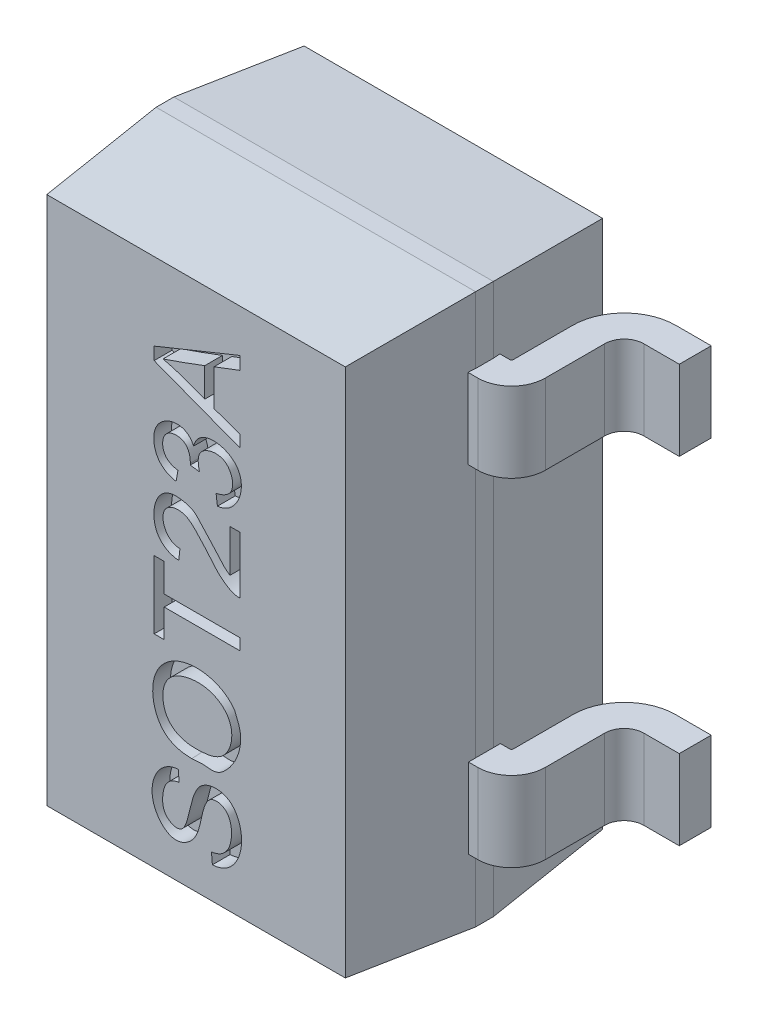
ISO-10303-21;
HEADER;
FILE_DESCRIPTION(('STEP AP214'),'2;1');
FILE_NAME('part.step','',(''),(''),'','','');
FILE_SCHEMA(('AUTOMOTIVE_DESIGN { 1 0 10303 214 1 1 1 1 }'));
ENDSEC;
DATA;
#1=APPLICATION_CONTEXT('core data for automotive mechanical design processes');
#2=APPLICATION_PROTOCOL_DEFINITION('international standard','automotive_design',2000,#1);
#3=PRODUCT_CONTEXT('',#1,'mechanical');
#4=PRODUCT('Part','Part','',(#3));
#5=PRODUCT_RELATED_PRODUCT_CATEGORY('part','',(#4));
#6=PRODUCT_DEFINITION_FORMATION('','',#4);
#7=PRODUCT_DEFINITION_CONTEXT('part definition',#1,'design');
#8=PRODUCT_DEFINITION('design','',#6,#7);
#9=PRODUCT_DEFINITION_SHAPE('','',#8);
#10=(LENGTH_UNIT() NAMED_UNIT(*) SI_UNIT(.MILLI.,.METRE.));
#11=(NAMED_UNIT(*) PLANE_ANGLE_UNIT() SI_UNIT($,.RADIAN.));
#12=(NAMED_UNIT(*) SI_UNIT($,.STERADIAN.) SOLID_ANGLE_UNIT());
#13=UNCERTAINTY_MEASURE_WITH_UNIT(LENGTH_MEASURE(1.E-05),#10,'distance_accuracy_value','');
#14=(GEOMETRIC_REPRESENTATION_CONTEXT(3) GLOBAL_UNCERTAINTY_ASSIGNED_CONTEXT((#13)) GLOBAL_UNIT_ASSIGNED_CONTEXT((#10,
#11,#12)) REPRESENTATION_CONTEXT('',''));
#15=CARTESIAN_POINT('',(0.,0.,0.));
#16=DIRECTION('',(0.,0.,1.));
#17=DIRECTION('',(1.,0.,0.));
#18=AXIS2_PLACEMENT_3D('',#15,#16,#17);
#19=CARTESIAN_POINT('',(0.,0.,1.45));
#20=DIRECTION('',(0.,0.,1.));
#21=DIRECTION('',(1.,0.,0.));
#22=AXIS2_PLACEMENT_3D('',#19,#20,#21);
#23=PLANE('',#22);
#24=CARTESIAN_POINT('',(0.04624730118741,-0.790970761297,1.45));
#25=CARTESIAN_POINT('',(-0.009678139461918,-0.79641221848,1.45));
#26=CARTESIAN_POINT('',(-0.107628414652,-0.781774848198,1.45));
#27=CARTESIAN_POINT('',(0.03088896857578,-0.802474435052,1.45));
#28=CARTESIAN_POINT('',(-0.107628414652,-0.781774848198,1.45));
#29=CARTESIAN_POINT('',(-0.194286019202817,-0.699431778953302,1.45));
#30=CARTESIAN_POINT('',(-0.196195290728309,-0.578832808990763,1.45));
#31=CARTESIAN_POINT('',(-0.154662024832,-0.528321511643,1.45));
#32=(BOUNDED_CURVE() B_SPLINE_CURVE(3,(#24,#25,#26,#27,#28,#29,#30,#31),.UNSPECIFIED.,.F.,
.F.) B_SPLINE_CURVE_WITH_KNOTS((4,1,1,1,1,4),(0.,0.173835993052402,0.296729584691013,
0.387610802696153,0.478492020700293,0.648364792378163),
.UNSPECIFIED.) CURVE() GEOMETRIC_REPRESENTATION_ITEM() RATIONAL_B_SPLINE_CURVE((1.,1.,1.,1.,1.,
1.,1.,1.)) REPRESENTATION_ITEM(''));
#33=CARTESIAN_POINT('',(0.0432551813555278,-0.79121067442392,1.44946028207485));
#34=VERTEX_POINT('',#33);
#35=CARTESIAN_POINT('',(-0.154662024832,-0.528321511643,1.45));
#36=VERTEX_POINT('',#35);
#37=EDGE_CURVE('E11',#34,#36,#32,.T.);
#38=ORIENTED_EDGE('',*,*,#37,.F.);
#39=CARTESIAN_POINT('',(-0.154662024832,-0.528321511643,1.45));
#40=CARTESIAN_POINT('',(-0.153693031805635,-0.527143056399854,1.45));
#41=CARTESIAN_POINT('',(-0.109177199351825,-0.47495992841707,1.45));
#42=CARTESIAN_POINT('',(0.072366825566,-0.435235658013,1.45));
#43=CARTESIAN_POINT('',(0.231493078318,-0.568885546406,1.45));
#44=CARTESIAN_POINT('',(0.179486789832,-0.760921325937,1.45));
#45=CARTESIAN_POINT('',(0.08578386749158,-0.787123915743,1.45));
#46=CARTESIAN_POINT('',(0.04624730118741,-0.790970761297,1.45));
#47=(BOUNDED_CURVE() B_SPLINE_CURVE(3,(#39,#40,#41,#42,#43,#44,#45,#46),.UNSPECIFIED.,.F.,
.F.) B_SPLINE_CURVE_WITH_KNOTS((4,1,1,1,1,4),(0.,0.00396322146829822,0.177799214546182,
0.351635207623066,0.52547120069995,0.648364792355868),
.UNSPECIFIED.) CURVE() GEOMETRIC_REPRESENTATION_ITEM() RATIONAL_B_SPLINE_CURVE((1.,1.,1.,1.,1.,
1.,1.,1.)) REPRESENTATION_ITEM(''));
#48=EDGE_CURVE('E788',#36,#34,#47,.T.);
#49=ORIENTED_EDGE('',*,*,#48,.F.);
#50=EDGE_LOOP('',(#38,#49));
#51=FACE_BOUND('',#50,.T.);
#52=ADVANCED_FACE('F17',(#51),#23,.T.);
#53=CARTESIAN_POINT('',(-0.178647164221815,-0.526315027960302,1.35));
#54=CARTESIAN_POINT('',(-0.180575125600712,-0.549361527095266,1.35));
#55=CARTESIAN_POINT('',(-0.182503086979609,-0.57240802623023,1.35));
#56=CARTESIAN_POINT('',(-0.184431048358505,-0.595454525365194,1.35));
#57=CARTESIAN_POINT('',(-0.186346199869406,-0.618347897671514,1.35));
#58=CARTESIAN_POINT('',(-0.189667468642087,-0.658049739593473,1.35));
#59=CARTESIAN_POINT('',(-0.154496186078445,-0.752881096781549,1.35));
#60=CARTESIAN_POINT('',(-0.0537931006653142,-0.7945985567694,1.35));
#61=CARTESIAN_POINT('',(-0.0240997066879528,-0.793047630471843,1.35));
#62=CARTESIAN_POINT('',(-0.0132292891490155,-0.792479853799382,1.35));
#63=CARTESIAN_POINT('',(0.00656850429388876,-0.791445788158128,1.35));
#64=CARTESIAN_POINT('',(0.0263662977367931,-0.790411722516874,1.35));
#65=CARTESIAN_POINT('',(0.0461640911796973,-0.789377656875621,1.35));
#66=CARTESIAN_POINT('',(-0.178647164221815,-0.526315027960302,1.39725489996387));
#67=CARTESIAN_POINT('',(-0.180575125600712,-0.549361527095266,1.40695661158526));
#68=CARTESIAN_POINT('',(-0.182503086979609,-0.57240802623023,1.41665832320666));
#69=CARTESIAN_POINT('',(-0.184431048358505,-0.595454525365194,1.42636003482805));
#70=CARTESIAN_POINT('',(-0.186346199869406,-0.618347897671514,1.43599728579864));
#71=CARTESIAN_POINT('',(-0.189667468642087,-0.658049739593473,1.45271027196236));
#72=CARTESIAN_POINT('',(-0.154496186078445,-0.752881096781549,1.44734687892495));
#73=CARTESIAN_POINT('',(-0.0537931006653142,-0.7945985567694,1.45964894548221));
#74=CARTESIAN_POINT('',(-0.0240997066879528,-0.793047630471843,1.43453997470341));
#75=CARTESIAN_POINT('',(-0.0132292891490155,-0.792479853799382,1.42534786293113));
#76=CARTESIAN_POINT('',(0.00656850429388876,-0.791445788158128,1.40860669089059));
#77=CARTESIAN_POINT('',(0.0263662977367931,-0.790411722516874,1.39186551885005));
#78=CARTESIAN_POINT('',(0.0461640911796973,-0.789377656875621,1.37512434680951));
#79=CARTESIAN_POINT('',(-0.178647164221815,-0.526315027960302,1.58214701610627));
#80=CARTESIAN_POINT('',(-0.180575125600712,-0.549361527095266,1.62980817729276));
#81=CARTESIAN_POINT('',(-0.182503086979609,-0.57240802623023,1.67746933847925));
#82=CARTESIAN_POINT('',(-0.184431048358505,-0.595454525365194,1.72513049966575));
#83=CARTESIAN_POINT('',(-0.186346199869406,-0.618347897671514,1.77247498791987));
#84=CARTESIAN_POINT('',(-0.189667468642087,-0.658049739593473,1.85458012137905));
#85=CARTESIAN_POINT('',(-0.154496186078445,-0.752881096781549,1.82823162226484));
#86=CARTESIAN_POINT('',(-0.0537931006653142,-0.7945985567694,1.8886674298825));
#87=CARTESIAN_POINT('',(-0.0240997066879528,-0.793047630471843,1.7653157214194));
#88=CARTESIAN_POINT('',(-0.0132292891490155,-0.792479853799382,1.72015804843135));
#89=CARTESIAN_POINT('',(0.00656850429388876,-0.791445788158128,1.63791444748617));
#90=CARTESIAN_POINT('',(0.0263662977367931,-0.790411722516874,1.555670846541));
#91=CARTESIAN_POINT('',(0.0461640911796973,-0.789377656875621,1.47342724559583));
#92=B_SPLINE_SURFACE_WITH_KNOTS('',1,3,((#53,#54,#55,#56,#57,#58,#59,#60,#61,#62,#63,#64,#65),
(#66,#67,#68,#69,#70,#71,#72,#73,#74,#75,#76,#77,#78),(#79,#80,#81,#82,#83,#84,#85,#86,#87,#88,
#89,#90,#91)),.UNSPECIFIED.,.F.,.F.,.F.,(2,1,2),(4,3,1,1,1,3,4),(0.,1.,4.91265490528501),
(-0.272809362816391,0.,0.270996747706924,0.469964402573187,0.805959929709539,1.,
1.3533962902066),.UNSPECIFIED.);
#93=CARTESIAN_POINT('',(-0.181550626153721,-0.56102248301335,1.35));
#94=CARTESIAN_POINT('',(-0.181550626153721,-0.561022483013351,1.35833333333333));
#95=CARTESIAN_POINT('',(-0.181550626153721,-0.561022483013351,1.36666666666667));
#96=CARTESIAN_POINT('',(-0.181550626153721,-0.561022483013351,1.3875));
#97=CARTESIAN_POINT('',(-0.181550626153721,-0.56102248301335,1.4));
#98=CARTESIAN_POINT('',(-0.181550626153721,-0.56102248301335,1.425));
#99=CARTESIAN_POINT('',(-0.181550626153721,-0.56102248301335,1.4375));
#100=CARTESIAN_POINT('',(-0.181550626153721,-0.561022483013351,1.44999999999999));
#101=B_SPLINE_CURVE_WITH_KNOTS('',3,(#93,#94,#95,#96,#97,#98,#99,#100),.UNSPECIFIED.,.F.,.F.,(4,
2,2,4),(0.,0.0249999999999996,0.0624999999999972,0.0999999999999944),.UNSPECIFIED.);
#102=CARTESIAN_POINT('',(-0.154662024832,-0.528321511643,1.35));
#103=VERTEX_POINT('',#102);
#104=EDGE_CURVE('E780',#103,#36,#101,.T.);
#105=CARTESIAN_POINT('',(0.0461640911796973,-0.789377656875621,1.35));
#106=CARTESIAN_POINT('',(0.0399120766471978,-0.789698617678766,1.35));
#107=CARTESIAN_POINT('',(0.0336602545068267,-0.790027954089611,1.35));
#108=CARTESIAN_POINT('',(0.0211568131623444,-0.790686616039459,1.35));
#109=CARTESIAN_POINT('',(0.0149051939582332,-0.791015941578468,1.35));
#110=CARTESIAN_POINT('',(0.00240116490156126,-0.791657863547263,1.35));
#111=CARTESIAN_POINT('',(-0.00385124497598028,-0.79197045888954,1.35));
#112=CARTESIAN_POINT('',(-0.0144217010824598,-0.792555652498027,1.35));
#113=CARTESIAN_POINT('',(-0.0187401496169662,-0.792810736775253,1.35));
#114=CARTESIAN_POINT('',(-0.0273737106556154,-0.792936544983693,1.35));
#115=CARTESIAN_POINT('',(-0.0316887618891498,-0.792808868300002,1.35));
#116=CARTESIAN_POINT('',(-0.043756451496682,-0.791709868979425,1.35));
#117=CARTESIAN_POINT('',(-0.0514519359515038,-0.790137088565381,1.35));
#118=CARTESIAN_POINT('',(-0.0650530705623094,-0.786477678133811,1.35));
#119=CARTESIAN_POINT('',(-0.0710103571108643,-0.784555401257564,1.35));
#120=CARTESIAN_POINT('',(-0.0827530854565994,-0.780239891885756,1.35));
#121=CARTESIAN_POINT('',(-0.0885385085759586,-0.777846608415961,1.35));
#122=CARTESIAN_POINT('',(-0.105583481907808,-0.76998642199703,1.35));
#123=CARTESIAN_POINT('',(-0.116549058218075,-0.763834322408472,1.35));
#124=CARTESIAN_POINT('',(-0.132907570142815,-0.752227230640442,1.35));
#125=CARTESIAN_POINT('',(-0.138785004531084,-0.747464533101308,1.35));
#126=CARTESIAN_POINT('',(-0.146924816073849,-0.739632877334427,1.35));
#127=CARTESIAN_POINT('',(-0.149521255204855,-0.736913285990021,1.35));
#128=CARTESIAN_POINT('',(-0.154426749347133,-0.731226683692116,1.35));
#129=CARTESIAN_POINT('',(-0.156735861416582,-0.728259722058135,1.35));
#130=CARTESIAN_POINT('',(-0.163226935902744,-0.719040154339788,1.35));
#131=CARTESIAN_POINT('',(-0.16696714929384,-0.712474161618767,1.35));
#132=CARTESIAN_POINT('',(-0.173395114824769,-0.698840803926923,1.35));
#133=CARTESIAN_POINT('',(-0.176079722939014,-0.691772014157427,1.35));
#134=CARTESIAN_POINT('',(-0.179801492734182,-0.679664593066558,1.35));
#135=CARTESIAN_POINT('',(-0.181090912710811,-0.674700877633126,1.35));
#136=CARTESIAN_POINT('',(-0.183254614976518,-0.66468469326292,1.35));
#137=CARTESIAN_POINT('',(-0.18412904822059,-0.659632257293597,1.35));
#138=CARTESIAN_POINT('',(-0.185442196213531,-0.649442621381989,1.35));
#139=CARTESIAN_POINT('',(-0.185878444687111,-0.644305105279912,1.35));
#140=CARTESIAN_POINT('',(-0.186341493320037,-0.634010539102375,1.35));
#141=CARTESIAN_POINT('',(-0.186368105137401,-0.628853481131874,1.35));
#142=CARTESIAN_POINT('',(-0.186019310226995,-0.615470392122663,1.35));
#143=CARTESIAN_POINT('',(-0.185393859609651,-0.607254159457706,1.35));
#144=CARTESIAN_POINT('',(-0.184066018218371,-0.590828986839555,1.35));
#145=CARTESIAN_POINT('',(-0.18336357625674,-0.582620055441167,1.35));
#146=CARTESIAN_POINT('',(-0.181993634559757,-0.566390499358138,1.35));
#147=CARTESIAN_POINT('',(-0.181325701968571,-0.558369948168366,1.35));
#148=CARTESIAN_POINT('',(-0.179990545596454,-0.542337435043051,1.35));
#149=CARTESIAN_POINT('',(-0.179323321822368,-0.534325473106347,1.35));
#150=CARTESIAN_POINT('',(-0.178647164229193,-0.526315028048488,1.35));
#151=B_SPLINE_CURVE_WITH_KNOTS('',3,(#105,#106,#107,#108,#109,#110,#111,#112,#113,#114,#115,
#116,#117,#118,#119,#120,#121,#122,#123,#124,#125,#126,#127,#128,#129,#130,#131,#132,#133,#134,
#135,#136,#137,#138,#139,#140,#141,#142,#143,#144,#145,#146,#147,#148,#149,#150),.UNSPECIFIED.,
.F.,.F.,(4,2,2,2,2,2,2,2,2,2,2,2,2,2,2,2,2,2,2,2,2,2,4),(0.,0.018781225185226,
0.0375618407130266,0.0563436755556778,0.0693187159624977,0.082239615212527,0.10566447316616,
0.124431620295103,0.14320079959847,0.180685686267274,0.20329426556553,0.214557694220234,
0.225818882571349,0.248363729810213,0.270975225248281,0.286344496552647,0.30170817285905,
0.317157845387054,0.33261462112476,0.357318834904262,0.382039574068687,0.406183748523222,
0.430302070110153),.UNSPECIFIED.);
#152=CARTESIAN_POINT('',(0.04624730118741,-0.790970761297,1.35));
#153=VERTEX_POINT('',#152);
#154=EDGE_CURVE('E784',#153,#103,#151,.T.);
#155=CARTESIAN_POINT('',(0.0461640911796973,-0.789377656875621,1.35));
#156=CARTESIAN_POINT('',(0.0457032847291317,-0.78940172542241,1.35403775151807));
#157=CARTESIAN_POINT('',(0.0452385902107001,-0.789425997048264,1.3580750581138));
#158=CARTESIAN_POINT('',(0.0442859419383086,-0.789475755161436,1.36628206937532));
#159=CARTESIAN_POINT('',(0.0437977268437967,-0.789501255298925,1.37045174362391));
#160=CARTESIAN_POINT('',(0.0427981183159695,-0.78955346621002,1.37891593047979));
#161=CARTESIAN_POINT('',(0.0422864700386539,-0.789580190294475,1.38321041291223));
#162=CARTESIAN_POINT('',(0.0412399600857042,-0.789634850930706,1.39191342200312));
#163=CARTESIAN_POINT('',(0.04070484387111,-0.789662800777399,1.39632191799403));
#164=CARTESIAN_POINT('',(0.0396994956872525,-0.789715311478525,1.40452095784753));
#165=CARTESIAN_POINT('',(0.039230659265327,-0.789739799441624,1.40831167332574));
#166=CARTESIAN_POINT('',(0.0382732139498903,-0.78978980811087,1.41598776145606));
#167=CARTESIAN_POINT('',(0.0377844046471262,-0.789815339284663,1.41987310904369));
#168=CARTESIAN_POINT('',(0.0367870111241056,-0.789867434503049,1.4277321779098));
#169=CARTESIAN_POINT('',(0.0362782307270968,-0.789894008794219,1.4317058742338));
#170=CARTESIAN_POINT('',(0.0352408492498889,-0.789948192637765,1.43973366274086));
#171=CARTESIAN_POINT('',(0.0347120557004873,-0.789975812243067,1.44378772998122));
#172=CARTESIAN_POINT('',(0.0341781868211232,-0.790003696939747,1.44784112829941));
#173=B_SPLINE_CURVE_WITH_KNOTS('',3,(#155,#156,#157,#158,#159,#160,#161,#162,#163,#164,#165,
#166,#167,#168,#169,#170,#171,#172),.UNSPECIFIED.,.F.,.F.,(4,2,2,2,2,2,2,2,4),(0.,
0.0121920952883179,0.0247867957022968,0.0377615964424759,0.0510844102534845,0.062543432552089,
0.0742915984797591,0.0863102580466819,0.098575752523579),.UNSPECIFIED.);
#174=EDGE_CURVE('E31',#153,#34,#173,.T.);
#175=ORIENTED_EDGE('',*,*,#104,.F.);
#176=ORIENTED_EDGE('',*,*,#154,.F.);
#177=ORIENTED_EDGE('',*,*,#174,.T.);
#178=ORIENTED_EDGE('',*,*,#37,.T.);
#179=EDGE_LOOP('',(#175,#176,#177,#178));
#180=FACE_BOUND('',#179,.T.);
#181=ADVANCED_FACE('F782',(#180),#92,.F.);
#182=CARTESIAN_POINT('',(0.04624730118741,-0.790970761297,1.35));
#183=CARTESIAN_POINT('',(0.04624730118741,-0.790970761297,1.45));
#184=CARTESIAN_POINT('',(0.08578386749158,-0.787123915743,1.35));
#185=CARTESIAN_POINT('',(0.08578386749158,-0.787123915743,1.45));
#186=CARTESIAN_POINT('',(0.179486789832,-0.760921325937,1.35));
#187=CARTESIAN_POINT('',(0.179486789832,-0.760921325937,1.45));
#188=CARTESIAN_POINT('',(0.231493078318,-0.568885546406,1.35));
#189=CARTESIAN_POINT('',(0.231493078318,-0.568885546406,1.45));
#190=CARTESIAN_POINT('',(0.072366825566,-0.435235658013,1.35));
#191=CARTESIAN_POINT('',(0.072366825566,-0.435235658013,1.45));
#192=CARTESIAN_POINT('',(-0.109177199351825,-0.47495992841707,1.35));
#193=CARTESIAN_POINT('',(-0.109177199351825,-0.47495992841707,1.45));
#194=CARTESIAN_POINT('',(-0.153693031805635,-0.527143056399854,1.35));
#195=CARTESIAN_POINT('',(-0.153693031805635,-0.527143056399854,1.45));
#196=CARTESIAN_POINT('',(-0.154662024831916,-0.528321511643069,1.35));
#197=CARTESIAN_POINT('',(-0.154662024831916,-0.528321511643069,1.45));
#198=CARTESIAN_POINT('',(-0.163624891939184,-0.539221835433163,1.35));
#199=CARTESIAN_POINT('',(-0.163624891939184,-0.539221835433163,1.45));
#200=CARTESIAN_POINT('',(-0.172587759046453,-0.550122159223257,1.35));
#201=CARTESIAN_POINT('',(-0.172587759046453,-0.550122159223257,1.45));
#202=CARTESIAN_POINT('',(-0.181550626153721,-0.56102248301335,1.35));
#203=CARTESIAN_POINT('',(-0.181550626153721,-0.56102248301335,1.45));
#204=B_SPLINE_SURFACE_WITH_KNOTS('',3,1,((#182,#183),(#184,#185),(#186,#187),(#188,#189),(#190,
#191),(#192,#193),(#194,#195),(#196,#197),(#198,#199),(#200,#201),(#202,#203)),.UNSPECIFIED.,
.F.,.F.,.F.,(4,1,1,1,1,3,4),(2,2),(0.,0.122893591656,0.296729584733,0.47056557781,
0.644401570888,0.648364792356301,0.685023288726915),(0.,1.),.UNSPECIFIED.);
#205=CARTESIAN_POINT('',(-0.154662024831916,-0.528321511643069,1.35));
#206=CARTESIAN_POINT('',(-0.152012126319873,-0.525094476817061,1.35));
#207=CARTESIAN_POINT('',(-0.149197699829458,-0.522007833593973,1.35));
#208=CARTESIAN_POINT('',(-0.143291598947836,-0.51611256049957,1.35));
#209=CARTESIAN_POINT('',(-0.140199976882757,-0.513303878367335,1.35));
#210=CARTESIAN_POINT('',(-0.133790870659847,-0.50796105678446,1.35));
#211=CARTESIAN_POINT('',(-0.130473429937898,-0.505426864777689,1.35));
#212=CARTESIAN_POINT('',(-0.123655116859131,-0.500621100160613,1.35));
#213=CARTESIAN_POINT('',(-0.120154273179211,-0.498349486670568,1.35));
#214=CARTESIAN_POINT('',(-0.113004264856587,-0.494055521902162,1.35));
#215=CARTESIAN_POINT('',(-0.109355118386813,-0.492033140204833,1.35));
#216=CARTESIAN_POINT('',(-0.101936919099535,-0.488223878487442,1.35));
#217=CARTESIAN_POINT('',(-0.0981678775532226,-0.486436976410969,1.35));
#218=CARTESIAN_POINT('',(-0.0905326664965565,-0.48308582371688,1.35));
#219=CARTESIAN_POINT('',(-0.0866665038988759,-0.481521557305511,1.35));
#220=CARTESIAN_POINT('',(-0.0788561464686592,-0.478604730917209,1.35));
#221=CARTESIAN_POINT('',(-0.074911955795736,-0.477252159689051,1.35));
#222=CARTESIAN_POINT('',(-0.0629751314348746,-0.473494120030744,1.35));
#223=CARTESIAN_POINT('',(-0.0548848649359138,-0.471391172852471,1.35));
#224=CARTESIAN_POINT('',(-0.042640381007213,-0.468806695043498,1.35));
#225=CARTESIAN_POINT('',(-0.038542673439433,-0.468040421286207,1.35));
#226=CARTESIAN_POINT('',(-0.0303163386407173,-0.4666935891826,1.35));
#227=CARTESIAN_POINT('',(-0.0261877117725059,-0.466113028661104,1.35));
#228=CARTESIAN_POINT('',(-0.0179089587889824,-0.465136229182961,1.35));
#229=CARTESIAN_POINT('',(-0.0137588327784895,-0.464739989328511,1.35));
#230=CARTESIAN_POINT('',(-0.00544483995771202,-0.464132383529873,1.35));
#231=CARTESIAN_POINT('',(-0.00128097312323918,-0.463921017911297,1.35));
#232=CARTESIAN_POINT('',(0.00705153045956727,-0.463686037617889,1.35));
#233=CARTESIAN_POINT('',(0.0112201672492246,-0.463662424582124,1.35));
#234=CARTESIAN_POINT('',(0.0237318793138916,-0.46388028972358,1.35));
#235=CARTESIAN_POINT('',(0.0320734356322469,-0.464411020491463,1.35));
#236=CARTESIAN_POINT('',(0.0445055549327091,-0.465838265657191,1.35));
#237=CARTESIAN_POINT('',(0.0486345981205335,-0.466418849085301,1.35));
#238=CARTESIAN_POINT('',(0.0568555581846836,-0.467805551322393,1.35));
#239=CARTESIAN_POINT('',(0.0609474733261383,-0.468611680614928,1.35));
#240=CARTESIAN_POINT('',(0.0690789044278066,-0.470455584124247,1.35));
#241=CARTESIAN_POINT('',(0.0731184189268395,-0.471493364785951,1.35));
#242=CARTESIAN_POINT('',(0.0811296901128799,-0.473804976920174,1.35));
#243=CARTESIAN_POINT('',(0.0851014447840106,-0.475078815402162,1.35));
#244=CARTESIAN_POINT('',(0.0929601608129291,-0.477866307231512,1.35));
#245=CARTESIAN_POINT('',(0.0968471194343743,-0.479379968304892,1.35));
#246=CARTESIAN_POINT('',(0.104518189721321,-0.48264995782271,1.35));
#247=CARTESIAN_POINT('',(0.108302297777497,-0.484406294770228,1.35));
#248=CARTESIAN_POINT('',(0.11574716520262,-0.488162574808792,1.35));
#249=CARTESIAN_POINT('',(0.119407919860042,-0.490162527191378,1.35));
#250=CARTESIAN_POINT('',(0.130191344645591,-0.496538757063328,1.35));
#251=CARTESIAN_POINT('',(0.137100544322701,-0.501285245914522,1.35));
#252=CARTESIAN_POINT('',(0.150158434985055,-0.511743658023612,1.35));
#253=CARTESIAN_POINT('',(0.156306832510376,-0.51745595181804,1.35));
#254=CARTESIAN_POINT('',(0.164790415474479,-0.52667884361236,1.35));
#255=CARTESIAN_POINT('',(0.167492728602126,-0.529858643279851,1.35));
#256=CARTESIAN_POINT('',(0.175181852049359,-0.539690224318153,1.35));
#257=CARTESIAN_POINT('',(0.179776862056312,-0.546658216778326,1.35));
#258=CARTESIAN_POINT('',(0.187550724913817,-0.560964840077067,1.35));
#259=CARTESIAN_POINT('',(0.190781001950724,-0.568275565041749,1.35));
#260=CARTESIAN_POINT('',(0.195956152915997,-0.583338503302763,1.35));
#261=CARTESIAN_POINT('',(0.197900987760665,-0.591090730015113,1.35));
#262=CARTESIAN_POINT('',(0.200570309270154,-0.606788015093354,1.35));
#263=CARTESIAN_POINT('',(0.201295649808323,-0.614732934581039,1.35));
#264=CARTESIAN_POINT('',(0.201651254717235,-0.630639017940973,1.35));
#265=CARTESIAN_POINT('',(0.201282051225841,-0.638600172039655,1.35));
#266=CARTESIAN_POINT('',(0.199527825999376,-0.654404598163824,1.35));
#267=CARTESIAN_POINT('',(0.19814304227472,-0.662247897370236,1.35));
#268=CARTESIAN_POINT('',(0.193889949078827,-0.679819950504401,1.35));
#269=CARTESIAN_POINT('',(0.190719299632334,-0.689477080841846,1.35));
#270=CARTESIAN_POINT('',(0.182790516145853,-0.708138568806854,1.35));
#271=CARTESIAN_POINT('',(0.178031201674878,-0.717142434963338,1.35));
#272=CARTESIAN_POINT('',(0.168337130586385,-0.731814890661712,1.35));
#273=CARTESIAN_POINT('',(0.163784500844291,-0.73773427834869,1.35));
#274=CARTESIAN_POINT('',(0.153730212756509,-0.74868019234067,1.35));
#275=CARTESIAN_POINT('',(0.148232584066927,-0.753710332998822,1.35));
#276=CARTESIAN_POINT('',(0.139428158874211,-0.760415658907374,1.35));
#277=CARTESIAN_POINT('',(0.136423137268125,-0.762499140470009,1.35));
#278=CARTESIAN_POINT('',(0.130253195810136,-0.766414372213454,1.35));
#279=CARTESIAN_POINT('',(0.127088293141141,-0.768246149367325,1.35));
#280=CARTESIAN_POINT('',(0.120629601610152,-0.771662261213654,1.35));
#281=CARTESIAN_POINT('',(0.11733582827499,-0.773246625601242,1.35));
#282=CARTESIAN_POINT('',(0.10728970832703,-0.777655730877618,1.35));
#283=CARTESIAN_POINT('',(0.100381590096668,-0.780130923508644,1.35));
#284=CARTESIAN_POINT('',(0.0898622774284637,-0.783245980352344,1.35));
#285=CARTESIAN_POINT('',(0.0863328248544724,-0.784184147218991,1.35));
#286=CARTESIAN_POINT('',(0.0767942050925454,-0.786467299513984,1.35));
#287=CARTESIAN_POINT('',(0.0707457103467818,-0.787649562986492,1.35));
#288=CARTESIAN_POINT('',(0.0585498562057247,-0.789602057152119,1.35));
#289=CARTESIAN_POINT('',(0.0524021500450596,-0.79037015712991,1.35));
#290=CARTESIAN_POINT('',(0.04624730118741,-0.790970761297,1.35));
#291=B_SPLINE_CURVE_WITH_KNOTS('',3,(#205,#206,#207,#208,#209,#210,#211,#212,#213,#214,#215,
#216,#217,#218,#219,#220,#221,#222,#223,#224,#225,#226,#227,#228,#229,#230,#231,#232,#233,#234,
#235,#236,#237,#238,#239,#240,#241,#242,#243,#244,#245,#246,#247,#248,#249,#250,#251,#252,#253,
#254,#255,#256,#257,#258,#259,#260,#261,#262,#263,#264,#265,#266,#267,#268,#269,#270,#271,#272,
#273,#274,#275,#276,#277,#278,#279,#280,#281,#282,#283,#284,#285,#286,#287,#288,#289,#290),
.UNSPECIFIED.,.F.,.F.,(4,2,2,2,2,2,2,2,2,2,2,2,2,2,2,2,2,2,2,2,2,2,2,2,2,2,2,2,2,2,2,2,2,2,2,2,
2,2,2,2,2,2,4),(0.,0.0125153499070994,0.025028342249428,0.0375389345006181,0.0500475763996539,
0.0625546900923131,0.0750606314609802,0.0875656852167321,0.100070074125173,0.125100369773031,
0.137603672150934,0.150106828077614,0.162609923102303,0.175113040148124,0.187616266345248,
0.212644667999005,0.225148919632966,0.237653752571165,0.250158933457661,0.26266448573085,
0.275170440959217,0.287676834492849,0.300183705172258,0.325244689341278,0.35031531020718,
0.362825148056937,0.38773975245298,0.411606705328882,0.43547438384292,0.45932534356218,
0.483164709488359,0.506998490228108,0.537356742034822,0.567737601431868,0.590051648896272,
0.612272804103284,0.62323199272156,0.634190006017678,0.645146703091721,0.667091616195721,
0.678044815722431,0.696515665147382,0.715080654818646),.UNSPECIFIED.);
#292=EDGE_CURVE('E789',#103,#153,#291,.T.);
#293=CARTESIAN_POINT('',(0.0424832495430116,-0.791336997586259,1.35));
#294=CARTESIAN_POINT('',(0.0424832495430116,-0.791336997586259,1.45));
#295=CARTESIAN_POINT('',(0.0437379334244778,-0.791214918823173,1.35));
#296=CARTESIAN_POINT('',(0.0437379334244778,-0.791214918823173,1.45));
#297=CARTESIAN_POINT('',(0.0449926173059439,-0.791092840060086,1.35));
#298=CARTESIAN_POINT('',(0.0449926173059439,-0.791092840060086,1.45));
#299=CARTESIAN_POINT('',(0.04624730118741,-0.790970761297,1.35));
#300=CARTESIAN_POINT('',(0.04624730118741,-0.790970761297,1.45));
#301=CARTESIAN_POINT('',(0.08578386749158,-0.787123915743,1.35));
#302=CARTESIAN_POINT('',(0.08578386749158,-0.787123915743,1.45));
#303=CARTESIAN_POINT('',(0.179486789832,-0.760921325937,1.35));
#304=CARTESIAN_POINT('',(0.179486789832,-0.760921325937,1.45));
#305=CARTESIAN_POINT('',(0.231493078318,-0.568885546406,1.35));
#306=CARTESIAN_POINT('',(0.231493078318,-0.568885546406,1.45));
#307=CARTESIAN_POINT('',(0.072366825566,-0.435235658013,1.35));
#308=CARTESIAN_POINT('',(0.072366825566,-0.435235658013,1.45));
#309=CARTESIAN_POINT('',(-0.109177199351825,-0.47495992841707,1.35));
#310=CARTESIAN_POINT('',(-0.109177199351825,-0.47495992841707,1.45));
#311=CARTESIAN_POINT('',(-0.153693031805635,-0.527143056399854,1.35));
#312=CARTESIAN_POINT('',(-0.153693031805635,-0.527143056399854,1.45));
#313=CARTESIAN_POINT('',(-0.154662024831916,-0.528321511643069,1.35));
#314=CARTESIAN_POINT('',(-0.154662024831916,-0.528321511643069,1.45));
#315=CARTESIAN_POINT('',(-0.163624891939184,-0.539221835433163,1.35));
#316=CARTESIAN_POINT('',(-0.163624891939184,-0.539221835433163,1.45));
#317=CARTESIAN_POINT('',(-0.172587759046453,-0.550122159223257,1.35));
#318=CARTESIAN_POINT('',(-0.172587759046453,-0.550122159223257,1.45));
#319=CARTESIAN_POINT('',(-0.181550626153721,-0.56102248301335,1.35));
#320=CARTESIAN_POINT('',(-0.181550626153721,-0.56102248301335,1.45));
#321=B_SPLINE_SURFACE_WITH_KNOTS('',3,1,((#293,#294),(#295,#296),(#297,#298),(#299,#300),(#301,
#302),(#303,#304),(#305,#306),(#307,#308),(#309,#310),(#311,#312),(#313,#314),(#315,#316),(#317,
#318),(#319,#320)),.UNSPECIFIED.,.F.,.F.,.F.,(4,3,1,1,1,1,3,4),(2,2),(-0.0039,0.,0.122893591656,
0.296729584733,0.47056557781,0.644401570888,0.648364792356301,0.685023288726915),(0.,1.),.UNSPECIFIED.);
#322=ORIENTED_EDGE('',*,*,#292,.F.);
#323=ORIENTED_EDGE('',*,*,#104,.T.);
#324=ORIENTED_EDGE('',*,*,#48,.T.);
#325=ORIENTED_EDGE('',*,*,#174,.F.);
#326=EDGE_LOOP('',(#322,#323,#324,#325));
#327=FACE_BOUND('',#326,.T.);
#328=ADVANCED_FACE('F792',(#327),#321,.T.);
#329=CARTESIAN_POINT('',(0.002838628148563,-0.397934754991,1.35));
#330=DIRECTION('',(0.,0.,1.));
#331=DIRECTION('',(1.,0.,0.));
#332=AXIS2_PLACEMENT_3D('',#329,#330,#331);
#333=PLANE('',#332);
#334=ORIENTED_EDGE('',*,*,#154,.T.);
#335=ORIENTED_EDGE('',*,*,#292,.T.);
#336=EDGE_LOOP('',(#334,#335));
#337=FACE_BOUND('',#336,.T.);
#338=CARTESIAN_POINT('',(-0.02989341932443,-0.85380070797,1.35));
#339=CARTESIAN_POINT('',(-0.0893476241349,-0.850930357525,1.35));
#340=CARTESIAN_POINT('',(-0.229085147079,-0.814676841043,1.35));
#341=CARTESIAN_POINT('',(-0.275027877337,-0.558408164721,1.35));
#342=CARTESIAN_POINT('',(-0.07546064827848,-0.357089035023,1.35));
#343=CARTESIAN_POINT('',(0.151073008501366,-0.396755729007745,1.35));
#344=CARTESIAN_POINT('',(0.217446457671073,-0.496909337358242,1.35));
#345=CARTESIAN_POINT('',(0.217934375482,-0.497657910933,1.35));
#346=(BOUNDED_CURVE() B_SPLINE_CURVE(3,(#338,#339,#340,#341,#342,#343,#344,#345),.UNSPECIFIED.,
.F.,.F.) B_SPLINE_CURVE_WITH_KNOTS((4,1,1,1,1,4),(0.,0.126774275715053,0.326573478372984,
0.412842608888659,0.661424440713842,0.663286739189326),
.UNSPECIFIED.) CURVE() GEOMETRIC_REPRESENTATION_ITEM() RATIONAL_B_SPLINE_CURVE((1.,1.,1.,1.,1.,
1.,1.,1.)) REPRESENTATION_ITEM(''));
#347=CARTESIAN_POINT('',(-0.02989341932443,-0.85380070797,1.35));
#348=VERTEX_POINT('',#347);
#349=CARTESIAN_POINT('',(0.217934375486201,-0.497657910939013,1.35));
#350=VERTEX_POINT('',#349);
#351=EDGE_CURVE('E1131',#348,#350,#346,.T.);
#352=ORIENTED_EDGE('',*,*,#351,.F.);
#353=CARTESIAN_POINT('',(0.217934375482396,-0.497657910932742,1.35));
#354=CARTESIAN_POINT('',(0.22436687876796,-0.512172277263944,1.35));
#355=CARTESIAN_POINT('',(0.230940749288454,-0.526986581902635,1.35));
#356=CARTESIAN_POINT('',(0.242071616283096,-0.557207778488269,1.35));
#357=CARTESIAN_POINT('',(0.246640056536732,-0.572610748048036,1.35));
#358=CARTESIAN_POINT('',(0.251139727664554,-0.601314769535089,1.35));
#359=CARTESIAN_POINT('',(0.251760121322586,-0.614492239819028,1.35));
#360=CARTESIAN_POINT('',(0.250733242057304,-0.64069909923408,1.35));
#361=CARTESIAN_POINT('',(0.249085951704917,-0.653728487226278,1.35));
#362=CARTESIAN_POINT('',(0.244000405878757,-0.679300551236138,1.35));
#363=CARTESIAN_POINT('',(0.24057942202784,-0.691846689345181,1.35));
#364=CARTESIAN_POINT('',(0.232047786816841,-0.716349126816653,1.35));
#365=CARTESIAN_POINT('',(0.226937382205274,-0.728305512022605,1.35));
#366=CARTESIAN_POINT('',(0.213852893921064,-0.753780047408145,1.35));
#367=CARTESIAN_POINT('',(0.205504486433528,-0.767106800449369,1.35));
#368=CARTESIAN_POINT('',(0.191629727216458,-0.786121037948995,1.35));
#369=CARTESIAN_POINT('',(0.186763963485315,-0.792312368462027,1.35));
#370=CARTESIAN_POINT('',(0.176579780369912,-0.804308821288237,1.35));
#371=CARTESIAN_POINT('',(0.171261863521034,-0.810114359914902,1.35));
#372=CARTESIAN_POINT('',(0.160540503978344,-0.820733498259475,1.35));
#373=CARTESIAN_POINT('',(0.155178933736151,-0.825589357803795,1.35));
#374=CARTESIAN_POINT('',(0.143923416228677,-0.834565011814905,1.35));
#375=CARTESIAN_POINT('',(0.138035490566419,-0.838691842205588,1.35));
#376=CARTESIAN_POINT('',(0.127241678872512,-0.844555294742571,1.35));
#377=CARTESIAN_POINT('',(0.12253137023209,-0.846637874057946,1.35));
#378=CARTESIAN_POINT('',(0.112790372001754,-0.84987320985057,1.35));
#379=CARTESIAN_POINT('',(0.107759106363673,-0.851024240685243,1.35));
#380=CARTESIAN_POINT('',(0.0947686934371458,-0.852857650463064,1.35));
#381=CARTESIAN_POINT('',(0.086733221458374,-0.852926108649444,1.35));
#382=CARTESIAN_POINT('',(0.074733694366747,-0.852302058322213,1.35));
#383=CARTESIAN_POINT('',(0.0707243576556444,-0.851969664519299,1.35));
#384=CARTESIAN_POINT('',(0.0627096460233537,-0.851258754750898,1.35));
#385=CARTESIAN_POINT('',(0.0587042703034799,-0.850880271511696,1.35));
#386=CARTESIAN_POINT('',(0.0465777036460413,-0.849744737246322,1.35));
#387=CARTESIAN_POINT('',(0.038456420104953,-0.848998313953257,1.35));
#388=CARTESIAN_POINT('',(0.0222407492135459,-0.84750036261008,1.35));
#389=CARTESIAN_POINT('',(0.0141463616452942,-0.846748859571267,1.35));
#390=CARTESIAN_POINT('',(0.00019909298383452,-0.845455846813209,1.35));
#391=CARTESIAN_POINT('',(-0.00565378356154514,-0.84491381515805,1.35));
#392=CARTESIAN_POINT('',(-0.017294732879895,-0.84383574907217,1.35));
#393=CARTESIAN_POINT('',(-0.0230828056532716,-0.843299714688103,1.35));
#394=CARTESIAN_POINT('',(-0.02887087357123,-0.842763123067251,1.35));
#395=B_SPLINE_CURVE_WITH_KNOTS('',3,(#353,#354,#355,#356,#357,#358,#359,#360,#361,#362,#363,
#364,#365,#366,#367,#368,#369,#370,#371,#372,#373,#374,#375,#376,#377,#378,#379,#380,#381,#382,
#383,#384,#385,#386,#387,#388,#389,#390,#391,#392,#393,#394),.UNSPECIFIED.,.F.,.F.,(4,2,2,2,2,2,
2,2,2,2,2,2,2,2,2,2,2,2,2,2,4),(0.,0.0482105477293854,0.0961422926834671,0.135406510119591,
0.17467102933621,0.213560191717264,0.252443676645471,0.299403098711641,0.323014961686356,
0.346600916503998,0.368275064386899,0.389727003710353,0.405090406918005,0.420482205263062,
0.444410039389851,0.456486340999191,0.468554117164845,0.493022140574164,0.517409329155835,
0.535043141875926,0.552481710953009),.UNSPECIFIED.);
#396=EDGE_CURVE('E76',#350,#348,#395,.T.);
#397=ORIENTED_EDGE('',*,*,#396,.F.);
#398=EDGE_LOOP('',(#352,#397));
#399=FACE_BOUND('',#398,.T.);
#400=ADVANCED_FACE('F797',(#337,#399),#333,.T.);
#401=CARTESIAN_POINT('',(0.,0.,1.45));
#402=DIRECTION('',(0.,0.,1.));
#403=DIRECTION('',(1.,0.,0.));
#404=AXIS2_PLACEMENT_3D('',#401,#402,#403);
#405=PLANE('',#404);
#406=CARTESIAN_POINT('',(-0.186163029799,1.016390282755,1.45));
#407=CARTESIAN_POINT('',(-0.123740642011,1.035944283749,1.45));
#408=CARTESIAN_POINT('',(-0.02913335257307,1.072188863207,1.45));
#409=CARTESIAN_POINT('',(0.04901738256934,1.101119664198,1.45));
#410=B_SPLINE_CURVE_WITH_KNOTS('',3,(#406,#407,#408,#409),.UNSPECIFIED.,.F.,.F.,(4,4),(0.,1.),.UNSPECIFIED.);
#411=CARTESIAN_POINT('',(-0.186163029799,1.016390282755,1.45));
#412=VERTEX_POINT('',#411);
#413=CARTESIAN_POINT('',(0.04901738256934,1.101119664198,1.45));
#414=VERTEX_POINT('',#413);
#415=EDGE_CURVE('E1063',#412,#414,#410,.T.);
#416=ORIENTED_EDGE('',*,*,#415,.F.);
#417=CARTESIAN_POINT('',(0.04901738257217,0.937459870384,1.45));
#418=CARTESIAN_POINT('',(-0.02856895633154,0.966312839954,1.45));
#419=CARTESIAN_POINT('',(-0.105126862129,0.999025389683,1.45));
#420=CARTESIAN_POINT('',(-0.186163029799,1.016390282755,1.45));
#421=B_SPLINE_CURVE_WITH_KNOTS('',3,(#417,#418,#419,#420),.UNSPECIFIED.,.F.,.F.,(4,4),(0.,1.),.UNSPECIFIED.);
#422=CARTESIAN_POINT('',(0.04901738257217,0.937459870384,1.45));
#423=VERTEX_POINT('',#422);
#424=EDGE_CURVE('E799',#423,#412,#421,.T.);
#425=ORIENTED_EDGE('',*,*,#424,.F.);
#426=DIRECTION('',(0.,-1.,0.));
#427=VECTOR('',#426,1.);
#428=CARTESIAN_POINT('',(0.04901738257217,0.937459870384,1.45));
#429=LINE('',#428,#427);
#430=EDGE_CURVE('E1577',#414,#423,#429,.T.);
#431=ORIENTED_EDGE('',*,*,#430,.F.);
#432=EDGE_LOOP('',(#416,#425,#431));
#433=FACE_BOUND('',#432,.T.);
#434=ADVANCED_FACE('F1240',(#433),#405,.T.);
#435=CARTESIAN_POINT('',(-0.186163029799,1.016390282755,1.35));
#436=CARTESIAN_POINT('',(-0.186163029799,1.016390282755,1.45));
#437=CARTESIAN_POINT('',(-0.105126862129,0.999025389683,1.35));
#438=CARTESIAN_POINT('',(-0.105126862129,0.999025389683,1.45));
#439=CARTESIAN_POINT('',(-0.02856895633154,0.966312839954,1.35));
#440=CARTESIAN_POINT('',(-0.02856895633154,0.966312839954,1.45));
#441=CARTESIAN_POINT('',(0.04901738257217,0.937459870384,1.35));
#442=CARTESIAN_POINT('',(0.04901738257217,0.937459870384,1.45));
#443=B_SPLINE_SURFACE_WITH_KNOTS('',3,1,((#435,#436),(#437,#438),(#439,#440),(#441,#442)),
.UNSPECIFIED.,.F.,.F.,.F.,(4,4),(2,2),(0.,1.),(0.,1.),.UNSPECIFIED.);
#444=CARTESIAN_POINT('',(0.04901738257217,0.937459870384,1.35));
#445=CARTESIAN_POINT('',(-0.0285689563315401,0.966312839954,1.35));
#446=CARTESIAN_POINT('',(-0.105126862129,0.999025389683,1.35));
#447=CARTESIAN_POINT('',(-0.186163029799,1.016390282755,1.35));
#448=B_SPLINE_CURVE_WITH_KNOTS('',3,(#444,#445,#446,#447),.UNSPECIFIED.,.F.,.F.,(4,4),(0.,1.),.UNSPECIFIED.);
#449=CARTESIAN_POINT('',(0.04901738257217,0.937459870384,1.35));
#450=VERTEX_POINT('',#449);
#451=CARTESIAN_POINT('',(-0.186163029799,1.016390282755,1.35));
#452=VERTEX_POINT('',#451);
#453=EDGE_CURVE('E1043',#450,#452,#448,.T.);
#454=DIRECTION('',(0.,0.,1.));
#455=VECTOR('',#454,1.);
#456=CARTESIAN_POINT('',(0.04901738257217,0.937459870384,1.4));
#457=LINE('',#456,#455);
#458=EDGE_CURVE('E805',#450,#423,#457,.T.);
#459=DIRECTION('',(0.,0.,-1.));
#460=VECTOR('',#459,1.);
#461=CARTESIAN_POINT('',(-0.186163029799,1.016390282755,1.4));
#462=LINE('',#461,#460);
#463=EDGE_CURVE('E1062',#412,#452,#462,.T.);
#464=ORIENTED_EDGE('',*,*,#453,.F.);
#465=ORIENTED_EDGE('',*,*,#458,.T.);
#466=ORIENTED_EDGE('',*,*,#424,.T.);
#467=ORIENTED_EDGE('',*,*,#463,.T.);
#468=EDGE_LOOP('',(#464,#465,#466,#467));
#469=FACE_BOUND('',#468,.T.);
#470=ADVANCED_FACE('F1243',(#469),#443,.T.);
#471=CARTESIAN_POINT('',(0.04901738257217,0.937459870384,1.35));
#472=DIRECTION('',(1.,0.,0.));
#473=DIRECTION('',(0.,1.,0.));
#474=AXIS2_PLACEMENT_3D('',#471,#472,#473);
#475=PLANE('',#474);
#476=DIRECTION('',(0.,-1.,0.));
#477=VECTOR('',#476,1.);
#478=CARTESIAN_POINT('',(0.04901738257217,0.832273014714,1.35));
#479=LINE('',#478,#477);
#480=CARTESIAN_POINT('',(0.04901738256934,1.101119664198,1.35));
#481=VERTEX_POINT('',#480);
#482=EDGE_CURVE('E1053',#481,#450,#479,.T.);
#483=ORIENTED_EDGE('',*,*,#482,.F.);
#484=DIRECTION('',(0.,0.,1.));
#485=VECTOR('',#484,1.);
#486=CARTESIAN_POINT('',(0.04901738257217,1.101119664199,1.35));
#487=LINE('',#486,#485);
#488=EDGE_CURVE('E1071',#481,#414,#487,.T.);
#489=ORIENTED_EDGE('',*,*,#488,.T.);
#490=ORIENTED_EDGE('',*,*,#430,.T.);
#491=ORIENTED_EDGE('',*,*,#458,.F.);
#492=EDGE_LOOP('',(#483,#489,#490,#491));
#493=FACE_BOUND('',#492,.T.);
#494=ADVANCED_FACE('F1395',(#493),#475,.T.);
#495=CARTESIAN_POINT('',(0.04901738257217,1.101119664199,1.35));
#496=CARTESIAN_POINT('',(0.04901738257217,1.101119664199,1.45));
#497=CARTESIAN_POINT('',(-0.02913335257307,1.072188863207,1.35));
#498=CARTESIAN_POINT('',(-0.02913335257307,1.072188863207,1.45));
#499=CARTESIAN_POINT('',(-0.123740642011,1.035944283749,1.35));
#500=CARTESIAN_POINT('',(-0.123740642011,1.035944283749,1.45));
#501=CARTESIAN_POINT('',(-0.186163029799,1.016390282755,1.35));
#502=CARTESIAN_POINT('',(-0.186163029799,1.016390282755,1.45));
#503=B_SPLINE_SURFACE_WITH_KNOTS('',3,1,((#495,#496),(#497,#498),(#499,#500),(#501,#502)),
.UNSPECIFIED.,.F.,.F.,.F.,(4,4),(2,2),(0.,1.),(0.,1.),.UNSPECIFIED.);
#504=CARTESIAN_POINT('',(-0.186163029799,1.016390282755,1.35));
#505=CARTESIAN_POINT('',(-0.123740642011,1.035944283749,1.35));
#506=CARTESIAN_POINT('',(-0.02913335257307,1.072188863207,1.35));
#507=CARTESIAN_POINT('',(0.04901738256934,1.101119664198,1.35));
#508=B_SPLINE_CURVE_WITH_KNOTS('',3,(#504,#505,#506,#507),.UNSPECIFIED.,.F.,.F.,(4,4),(0.,1.),.UNSPECIFIED.);
#509=EDGE_CURVE('E1052',#452,#481,#508,.T.);
#510=ORIENTED_EDGE('',*,*,#509,.F.);
#511=ORIENTED_EDGE('',*,*,#463,.F.);
#512=ORIENTED_EDGE('',*,*,#415,.T.);
#513=ORIENTED_EDGE('',*,*,#488,.F.);
#514=EDGE_LOOP('',(#510,#511,#512,#513));
#515=FACE_BOUND('',#514,.T.);
#516=ADVANCED_FACE('F1398',(#515),#503,.T.);
#517=CARTESIAN_POINT('',(0.247793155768,0.832273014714,1.35));
#518=DIRECTION('',(0.,0.,1.));
#519=DIRECTION('',(1.,0.,0.));
#520=AXIS2_PLACEMENT_3D('',#517,#518,#519);
#521=PLANE('',#520);
#522=ORIENTED_EDGE('',*,*,#482,.T.);
#523=ORIENTED_EDGE('',*,*,#453,.T.);
#524=ORIENTED_EDGE('',*,*,#509,.T.);
#525=EDGE_LOOP('',(#522,#523,#524));
#526=FACE_BOUND('',#525,.T.);
#527=DIRECTION('',(0.,1.,0.));
#528=VECTOR('',#527,1.);
#529=CARTESIAN_POINT('',(-0.236098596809,0.983207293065,1.35));
#530=LINE('',#529,#528);
#531=CARTESIAN_POINT('',(-0.236098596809,0.983207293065,1.35));
#532=VERTEX_POINT('',#531);
#533=CARTESIAN_POINT('',(-0.236098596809,1.054083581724,1.35));
#534=VERTEX_POINT('',#533);
#535=EDGE_CURVE('E1526',#532,#534,#530,.T.);
#536=ORIENTED_EDGE('',*,*,#535,.F.);
#537=DIRECTION('',(-0.934320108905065,0.356435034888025,0.));
#538=VECTOR('',#537,1.);
#539=CARTESIAN_POINT('',(0.247793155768,0.798606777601,1.35));
#540=LINE('',#539,#538);
#541=CARTESIAN_POINT('',(0.247793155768,0.798606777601,1.35));
#542=VERTEX_POINT('',#541);
#543=EDGE_CURVE('E1528',#542,#532,#540,.T.);
#544=ORIENTED_EDGE('',*,*,#543,.F.);
#545=DIRECTION('',(0.,-1.,0.));
#546=VECTOR('',#545,1.);
#547=CARTESIAN_POINT('',(0.247793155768,0.865939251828,1.35));
#548=LINE('',#547,#546);
#549=CARTESIAN_POINT('',(0.247793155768,0.865939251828,1.35));
#550=VERTEX_POINT('',#549);
#551=EDGE_CURVE('E1551',#550,#542,#548,.T.);
#552=ORIENTED_EDGE('',*,*,#551,.F.);
#553=DIRECTION('',(0.942722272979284,-0.333578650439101,0.));
#554=VECTOR('',#553,1.);
#555=CARTESIAN_POINT('',(0.101208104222,0.917807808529,1.35));
#556=LINE('',#555,#554);
#557=CARTESIAN_POINT('',(0.101208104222,0.917807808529,1.35));
#558=VERTEX_POINT('',#557);
#559=EDGE_CURVE('E1558',#558,#550,#556,.T.);
#560=ORIENTED_EDGE('',*,*,#559,.F.);
#561=DIRECTION('',(0.,-1.,0.));
#562=VECTOR('',#561,1.);
#563=CARTESIAN_POINT('',(0.101208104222,1.1217382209,1.35));
#564=LINE('',#563,#562);
#565=CARTESIAN_POINT('',(0.101208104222,1.1217382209,1.35));
#566=VERTEX_POINT('',#565);
#567=EDGE_CURVE('E1559',#566,#558,#564,.T.);
#568=ORIENTED_EDGE('',*,*,#567,.F.);
#569=DIRECTION('',(-0.934715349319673,-0.355397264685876,0.));
#570=VECTOR('',#569,1.);
#571=CARTESIAN_POINT('',(0.247793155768,1.177472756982,1.35));
#572=LINE('',#571,#570);
#573=CARTESIAN_POINT('',(0.247793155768,1.177472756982,1.35));
#574=VERTEX_POINT('',#573);
#575=EDGE_CURVE('E1567',#574,#566,#572,.T.);
#576=ORIENTED_EDGE('',*,*,#575,.F.);
#577=DIRECTION('',(0.,-1.,0.));
#578=VECTOR('',#577,1.);
#579=CARTESIAN_POINT('',(0.247793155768,1.250282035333,1.35));
#580=LINE('',#579,#578);
#581=CARTESIAN_POINT('',(0.247793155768,1.250282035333,1.35));
#582=VERTEX_POINT('',#581);
#583=EDGE_CURVE('E1041',#582,#574,#580,.T.);
#584=ORIENTED_EDGE('',*,*,#583,.F.);
#585=DIRECTION('',(0.926721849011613,0.375748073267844,0.));
#586=VECTOR('',#585,1.);
#587=CARTESIAN_POINT('',(-0.236098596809,1.054083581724,1.35));
#588=LINE('',#587,#586);
#589=EDGE_CURVE('E1530',#534,#582,#588,.T.);
#590=ORIENTED_EDGE('',*,*,#589,.F.);
#591=EDGE_LOOP('',(#536,#544,#552,#560,#568,#576,#584,#590));
#592=FACE_BOUND('',#591,.T.);
#593=ADVANCED_FACE('F1510',(#526,#592),#521,.T.);
#594=CARTESIAN_POINT('',(0.247793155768,1.177472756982,1.35));
#595=DIRECTION('',(-0.355397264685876,0.934715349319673,0.));
#596=DIRECTION('',(0.,0.,1.));
#597=AXIS2_PLACEMENT_3D('',#594,#595,#596);
#598=PLANE('',#597);
#599=ORIENTED_EDGE('',*,*,#575,.T.);
#600=DIRECTION('',(0.,0.,-1.));
#601=VECTOR('',#600,1.);
#602=CARTESIAN_POINT('',(0.101208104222,1.1217382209,1.35));
#603=LINE('',#602,#601);
#604=CARTESIAN_POINT('',(0.101208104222,1.1217382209,1.45));
#605=VERTEX_POINT('',#604);
#606=EDGE_CURVE('E1562',#605,#566,#603,.T.);
#607=ORIENTED_EDGE('',*,*,#606,.F.);
#608=DIRECTION('',(-0.934715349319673,-0.355397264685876,0.));
#609=VECTOR('',#608,1.);
#610=CARTESIAN_POINT('',(0.247793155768,1.177472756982,1.45));
#611=LINE('',#610,#609);
#612=CARTESIAN_POINT('',(0.247793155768,1.177472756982,1.45));
#613=VERTEX_POINT('',#612);
#614=EDGE_CURVE('E4484',#613,#605,#611,.T.);
#615=ORIENTED_EDGE('',*,*,#614,.F.);
#616=DIRECTION('',(0.,0.,-1.));
#617=VECTOR('',#616,1.);
#618=CARTESIAN_POINT('',(0.247793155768,1.177472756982,1.35));
#619=LINE('',#618,#617);
#620=EDGE_CURVE('E2751',#613,#574,#619,.T.);
#621=ORIENTED_EDGE('',*,*,#620,.T.);
#622=EDGE_LOOP('',(#599,#607,#615,#621));
#623=FACE_BOUND('',#622,.T.);
#624=ADVANCED_FACE('F1475',(#623),#598,.T.);
#625=CARTESIAN_POINT('',(0.101208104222,1.1217382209,1.35));
#626=DIRECTION('',(-1.,0.,0.));
#627=DIRECTION('',(0.,0.,1.));
#628=AXIS2_PLACEMENT_3D('',#625,#626,#627);
#629=PLANE('',#628);
#630=ORIENTED_EDGE('',*,*,#567,.T.);
#631=DIRECTION('',(0.,0.,1.));
#632=VECTOR('',#631,1.);
#633=CARTESIAN_POINT('',(0.101208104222,0.917807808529,1.35));
#634=LINE('',#633,#632);
#635=CARTESIAN_POINT('',(0.101208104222,0.917807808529,1.45));
#636=VERTEX_POINT('',#635);
#637=EDGE_CURVE('E1563',#558,#636,#634,.T.);
#638=ORIENTED_EDGE('',*,*,#637,.T.);
#639=DIRECTION('',(0.,-1.,0.));
#640=VECTOR('',#639,1.);
#641=CARTESIAN_POINT('',(0.101208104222,0.,1.45));
#642=LINE('',#641,#640);
#643=EDGE_CURVE('E4478',#605,#636,#642,.T.);
#644=ORIENTED_EDGE('',*,*,#643,.F.);
#645=ORIENTED_EDGE('',*,*,#606,.T.);
#646=EDGE_LOOP('',(#630,#638,#644,#645));
#647=FACE_BOUND('',#646,.T.);
#648=ADVANCED_FACE('F1471',(#647),#629,.T.);
#649=CARTESIAN_POINT('',(0.101208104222,0.917807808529,1.35));
#650=DIRECTION('',(-0.3335786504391,-0.942722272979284,0.));
#651=DIRECTION('',(-0.942722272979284,0.3335786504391,0.));
#652=AXIS2_PLACEMENT_3D('',#649,#650,#651);
#653=PLANE('',#652);
#654=ORIENTED_EDGE('',*,*,#559,.T.);
#655=DIRECTION('',(0.,0.,-1.));
#656=VECTOR('',#655,1.);
#657=CARTESIAN_POINT('',(0.247793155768,0.865939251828,1.35));
#658=LINE('',#657,#656);
#659=CARTESIAN_POINT('',(0.247793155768,0.865939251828,1.45));
#660=VERTEX_POINT('',#659);
#661=EDGE_CURVE('E1554',#660,#550,#658,.T.);
#662=ORIENTED_EDGE('',*,*,#661,.F.);
#663=DIRECTION('',(0.942722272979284,-0.333578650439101,0.));
#664=VECTOR('',#663,1.);
#665=CARTESIAN_POINT('',(0.101208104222,0.917807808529,1.45));
#666=LINE('',#665,#664);
#667=EDGE_CURVE('E4483',#636,#660,#666,.T.);
#668=ORIENTED_EDGE('',*,*,#667,.F.);
#669=ORIENTED_EDGE('',*,*,#637,.F.);
#670=EDGE_LOOP('',(#654,#662,#668,#669));
#671=FACE_BOUND('',#670,.T.);
#672=ADVANCED_FACE('F1474',(#671),#653,.T.);
#673=CARTESIAN_POINT('',(0.247793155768,0.865939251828,1.35));
#674=DIRECTION('',(-1.,0.,0.));
#675=DIRECTION('',(0.,0.,1.));
#676=AXIS2_PLACEMENT_3D('',#673,#674,#675);
#677=PLANE('',#676);
#678=ORIENTED_EDGE('',*,*,#551,.T.);
#679=DIRECTION('',(0.,0.,-1.));
#680=VECTOR('',#679,1.);
#681=CARTESIAN_POINT('',(0.247793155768,0.798606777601,1.35));
#682=LINE('',#681,#680);
#683=CARTESIAN_POINT('',(0.247793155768,0.798606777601,1.45));
#684=VERTEX_POINT('',#683);
#685=EDGE_CURVE('E1547',#684,#542,#682,.T.);
#686=ORIENTED_EDGE('',*,*,#685,.F.);
#687=DIRECTION('',(0.,-1.,0.));
#688=VECTOR('',#687,1.);
#689=CARTESIAN_POINT('',(0.247793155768,0.,1.45));
#690=LINE('',#689,#688);
#691=EDGE_CURVE('E4544',#660,#684,#690,.T.);
#692=ORIENTED_EDGE('',*,*,#691,.F.);
#693=ORIENTED_EDGE('',*,*,#661,.T.);
#694=EDGE_LOOP('',(#678,#686,#692,#693));
#695=FACE_BOUND('',#694,.T.);
#696=ADVANCED_FACE('F1333',(#695),#677,.T.);
#697=CARTESIAN_POINT('',(0.247793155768,0.798606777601,1.35));
#698=DIRECTION('',(0.356435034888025,0.934320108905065,0.));
#699=DIRECTION('',(0.,0.,-1.));
#700=AXIS2_PLACEMENT_3D('',#697,#698,#699);
#701=PLANE('',#700);
#702=ORIENTED_EDGE('',*,*,#543,.T.);
#703=DIRECTION('',(0.,0.,-1.));
#704=VECTOR('',#703,1.);
#705=CARTESIAN_POINT('',(-0.236098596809,0.983207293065,1.35));
#706=LINE('',#705,#704);
#707=CARTESIAN_POINT('',(-0.236098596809,0.983207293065,1.45));
#708=VERTEX_POINT('',#707);
#709=EDGE_CURVE('E1534',#708,#532,#706,.T.);
#710=ORIENTED_EDGE('',*,*,#709,.F.);
#711=DIRECTION('',(-0.934320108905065,0.356435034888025,0.));
#712=VECTOR('',#711,1.);
#713=CARTESIAN_POINT('',(0.247793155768,0.798606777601,1.45));
#714=LINE('',#713,#712);
#715=EDGE_CURVE('E4468',#684,#708,#714,.T.);
#716=ORIENTED_EDGE('',*,*,#715,.F.);
#717=ORIENTED_EDGE('',*,*,#685,.T.);
#718=EDGE_LOOP('',(#702,#710,#716,#717));
#719=FACE_BOUND('',#718,.T.);
#720=ADVANCED_FACE('F1261',(#719),#701,.T.);
#721=CARTESIAN_POINT('',(-0.236098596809,0.983207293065,1.35));
#722=DIRECTION('',(1.,0.,0.));
#723=DIRECTION('',(0.,1.,0.));
#724=AXIS2_PLACEMENT_3D('',#721,#722,#723);
#725=PLANE('',#724);
#726=ORIENTED_EDGE('',*,*,#535,.T.);
#727=DIRECTION('',(0.,0.,-1.));
#728=VECTOR('',#727,1.);
#729=CARTESIAN_POINT('',(-0.236098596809,1.054083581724,1.35));
#730=LINE('',#729,#728);
#731=CARTESIAN_POINT('',(-0.236098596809,1.054083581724,1.45));
#732=VERTEX_POINT('',#731);
#733=EDGE_CURVE('E1535',#732,#534,#730,.T.);
#734=ORIENTED_EDGE('',*,*,#733,.F.);
#735=DIRECTION('',(0.,1.,0.));
#736=VECTOR('',#735,1.);
#737=CARTESIAN_POINT('',(-0.236098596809,0.,1.45));
#738=LINE('',#737,#736);
#739=EDGE_CURVE('E4456',#708,#732,#738,.T.);
#740=ORIENTED_EDGE('',*,*,#739,.F.);
#741=ORIENTED_EDGE('',*,*,#709,.T.);
#742=EDGE_LOOP('',(#726,#734,#740,#741));
#743=FACE_BOUND('',#742,.T.);
#744=ADVANCED_FACE('F1257',(#743),#725,.T.);
#745=CARTESIAN_POINT('',(-0.236098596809,1.054083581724,1.35));
#746=DIRECTION('',(0.375748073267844,-0.926721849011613,0.));
#747=DIRECTION('',(0.,0.,-1.));
#748=AXIS2_PLACEMENT_3D('',#745,#746,#747);
#749=PLANE('',#748);
#750=ORIENTED_EDGE('',*,*,#589,.T.);
#751=DIRECTION('',(0.,0.,-1.));
#752=VECTOR('',#751,1.);
#753=CARTESIAN_POINT('',(0.247793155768,1.250282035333,1.35));
#754=LINE('',#753,#752);
#755=CARTESIAN_POINT('',(0.247793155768,1.250282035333,1.45));
#756=VERTEX_POINT('',#755);
#757=EDGE_CURVE('E2746',#756,#582,#754,.T.);
#758=ORIENTED_EDGE('',*,*,#757,.F.);
#759=DIRECTION('',(0.926721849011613,0.375748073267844,0.));
#760=VECTOR('',#759,1.);
#761=CARTESIAN_POINT('',(-0.236098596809,1.054083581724,1.45));
#762=LINE('',#761,#760);
#763=EDGE_CURVE('E4448',#732,#756,#762,.T.);
#764=ORIENTED_EDGE('',*,*,#763,.F.);
#765=ORIENTED_EDGE('',*,*,#733,.T.);
#766=EDGE_LOOP('',(#750,#758,#764,#765));
#767=FACE_BOUND('',#766,.T.);
#768=ADVANCED_FACE('F1260',(#767),#749,.T.);
#769=CARTESIAN_POINT('',(0.247793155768,1.250282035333,1.35));
#770=DIRECTION('',(-1.,0.,0.));
#771=DIRECTION('',(0.,0.,1.));
#772=AXIS2_PLACEMENT_3D('',#769,#770,#771);
#773=PLANE('',#772);
#774=ORIENTED_EDGE('',*,*,#583,.T.);
#775=ORIENTED_EDGE('',*,*,#620,.F.);
#776=DIRECTION('',(0.,-1.,0.));
#777=VECTOR('',#776,1.);
#778=CARTESIAN_POINT('',(0.247793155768,0.,1.45));
#779=LINE('',#778,#777);
#780=EDGE_CURVE('E1691',#756,#613,#779,.T.);
#781=ORIENTED_EDGE('',*,*,#780,.F.);
#782=ORIENTED_EDGE('',*,*,#757,.T.);
#783=EDGE_LOOP('',(#774,#775,#781,#782));
#784=FACE_BOUND('',#783,.T.);
#785=ADVANCED_FACE('F1495',(#784),#773,.T.);
#786=CARTESIAN_POINT('',(0.233130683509,0.694000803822,1.35));
#787=DIRECTION('',(0.,0.,1.));
#788=DIRECTION('',(1.,0.,0.));
#789=AXIS2_PLACEMENT_3D('',#786,#787,#788);
#790=PLANE('',#789);
#791=CARTESIAN_POINT('',(0.112806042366,0.510269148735,1.35));
#792=CARTESIAN_POINT('',(0.164044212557,0.520615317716,1.35));
#793=CARTESIAN_POINT('',(0.229618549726,0.568748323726,1.35));
#794=CARTESIAN_POINT('',(0.176938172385,0.720678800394,1.35));
#795=CARTESIAN_POINT('',(0.02323458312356,0.695642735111,1.35));
#796=CARTESIAN_POINT('',(0.004094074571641,0.629395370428,1.35));
#797=CARTESIAN_POINT('',(0.01937820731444,0.568258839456,1.35));
#798=B_SPLINE_CURVE_WITH_KNOTS('',3,(#791,#792,#793,#794,#795,#796,#797),.UNSPECIFIED.,.F.,.F.,
(4,1,1,1,4),(0.,0.249999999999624,0.499999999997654,0.749999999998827,1.),.UNSPECIFIED.);
#799=CARTESIAN_POINT('',(0.112806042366,0.510269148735,1.35));
#800=VERTEX_POINT('',#799);
#801=CARTESIAN_POINT('',(0.01937820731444,0.568258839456,1.35));
#802=VERTEX_POINT('',#801);
#803=EDGE_CURVE('E1004',#800,#802,#798,.T.);
#804=ORIENTED_EDGE('',*,*,#803,.F.);
#805=DIRECTION('',(-0.129339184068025,0.991600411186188,0.));
#806=VECTOR('',#805,1.);
#807=CARTESIAN_POINT('',(0.120538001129,0.450990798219,1.35));
#808=LINE('',#807,#806);
#809=CARTESIAN_POINT('',(0.120538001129,0.450990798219,1.35));
#810=VERTEX_POINT('',#809);
#811=EDGE_CURVE('E2813',#810,#800,#808,.T.);
#812=ORIENTED_EDGE('',*,*,#811,.F.);
#813=CARTESIAN_POINT('',(-0.01348261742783,0.677472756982,1.35));
#814=CARTESIAN_POINT('',(0.01215920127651,0.791578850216,1.35));
#815=CARTESIAN_POINT('',(0.342448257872,0.760740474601,1.35));
#816=CARTESIAN_POINT('',(0.235467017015,0.462943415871,1.35));
#817=CARTESIAN_POINT('',(0.120538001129,0.450990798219,1.35));
#818=B_SPLINE_CURVE_WITH_KNOTS('',3,(#813,#814,#815,#816,#817),.UNSPECIFIED.,.F.,.F.,(4,1,4),
(0.,0.5,1.),.UNSPECIFIED.);
#819=CARTESIAN_POINT('',(-0.01348261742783,0.677472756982,1.35));
#820=VERTEX_POINT('',#819);
#821=EDGE_CURVE('E1014',#820,#810,#818,.T.);
#822=ORIENTED_EDGE('',*,*,#821,.F.);
#823=CARTESIAN_POINT('',(-0.112387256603,0.455501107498,1.35));
#824=CARTESIAN_POINT('',(-0.163212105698,0.465004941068,1.35));
#825=CARTESIAN_POINT('',(-0.236960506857,0.513940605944,1.35));
#826=CARTESIAN_POINT('',(-0.252574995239,0.730937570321,1.35));
#827=CARTESIAN_POINT('',(-0.05725048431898,0.774891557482,1.35));
#828=CARTESIAN_POINT('',(-0.01348261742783,0.677472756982,1.35));
#829=B_SPLINE_CURVE_WITH_KNOTS('',3,(#823,#824,#825,#826,#827,#828),.UNSPECIFIED.,.F.,.F.,(4,1,
1,4),(0.,0.25,0.5,1.),.UNSPECIFIED.);
#830=CARTESIAN_POINT('',(-0.112387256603,0.455501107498,1.35));
#831=VERTEX_POINT('',#830);
#832=EDGE_CURVE('E1024',#831,#820,#829,.T.);
#833=ORIENTED_EDGE('',*,*,#832,.F.);
#834=DIRECTION('',(-0.171341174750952,-0.985211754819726,0.));
#835=VECTOR('',#834,1.);
#836=CARTESIAN_POINT('',(-0.102077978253,0.514779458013,1.35));
#837=LINE('',#836,#835);
#838=CARTESIAN_POINT('',(-0.102077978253,0.514779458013,1.35));
#839=VERTEX_POINT('',#838);
#840=EDGE_CURVE('E2783',#839,#831,#837,.T.);
#841=ORIENTED_EDGE('',*,*,#840,.F.);
#842=CARTESIAN_POINT('',(-0.03216818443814,0.584367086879,1.35));
#843=CARTESIAN_POINT('',(-0.03172487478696,0.619388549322,1.35));
#844=CARTESIAN_POINT('',(-0.05300492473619,0.690308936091,1.35));
#845=CARTESIAN_POINT('',(-0.185364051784,0.682073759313,1.35));
#846=CARTESIAN_POINT('',(-0.197610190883,0.554802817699,1.35));
#847=CARTESIAN_POINT('',(-0.141823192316,0.521031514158,1.35));
#848=CARTESIAN_POINT('',(-0.102077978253,0.514779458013,1.35));
#849=B_SPLINE_CURVE_WITH_KNOTS('',3,(#842,#843,#844,#845,#846,#847,#848),.UNSPECIFIED.,.F.,.F.,
(4,1,1,1,4),(0.,0.250000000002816,0.5,0.750000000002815,1.),.UNSPECIFIED.);
#850=CARTESIAN_POINT('',(-0.03216818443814,0.584367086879,1.35));
#851=VERTEX_POINT('',#850);
#852=EDGE_CURVE('E1033',#851,#839,#849,.T.);
#853=ORIENTED_EDGE('',*,*,#852,.F.);
#854=CARTESIAN_POINT('',(-0.03281251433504,0.575024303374,1.35));
#855=CARTESIAN_POINT('',(-0.03216818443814,0.578890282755,1.35));
#856=CARTESIAN_POINT('',(-0.03184601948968,0.58211193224,1.35));
#857=CARTESIAN_POINT('',(-0.03216818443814,0.584367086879,1.35));
#858=B_SPLINE_CURVE_WITH_KNOTS('',3,(#854,#855,#856,#857),.UNSPECIFIED.,.F.,.F.,(4,4),(0.,1.),.UNSPECIFIED.);
#859=CARTESIAN_POINT('',(-0.03281251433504,0.575024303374,1.35));
#860=VERTEX_POINT('',#859);
#861=EDGE_CURVE('E993',#860,#851,#858,.T.);
#862=ORIENTED_EDGE('',*,*,#861,.F.);
#863=DIRECTION('',(-0.991702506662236,0.128554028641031,0.));
#864=VECTOR('',#863,1.);
#865=CARTESIAN_POINT('',(0.01937820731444,0.568258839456,1.35));
#866=LINE('',#865,#864);
#867=EDGE_CURVE('E1678',#802,#860,#866,.T.);
#868=ORIENTED_EDGE('',*,*,#867,.F.);
#869=EDGE_LOOP('',(#804,#812,#822,#833,#841,#853,#862,#868));
#870=FACE_BOUND('',#869,.T.);
#871=ADVANCED_FACE('F1498',(#870),#790,.T.);
#872=CARTESIAN_POINT('',(-0.03216818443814,0.584367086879,1.35));
#873=CARTESIAN_POINT('',(-0.03216818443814,0.584367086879,1.45));
#874=CARTESIAN_POINT('',(-0.03172487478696,0.619388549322,1.35));
#875=CARTESIAN_POINT('',(-0.03172487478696,0.619388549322,1.45));
#876=CARTESIAN_POINT('',(-0.05300492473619,0.690308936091,1.35));
#877=CARTESIAN_POINT('',(-0.05300492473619,0.690308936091,1.45));
#878=CARTESIAN_POINT('',(-0.185364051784,0.682073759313,1.35));
#879=CARTESIAN_POINT('',(-0.185364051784,0.682073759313,1.45));
#880=CARTESIAN_POINT('',(-0.197610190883,0.554802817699,1.35));
#881=CARTESIAN_POINT('',(-0.197610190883,0.554802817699,1.45));
#882=CARTESIAN_POINT('',(-0.141823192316,0.521031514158,1.35));
#883=CARTESIAN_POINT('',(-0.141823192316,0.521031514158,1.45));
#884=CARTESIAN_POINT('',(-0.102077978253,0.514779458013,1.35));
#885=CARTESIAN_POINT('',(-0.102077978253,0.514779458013,1.45));
#886=B_SPLINE_SURFACE_WITH_KNOTS('',3,1,((#872,#873),(#874,#875),(#876,#877),(#878,#879),(#880,
#881),(#882,#883),(#884,#885)),.UNSPECIFIED.,.F.,.F.,.F.,(4,1,1,1,4),(2,2),(0.,
0.250000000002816,0.5,0.750000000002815,1.),(0.,1.),.UNSPECIFIED.);
#887=DIRECTION('',(0.,0.,-1.));
#888=VECTOR('',#887,1.);
#889=CARTESIAN_POINT('',(-0.102077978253,0.514779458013,1.35));
#890=LINE('',#889,#888);
#891=CARTESIAN_POINT('',(-0.102077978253,0.514779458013,1.45));
#892=VERTEX_POINT('',#891);
#893=EDGE_CURVE('E1042',#892,#839,#890,.T.);
#894=CARTESIAN_POINT('',(-0.03216818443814,0.584367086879,1.45));
#895=CARTESIAN_POINT('',(-0.03172487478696,0.619388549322,1.45));
#896=CARTESIAN_POINT('',(-0.05300492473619,0.690308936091,1.45));
#897=CARTESIAN_POINT('',(-0.185364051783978,0.682073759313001,1.45));
#898=CARTESIAN_POINT('',(-0.197610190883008,0.554802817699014,1.45));
#899=CARTESIAN_POINT('',(-0.14182319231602,0.521031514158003,1.45));
#900=CARTESIAN_POINT('',(-0.102077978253,0.514779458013,1.45));
#901=(BOUNDED_CURVE() B_SPLINE_CURVE(3,(#894,#895,#896,#897,#898,#899,#900),.UNSPECIFIED.,.F.,
.F.) B_SPLINE_CURVE_WITH_KNOTS((4,1,1,1,4),(0.,0.25,0.5,0.75,1.),
.UNSPECIFIED.) CURVE() GEOMETRIC_REPRESENTATION_ITEM() RATIONAL_B_SPLINE_CURVE((1.,1.,1.,1.,1.,
1.,1.)) REPRESENTATION_ITEM(''));
#902=CARTESIAN_POINT('',(-0.03216818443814,0.584367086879,1.45));
#903=VERTEX_POINT('',#902);
#904=EDGE_CURVE('E1685',#903,#892,#901,.T.);
#905=DIRECTION('',(0.,0.,-1.));
#906=VECTOR('',#905,1.);
#907=CARTESIAN_POINT('',(-0.03216818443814,0.584367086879,1.4));
#908=LINE('',#907,#906);
#909=EDGE_CURVE('E1003',#903,#851,#908,.T.);
#910=ORIENTED_EDGE('',*,*,#852,.T.);
#911=ORIENTED_EDGE('',*,*,#893,.F.);
#912=ORIENTED_EDGE('',*,*,#904,.F.);
#913=ORIENTED_EDGE('',*,*,#909,.T.);
#914=EDGE_LOOP('',(#910,#911,#912,#913));
#915=FACE_BOUND('',#914,.T.);
#916=ADVANCED_FACE('F1493',(#915),#886,.T.);
#917=CARTESIAN_POINT('',(-0.102077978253,0.514779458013,1.35));
#918=DIRECTION('',(-0.985211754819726,0.171341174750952,0.));
#919=DIRECTION('',(0.,0.,1.));
#920=AXIS2_PLACEMENT_3D('',#917,#918,#919);
#921=PLANE('',#920);
#922=ORIENTED_EDGE('',*,*,#840,.T.);
#923=DIRECTION('',(0.,0.,1.));
#924=VECTOR('',#923,1.);
#925=CARTESIAN_POINT('',(-0.112387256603,0.455501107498,1.35));
#926=LINE('',#925,#924);
#927=CARTESIAN_POINT('',(-0.112387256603,0.455501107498,1.45));
#928=VERTEX_POINT('',#927);
#929=EDGE_CURVE('E1032',#831,#928,#926,.T.);
#930=ORIENTED_EDGE('',*,*,#929,.T.);
#931=DIRECTION('',(-0.171341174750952,-0.985211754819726,0.));
#932=VECTOR('',#931,1.);
#933=CARTESIAN_POINT('',(-0.102077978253,0.514779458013,1.45));
#934=LINE('',#933,#932);
#935=EDGE_CURVE('E871',#892,#928,#934,.T.);
#936=ORIENTED_EDGE('',*,*,#935,.F.);
#937=ORIENTED_EDGE('',*,*,#893,.T.);
#938=EDGE_LOOP('',(#922,#930,#936,#937));
#939=FACE_BOUND('',#938,.T.);
#940=ADVANCED_FACE('F1489',(#939),#921,.T.);
#941=CARTESIAN_POINT('',(-0.112387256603,0.455501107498,1.35));
#942=CARTESIAN_POINT('',(-0.112387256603,0.455501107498,1.45));
#943=CARTESIAN_POINT('',(-0.163212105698,0.465004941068,1.35));
#944=CARTESIAN_POINT('',(-0.163212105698,0.465004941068,1.45));
#945=CARTESIAN_POINT('',(-0.236960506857,0.513940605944,1.35));
#946=CARTESIAN_POINT('',(-0.236960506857,0.513940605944,1.45));
#947=CARTESIAN_POINT('',(-0.252574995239,0.730937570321,1.35));
#948=CARTESIAN_POINT('',(-0.252574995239,0.730937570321,1.45));
#949=CARTESIAN_POINT('',(-0.05725048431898,0.774891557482,1.35));
#950=CARTESIAN_POINT('',(-0.05725048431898,0.774891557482,1.45));
#951=CARTESIAN_POINT('',(-0.01348261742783,0.677472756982,1.35));
#952=CARTESIAN_POINT('',(-0.01348261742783,0.677472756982,1.45));
#953=B_SPLINE_SURFACE_WITH_KNOTS('',3,1,((#941,#942),(#943,#944),(#945,#946),(#947,#948),(#949,
#950),(#951,#952)),.UNSPECIFIED.,.F.,.F.,.F.,(4,1,1,4),(2,2),(0.,0.25,0.5,1.),(0.,1.),.UNSPECIFIED.);
#954=DIRECTION('',(0.,0.,-1.));
#955=VECTOR('',#954,1.);
#956=CARTESIAN_POINT('',(-0.01348261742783,0.677472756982,1.4));
#957=LINE('',#956,#955);
#958=CARTESIAN_POINT('',(-0.01348261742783,0.677472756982,1.45));
#959=VERTEX_POINT('',#958);
#960=EDGE_CURVE('E1022',#959,#820,#957,.T.);
#961=CARTESIAN_POINT('',(-0.112387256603,0.455501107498,1.45));
#962=CARTESIAN_POINT('',(-0.163212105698,0.465004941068,1.45));
#963=CARTESIAN_POINT('',(-0.236960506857,0.513940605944,1.45));
#964=CARTESIAN_POINT('',(-0.252574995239,0.730937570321,1.45));
#965=CARTESIAN_POINT('',(-0.05725048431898,0.774891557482,1.45));
#966=CARTESIAN_POINT('',(-0.01348261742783,0.677472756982,1.45));
#967=B_SPLINE_CURVE_WITH_KNOTS('',3,(#961,#962,#963,#964,#965,#966),.UNSPECIFIED.,.F.,.F.,(4,1,
1,4),(0.,0.25,0.5,1.),.UNSPECIFIED.);
#968=EDGE_CURVE('E864',#928,#959,#967,.T.);
#969=ORIENTED_EDGE('',*,*,#832,.T.);
#970=ORIENTED_EDGE('',*,*,#960,.F.);
#971=ORIENTED_EDGE('',*,*,#968,.F.);
#972=ORIENTED_EDGE('',*,*,#929,.F.);
#973=EDGE_LOOP('',(#969,#970,#971,#972));
#974=FACE_BOUND('',#973,.T.);
#975=ADVANCED_FACE('F1492',(#974),#953,.T.);
#976=CARTESIAN_POINT('',(-0.01348261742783,0.677472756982,1.35));
#977=CARTESIAN_POINT('',(-0.01348261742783,0.677472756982,1.45));
#978=CARTESIAN_POINT('',(0.01215920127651,0.791578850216,1.35));
#979=CARTESIAN_POINT('',(0.01215920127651,0.791578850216,1.45));
#980=CARTESIAN_POINT('',(0.342448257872,0.760740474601,1.35));
#981=CARTESIAN_POINT('',(0.342448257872,0.760740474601,1.45));
#982=CARTESIAN_POINT('',(0.235467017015,0.462943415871,1.35));
#983=CARTESIAN_POINT('',(0.235467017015,0.462943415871,1.45));
#984=CARTESIAN_POINT('',(0.120538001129,0.450990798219,1.35));
#985=CARTESIAN_POINT('',(0.120538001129,0.450990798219,1.45));
#986=B_SPLINE_SURFACE_WITH_KNOTS('',3,1,((#976,#977),(#978,#979),(#980,#981),(#982,#983),(#984,
#985)),.UNSPECIFIED.,.F.,.F.,.F.,(4,1,4),(2,2),(0.,0.5,1.),(0.,1.),.UNSPECIFIED.);
#987=DIRECTION('',(0.,0.,-1.));
#988=VECTOR('',#987,1.);
#989=CARTESIAN_POINT('',(0.120538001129,0.450990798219,1.35));
#990=LINE('',#989,#988);
#991=CARTESIAN_POINT('',(0.120538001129,0.450990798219,1.45));
#992=VERTEX_POINT('',#991);
#993=EDGE_CURVE('E1023',#992,#810,#990,.T.);
#994=CARTESIAN_POINT('',(-0.01348261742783,0.677472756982,1.45));
#995=CARTESIAN_POINT('',(0.01215920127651,0.791578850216,1.45));
#996=CARTESIAN_POINT('',(0.342448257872,0.760740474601,1.45));
#997=CARTESIAN_POINT('',(0.235467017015,0.462943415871,1.45));
#998=CARTESIAN_POINT('',(0.120538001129,0.450990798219,1.45));
#999=B_SPLINE_CURVE_WITH_KNOTS('',3,(#994,#995,#996,#997,#998),.UNSPECIFIED.,.F.,.F.,(4,1,4),
(0.,0.5,1.),.UNSPECIFIED.);
#1000=EDGE_CURVE('E870',#959,#992,#999,.T.);
#1001=ORIENTED_EDGE('',*,*,#821,.T.);
#1002=ORIENTED_EDGE('',*,*,#993,.F.);
#1003=ORIENTED_EDGE('',*,*,#1000,.F.);
#1004=ORIENTED_EDGE('',*,*,#960,.T.);
#1005=EDGE_LOOP('',(#1001,#1002,#1003,#1004));
#1006=FACE_BOUND('',#1005,.T.);
#1007=ADVANCED_FACE('F1163',(#1006),#986,.T.);
#1008=CARTESIAN_POINT('',(0.120538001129,0.450990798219,1.35));
#1009=DIRECTION('',(0.991600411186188,0.129339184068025,0.));
#1010=DIRECTION('',(0.,0.,-1.));
#1011=AXIS2_PLACEMENT_3D('',#1008,#1009,#1010);
#1012=PLANE('',#1011);
#1013=ORIENTED_EDGE('',*,*,#811,.T.);
#1014=DIRECTION('',(0.,0.,-1.));
#1015=VECTOR('',#1014,1.);
#1016=CARTESIAN_POINT('',(0.112806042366,0.510269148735,1.4));
#1017=LINE('',#1016,#1015);
#1018=CARTESIAN_POINT('',(0.112806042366,0.510269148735,1.45));
#1019=VERTEX_POINT('',#1018);
#1020=EDGE_CURVE('E1012',#1019,#800,#1017,.T.);
#1021=ORIENTED_EDGE('',*,*,#1020,.F.);
#1022=DIRECTION('',(-0.129339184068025,0.991600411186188,0.));
#1023=VECTOR('',#1022,1.);
#1024=CARTESIAN_POINT('',(0.120538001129,0.450990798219,1.45));
#1025=LINE('',#1024,#1023);
#1026=EDGE_CURVE('E880',#992,#1019,#1025,.T.);
#1027=ORIENTED_EDGE('',*,*,#1026,.F.);
#1028=ORIENTED_EDGE('',*,*,#993,.T.);
#1029=EDGE_LOOP('',(#1013,#1021,#1027,#1028));
#1030=FACE_BOUND('',#1029,.T.);
#1031=ADVANCED_FACE('F1159',(#1030),#1012,.T.);
#1032=CARTESIAN_POINT('',(0.112806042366,0.510269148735,1.35));
#1033=CARTESIAN_POINT('',(0.112806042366,0.510269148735,1.45));
#1034=CARTESIAN_POINT('',(0.164044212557,0.520615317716,1.35));
#1035=CARTESIAN_POINT('',(0.164044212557,0.520615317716,1.45));
#1036=CARTESIAN_POINT('',(0.229618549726,0.568748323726,1.35));
#1037=CARTESIAN_POINT('',(0.229618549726,0.568748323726,1.45));
#1038=CARTESIAN_POINT('',(0.176938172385,0.720678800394,1.35));
#1039=CARTESIAN_POINT('',(0.176938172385,0.720678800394,1.45));
#1040=CARTESIAN_POINT('',(0.02323458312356,0.695642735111,1.35));
#1041=CARTESIAN_POINT('',(0.02323458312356,0.695642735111,1.45));
#1042=CARTESIAN_POINT('',(0.004094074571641,0.629395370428,1.35));
#1043=CARTESIAN_POINT('',(0.004094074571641,0.629395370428,1.45));
#1044=CARTESIAN_POINT('',(0.01937820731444,0.568258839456,1.35));
#1045=CARTESIAN_POINT('',(0.01937820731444,0.568258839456,1.45));
#1046=B_SPLINE_SURFACE_WITH_KNOTS('',3,1,((#1032,#1033),(#1034,#1035),(#1036,#1037),(#1038,
#1039),(#1040,#1041),(#1042,#1043),(#1044,#1045)),.UNSPECIFIED.,.F.,.F.,.F.,(4,1,1,1,4),(2,2),
(0.,0.249999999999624,0.499999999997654,0.749999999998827,1.),(0.,1.),.UNSPECIFIED.);
#1047=DIRECTION('',(0.,0.,-1.));
#1048=VECTOR('',#1047,1.);
#1049=CARTESIAN_POINT('',(0.01937820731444,0.568258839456,1.35));
#1050=LINE('',#1049,#1048);
#1051=CARTESIAN_POINT('',(0.01937820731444,0.568258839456,1.45));
#1052=VERTEX_POINT('',#1051);
#1053=EDGE_CURVE('E1013',#1052,#802,#1050,.T.);
#1054=CARTESIAN_POINT('',(0.112806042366,0.510269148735,1.45));
#1055=CARTESIAN_POINT('',(0.164044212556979,0.520615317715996,1.45));
#1056=CARTESIAN_POINT('',(0.229618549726,0.568748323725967,1.45));
#1057=CARTESIAN_POINT('',(0.176938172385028,0.720678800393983,1.45));
#1058=CARTESIAN_POINT('',(0.023234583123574,0.695642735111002,1.45));
#1059=CARTESIAN_POINT('',(0.00409407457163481,0.629395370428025,1.45));
#1060=CARTESIAN_POINT('',(0.01937820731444,0.568258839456,1.45));
#1061=B_SPLINE_CURVE_WITH_KNOTS('',3,(#1054,#1055,#1056,#1057,#1058,#1059,#1060),.UNSPECIFIED.,
.F.,.F.,(4,1,1,1,4),(0.,0.25,0.5,0.75,1.),.UNSPECIFIED.);
#1062=EDGE_CURVE('E881',#1019,#1052,#1061,.T.);
#1063=ORIENTED_EDGE('',*,*,#803,.T.);
#1064=ORIENTED_EDGE('',*,*,#1053,.F.);
#1065=ORIENTED_EDGE('',*,*,#1062,.F.);
#1066=ORIENTED_EDGE('',*,*,#1020,.T.);
#1067=EDGE_LOOP('',(#1063,#1064,#1065,#1066));
#1068=FACE_BOUND('',#1067,.T.);
#1069=ADVANCED_FACE('F1162',(#1068),#1046,.T.);
#1070=CARTESIAN_POINT('',(0.01937820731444,0.568258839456,1.35));
#1071=DIRECTION('',(0.128554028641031,0.991702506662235,0.));
#1072=DIRECTION('',(0.,0.,-1.));
#1073=AXIS2_PLACEMENT_3D('',#1070,#1071,#1072);
#1074=PLANE('',#1073);
#1075=ORIENTED_EDGE('',*,*,#867,.T.);
#1076=DIRECTION('',(0.,0.,-1.));
#1077=VECTOR('',#1076,1.);
#1078=CARTESIAN_POINT('',(-0.03281251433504,0.575024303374,1.4));
#1079=LINE('',#1078,#1077);
#1080=CARTESIAN_POINT('',(-0.0328125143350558,0.575024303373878,1.45));
#1081=VERTEX_POINT('',#1080);
#1082=EDGE_CURVE('E1674',#1081,#860,#1079,.T.);
#1083=ORIENTED_EDGE('',*,*,#1082,.F.);
#1084=DIRECTION('',(-0.991702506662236,0.128554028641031,0.));
#1085=VECTOR('',#1084,1.);
#1086=CARTESIAN_POINT('',(0.01937820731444,0.568258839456,1.45));
#1087=LINE('',#1086,#1085);
#1088=EDGE_CURVE('E890',#1052,#1081,#1087,.T.);
#1089=ORIENTED_EDGE('',*,*,#1088,.F.);
#1090=ORIENTED_EDGE('',*,*,#1053,.T.);
#1091=EDGE_LOOP('',(#1075,#1083,#1089,#1090));
#1092=FACE_BOUND('',#1091,.T.);
#1093=ADVANCED_FACE('F1485',(#1092),#1074,.T.);
#1094=CARTESIAN_POINT('',(-0.03281251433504,0.575024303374,1.35));
#1095=CARTESIAN_POINT('',(-0.03281251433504,0.575024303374,1.45));
#1096=CARTESIAN_POINT('',(-0.03216818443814,0.578890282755,1.35));
#1097=CARTESIAN_POINT('',(-0.03216818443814,0.578890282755,1.45));
#1098=CARTESIAN_POINT('',(-0.03184601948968,0.58211193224,1.35));
#1099=CARTESIAN_POINT('',(-0.03184601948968,0.58211193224,1.45));
#1100=CARTESIAN_POINT('',(-0.03216818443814,0.584367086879,1.35));
#1101=CARTESIAN_POINT('',(-0.03216818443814,0.584367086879,1.45));
#1102=B_SPLINE_SURFACE_WITH_KNOTS('',3,1,((#1094,#1095),(#1096,#1097),(#1098,#1099),(#1100,
#1101)),.UNSPECIFIED.,.F.,.F.,.F.,(4,4),(2,2),(0.,1.),(0.,1.),.UNSPECIFIED.);
#1103=CARTESIAN_POINT('',(-0.03281251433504,0.575024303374,1.45));
#1104=CARTESIAN_POINT('',(-0.03266173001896,0.575989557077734,1.45));
#1105=CARTESIAN_POINT('',(-0.032507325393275,0.576959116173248,1.45));
#1106=CARTESIAN_POINT('',(-0.0322354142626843,0.578992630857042,1.45));
#1107=CARTESIAN_POINT('',(-0.0321225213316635,0.580057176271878,1.45));
#1108=CARTESIAN_POINT('',(-0.0320266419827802,0.582203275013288,1.45));
#1109=CARTESIAN_POINT('',(-0.0320452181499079,0.583284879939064,1.45));
#1110=CARTESIAN_POINT('',(-0.0321681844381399,0.584367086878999,1.45));
#1111=B_SPLINE_CURVE_WITH_KNOTS('',3,(#1103,#1104,#1105,#1106,#1107,#1108,#1109,#1110),
.UNSPECIFIED.,.F.,.F.,(4,2,2,4),(0.,0.00293988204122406,0.00614626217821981,
0.00939081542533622),.UNSPECIFIED.);
#1112=EDGE_CURVE('E823',#1081,#903,#1111,.T.);
#1113=ORIENTED_EDGE('',*,*,#861,.T.);
#1114=ORIENTED_EDGE('',*,*,#909,.F.);
#1115=ORIENTED_EDGE('',*,*,#1112,.F.);
#1116=ORIENTED_EDGE('',*,*,#1082,.T.);
#1117=EDGE_LOOP('',(#1113,#1114,#1115,#1116));
#1118=FACE_BOUND('',#1117,.T.);
#1119=ADVANCED_FACE('F1483',(#1118),#1102,.T.);
#1120=CARTESIAN_POINT('',(-0.07104128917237,0.318612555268,1.35));
#1121=DIRECTION('',(0.,0.,1.));
#1122=DIRECTION('',(1.,0.,0.));
#1123=AXIS2_PLACEMENT_3D('',#1120,#1121,#1122);
#1124=PLANE('',#1123);
#1125=DIRECTION('',(0.,-1.,0.));
#1126=VECTOR('',#1125,1.);
#1127=CARTESIAN_POINT('',(0.247793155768,0.387524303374,1.35));
#1128=LINE('',#1127,#1126);
#1129=CARTESIAN_POINT('',(0.247793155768,0.387524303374,1.35));
#1130=VERTEX_POINT('',#1129);
#1131=CARTESIAN_POINT('',(0.247793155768,0.06568151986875,1.35));
#1132=VERTEX_POINT('',#1131);
#1133=EDGE_CURVE('E2939',#1130,#1132,#1128,.T.);
#1134=ORIENTED_EDGE('',*,*,#1133,.F.);
#1135=DIRECTION('',(1.,0.,0.));
#1136=VECTOR('',#1135,1.);
#1137=CARTESIAN_POINT('',(0.19109212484,0.387524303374,1.35));
#1138=LINE('',#1137,#1136);
#1139=CARTESIAN_POINT('',(0.19109212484,0.387524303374,1.35));
#1140=VERTEX_POINT('',#1139);
#1141=EDGE_CURVE('E2913',#1140,#1130,#1138,.T.);
#1142=ORIENTED_EDGE('',*,*,#1141,.F.);
#1143=DIRECTION('',(0.,1.,0.));
#1144=VECTOR('',#1143,1.);
#1145=CARTESIAN_POINT('',(0.19109212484,0.149122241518,1.35));
#1146=LINE('',#1145,#1144);
#1147=CARTESIAN_POINT('',(0.19109212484,0.149122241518,1.35));
#1148=VERTEX_POINT('',#1147);
#1149=EDGE_CURVE('E2896',#1148,#1140,#1146,.T.);
#1150=ORIENTED_EDGE('',*,*,#1149,.F.);
#1151=CARTESIAN_POINT('',(-0.09756766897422,0.07727945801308,1.35));
#1152=CARTESIAN_POINT('',(-0.180023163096,0.08488173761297,1.35));
#1153=CARTESIAN_POINT('',(-0.251361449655,0.163322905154,1.35));
#1154=CARTESIAN_POINT('',(-0.229224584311,0.326587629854,1.35));
#1155=CARTESIAN_POINT('',(-0.150077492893,0.396309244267,1.35));
#1156=CARTESIAN_POINT('',(-0.02542649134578,0.372970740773,1.35));
#1157=CARTESIAN_POINT('',(0.01049057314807,0.341829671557,1.35));
#1158=CARTESIAN_POINT('',(0.13531341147,0.200290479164,1.35));
#1159=CARTESIAN_POINT('',(0.163457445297,0.166707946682,1.35));
#1160=CARTESIAN_POINT('',(0.19109212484,0.149122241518,1.35));
#1161=B_SPLINE_CURVE_WITH_KNOTS('',3,(#1151,#1152,#1153,#1154,#1155,#1156,#1157,#1158,#1159,
#1160),.UNSPECIFIED.,.F.,.F.,(4,1,1,1,1,1,1,4),(0.,0.25,0.375,0.5,0.625,0.75,0.875,1.),.UNSPECIFIED.);
#1162=CARTESIAN_POINT('',(-0.09756766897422,0.07727945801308,1.35));
#1163=VERTEX_POINT('',#1162);
#1164=EDGE_CURVE('E978',#1163,#1148,#1161,.T.);
#1165=ORIENTED_EDGE('',*,*,#1164,.F.);
#1166=DIRECTION('',(-0.109857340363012,-0.993947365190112,0.));
#1167=VECTOR('',#1166,1.);
#1168=CARTESIAN_POINT('',(-0.09080220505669,0.138490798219,1.35));
#1169=LINE('',#1168,#1167);
#1170=CARTESIAN_POINT('',(-0.09080220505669,0.138490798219,1.35));
#1171=VERTEX_POINT('',#1170);
#1172=EDGE_CURVE('E2868',#1171,#1163,#1169,.T.);
#1173=ORIENTED_EDGE('',*,*,#1172,.F.);
#1174=CARTESIAN_POINT('',(0.247793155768,0.06568151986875,1.35));
#1175=CARTESIAN_POINT('',(0.216481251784,0.0649698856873,1.35));
#1176=CARTESIAN_POINT('',(0.158288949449,0.09416463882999,1.35));
#1177=CARTESIAN_POINT('',(0.110738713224,0.140830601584,1.35));
#1178=CARTESIAN_POINT('',(0.06405572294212,0.198464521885,1.35));
#1179=CARTESIAN_POINT('',(-0.01839530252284,0.29207180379,1.35));
#1180=CARTESIAN_POINT('',(-0.08864611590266,0.339277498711,1.35));
#1181=CARTESIAN_POINT('',(-0.226006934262,0.299050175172,1.35));
#1182=CARTESIAN_POINT('',(-0.165871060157,0.139280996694,1.35));
#1183=CARTESIAN_POINT('',(-0.09080220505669,0.138490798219,1.35));
#1184=B_SPLINE_CURVE_WITH_KNOTS('',3,(#1174,#1175,#1176,#1177,#1178,#1179,#1180,#1181,#1182,
#1183),.UNSPECIFIED.,.F.,.F.,(4,1,1,1,1,1,1,4),(0.,0.125,0.25,0.312500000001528,0.375,0.5,0.75,
1.),.UNSPECIFIED.);
#1185=EDGE_CURVE('E985',#1132,#1171,#1184,.T.);
#1186=ORIENTED_EDGE('',*,*,#1185,.F.);
#1187=EDGE_LOOP('',(#1134,#1142,#1150,#1165,#1173,#1186));
#1188=FACE_BOUND('',#1187,.T.);
#1189=ADVANCED_FACE('F1480',(#1188),#1124,.T.);
#1190=CARTESIAN_POINT('',(0.247793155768,0.06568151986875,1.35));
#1191=CARTESIAN_POINT('',(0.247793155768,0.06568151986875,1.45));
#1192=CARTESIAN_POINT('',(0.216481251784,0.0649698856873,1.35));
#1193=CARTESIAN_POINT('',(0.216481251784,0.0649698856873,1.45));
#1194=CARTESIAN_POINT('',(0.158288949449,0.09416463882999,1.35));
#1195=CARTESIAN_POINT('',(0.158288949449,0.09416463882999,1.45));
#1196=CARTESIAN_POINT('',(0.110738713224,0.140830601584,1.35));
#1197=CARTESIAN_POINT('',(0.110738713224,0.140830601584,1.45));
#1198=CARTESIAN_POINT('',(0.06405572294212,0.198464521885,1.35));
#1199=CARTESIAN_POINT('',(0.06405572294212,0.198464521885,1.45));
#1200=CARTESIAN_POINT('',(-0.01839530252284,0.29207180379,1.35));
#1201=CARTESIAN_POINT('',(-0.01839530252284,0.29207180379,1.45));
#1202=CARTESIAN_POINT('',(-0.08864611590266,0.339277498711,1.35));
#1203=CARTESIAN_POINT('',(-0.08864611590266,0.339277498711,1.45));
#1204=CARTESIAN_POINT('',(-0.226006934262,0.299050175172,1.35));
#1205=CARTESIAN_POINT('',(-0.226006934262,0.299050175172,1.45));
#1206=CARTESIAN_POINT('',(-0.165871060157,0.139280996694,1.35));
#1207=CARTESIAN_POINT('',(-0.165871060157,0.139280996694,1.45));
#1208=CARTESIAN_POINT('',(-0.09080220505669,0.138490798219,1.35));
#1209=CARTESIAN_POINT('',(-0.09080220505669,0.138490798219,1.45));
#1210=B_SPLINE_SURFACE_WITH_KNOTS('',3,1,((#1190,#1191),(#1192,#1193),(#1194,#1195),(#1196,
#1197),(#1198,#1199),(#1200,#1201),(#1202,#1203),(#1204,#1205),(#1206,#1207),(#1208,#1209)),
.UNSPECIFIED.,.F.,.F.,.F.,(4,1,1,1,1,1,1,4),(2,2),(0.,0.125,0.25,0.312500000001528,0.375,0.5,
0.75,1.),(0.,1.),.UNSPECIFIED.);
#1211=DIRECTION('',(0.,0.,-1.));
#1212=VECTOR('',#1211,1.);
#1213=CARTESIAN_POINT('',(-0.09080220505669,0.138490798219,1.35));
#1214=LINE('',#1213,#1212);
#1215=CARTESIAN_POINT('',(-0.09080220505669,0.138490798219,1.45));
#1216=VERTEX_POINT('',#1215);
#1217=EDGE_CURVE('E994',#1216,#1171,#1214,.T.);
#1218=CARTESIAN_POINT('',(0.247793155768,0.06568151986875,1.45));
#1219=CARTESIAN_POINT('',(0.216481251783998,0.0649698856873,1.45));
#1220=CARTESIAN_POINT('',(0.158288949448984,0.0941646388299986,1.45));
#1221=CARTESIAN_POINT('',(0.110738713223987,0.140830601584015,1.45));
#1222=CARTESIAN_POINT('',(0.0640557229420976,0.198464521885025,1.45));
#1223=CARTESIAN_POINT('',(-0.0183953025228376,0.292071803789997,1.45));
#1224=CARTESIAN_POINT('',(-0.0886461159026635,0.339277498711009,1.45));
#1225=CARTESIAN_POINT('',(-0.226006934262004,0.299050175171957,1.45));
#1226=CARTESIAN_POINT('',(-0.16587106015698,0.139280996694,1.45));
#1227=CARTESIAN_POINT('',(-0.09080220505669,0.138490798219,1.45));
#1228=B_SPLINE_CURVE_WITH_KNOTS('',3,(#1218,#1219,#1220,#1221,#1222,#1223,#1224,#1225,#1226,
#1227),.UNSPECIFIED.,.F.,.F.,(4,1,1,1,1,1,1,4),(0.,0.125,0.25,0.3125,0.375,0.5,0.75,1.),.UNSPECIFIED.);
#1229=CARTESIAN_POINT('',(0.247793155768,0.06568151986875,1.45));
#1230=VERTEX_POINT('',#1229);
#1231=EDGE_CURVE('E891',#1230,#1216,#1228,.T.);
#1232=DIRECTION('',(0.,0.,-1.));
#1233=VECTOR('',#1232,1.);
#1234=CARTESIAN_POINT('',(0.247793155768,0.06568151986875,1.4));
#1235=LINE('',#1234,#1233);
#1236=EDGE_CURVE('E2930',#1230,#1132,#1235,.T.);
#1237=ORIENTED_EDGE('',*,*,#1185,.T.);
#1238=ORIENTED_EDGE('',*,*,#1217,.F.);
#1239=ORIENTED_EDGE('',*,*,#1231,.F.);
#1240=ORIENTED_EDGE('',*,*,#1236,.T.);
#1241=EDGE_LOOP('',(#1237,#1238,#1239,#1240));
#1242=FACE_BOUND('',#1241,.T.);
#1243=ADVANCED_FACE('F1307',(#1242),#1210,.T.);
#1244=CARTESIAN_POINT('',(-0.09080220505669,0.138490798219,1.35));
#1245=DIRECTION('',(-0.993947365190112,0.109857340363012,0.));
#1246=DIRECTION('',(0.,0.,1.));
#1247=AXIS2_PLACEMENT_3D('',#1244,#1245,#1246);
#1248=PLANE('',#1247);
#1249=ORIENTED_EDGE('',*,*,#1172,.T.);
#1250=DIRECTION('',(0.,0.,1.));
#1251=VECTOR('',#1250,1.);
#1252=CARTESIAN_POINT('',(-0.09756766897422,0.07727945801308,1.35));
#1253=LINE('',#1252,#1251);
#1254=CARTESIAN_POINT('',(-0.09756766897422,0.07727945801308,1.45));
#1255=VERTEX_POINT('',#1254);
#1256=EDGE_CURVE('E983',#1163,#1255,#1253,.T.);
#1257=ORIENTED_EDGE('',*,*,#1256,.T.);
#1258=DIRECTION('',(-0.109857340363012,-0.993947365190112,0.));
#1259=VECTOR('',#1258,1.);
#1260=CARTESIAN_POINT('',(-0.09080220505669,0.138490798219,1.45));
#1261=LINE('',#1260,#1259);
#1262=EDGE_CURVE('E900',#1216,#1255,#1261,.T.);
#1263=ORIENTED_EDGE('',*,*,#1262,.F.);
#1264=ORIENTED_EDGE('',*,*,#1217,.T.);
#1265=EDGE_LOOP('',(#1249,#1257,#1263,#1264));
#1266=FACE_BOUND('',#1265,.T.);
#1267=ADVANCED_FACE('F1303',(#1266),#1248,.T.);
#1268=CARTESIAN_POINT('',(-0.09756766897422,0.07727945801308,1.35));
#1269=CARTESIAN_POINT('',(-0.09756766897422,0.07727945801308,1.45));
#1270=CARTESIAN_POINT('',(-0.180023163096,0.08488173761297,1.35));
#1271=CARTESIAN_POINT('',(-0.180023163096,0.08488173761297,1.45));
#1272=CARTESIAN_POINT('',(-0.251361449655,0.163322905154,1.35));
#1273=CARTESIAN_POINT('',(-0.251361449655,0.163322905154,1.45));
#1274=CARTESIAN_POINT('',(-0.229224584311,0.326587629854,1.35));
#1275=CARTESIAN_POINT('',(-0.229224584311,0.326587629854,1.45));
#1276=CARTESIAN_POINT('',(-0.150077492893,0.396309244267,1.35));
#1277=CARTESIAN_POINT('',(-0.150077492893,0.396309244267,1.45));
#1278=CARTESIAN_POINT('',(-0.02542649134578,0.372970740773,1.35));
#1279=CARTESIAN_POINT('',(-0.02542649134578,0.372970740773,1.45));
#1280=CARTESIAN_POINT('',(0.01049057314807,0.341829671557,1.35));
#1281=CARTESIAN_POINT('',(0.01049057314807,0.341829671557,1.45));
#1282=CARTESIAN_POINT('',(0.13531341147,0.200290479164,1.35));
#1283=CARTESIAN_POINT('',(0.13531341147,0.200290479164,1.45));
#1284=CARTESIAN_POINT('',(0.163457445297,0.166707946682,1.35));
#1285=CARTESIAN_POINT('',(0.163457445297,0.166707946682,1.45));
#1286=CARTESIAN_POINT('',(0.19109212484,0.149122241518,1.35));
#1287=CARTESIAN_POINT('',(0.19109212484,0.149122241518,1.45));
#1288=B_SPLINE_SURFACE_WITH_KNOTS('',3,1,((#1268,#1269),(#1270,#1271),(#1272,#1273),(#1274,
#1275),(#1276,#1277),(#1278,#1279),(#1280,#1281),(#1282,#1283),(#1284,#1285),(#1286,#1287)),
.UNSPECIFIED.,.F.,.F.,.F.,(4,1,1,1,1,1,1,4),(2,2),(0.,0.25,0.375,0.5,0.625,0.75,0.875,1.),(0.,
1.),.UNSPECIFIED.);
#1289=DIRECTION('',(0.,0.,-1.));
#1290=VECTOR('',#1289,1.);
#1291=CARTESIAN_POINT('',(0.19109212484,0.149122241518,1.35));
#1292=LINE('',#1291,#1290);
#1293=CARTESIAN_POINT('',(0.19109212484,0.149122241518,1.45));
#1294=VERTEX_POINT('',#1293);
#1295=EDGE_CURVE('E984',#1294,#1148,#1292,.T.);
#1296=CARTESIAN_POINT('',(-0.09756766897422,0.07727945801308,1.45));
#1297=CARTESIAN_POINT('',(-0.180023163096,0.08488173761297,1.45));
#1298=CARTESIAN_POINT('',(-0.251361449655,0.163322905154,1.45));
#1299=CARTESIAN_POINT('',(-0.229224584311,0.326587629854,1.45));
#1300=CARTESIAN_POINT('',(-0.150077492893,0.396309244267,1.45));
#1301=CARTESIAN_POINT('',(-0.0254264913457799,0.372970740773,1.45));
#1302=CARTESIAN_POINT('',(0.0104905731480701,0.341829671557,1.45));
#1303=CARTESIAN_POINT('',(0.13531341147,0.200290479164,1.45));
#1304=CARTESIAN_POINT('',(0.163457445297,0.166707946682,1.45));
#1305=CARTESIAN_POINT('',(0.19109212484,0.149122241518,1.45));
#1306=B_SPLINE_CURVE_WITH_KNOTS('',3,(#1296,#1297,#1298,#1299,#1300,#1301,#1302,#1303,#1304,
#1305),.UNSPECIFIED.,.F.,.F.,(4,1,1,1,1,1,1,4),(0.,0.25,0.375,0.5,0.625,0.75,0.875,1.),.UNSPECIFIED.);
#1307=EDGE_CURVE('E901',#1255,#1294,#1306,.T.);
#1308=ORIENTED_EDGE('',*,*,#1164,.T.);
#1309=ORIENTED_EDGE('',*,*,#1295,.F.);
#1310=ORIENTED_EDGE('',*,*,#1307,.F.);
#1311=ORIENTED_EDGE('',*,*,#1256,.F.);
#1312=EDGE_LOOP('',(#1308,#1309,#1310,#1311));
#1313=FACE_BOUND('',#1312,.T.);
#1314=ADVANCED_FACE('F1306',(#1313),#1288,.T.);
#1315=CARTESIAN_POINT('',(0.19109212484,0.149122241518,1.35));
#1316=DIRECTION('',(1.,0.,0.));
#1317=DIRECTION('',(0.,1.,0.));
#1318=AXIS2_PLACEMENT_3D('',#1315,#1316,#1317);
#1319=PLANE('',#1318);
#1320=ORIENTED_EDGE('',*,*,#1149,.T.);
#1321=DIRECTION('',(0.,0.,-1.));
#1322=VECTOR('',#1321,1.);
#1323=CARTESIAN_POINT('',(0.19109212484,0.387524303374,1.35));
#1324=LINE('',#1323,#1322);
#1325=CARTESIAN_POINT('',(0.19109212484,0.387524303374,1.45));
#1326=VERTEX_POINT('',#1325);
#1327=EDGE_CURVE('E2904',#1326,#1140,#1324,.T.);
#1328=ORIENTED_EDGE('',*,*,#1327,.F.);
#1329=DIRECTION('',(0.,1.,0.));
#1330=VECTOR('',#1329,1.);
#1331=CARTESIAN_POINT('',(0.19109212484,0.,1.45));
#1332=LINE('',#1331,#1330);
#1333=EDGE_CURVE('E910',#1294,#1326,#1332,.T.);
#1334=ORIENTED_EDGE('',*,*,#1333,.F.);
#1335=ORIENTED_EDGE('',*,*,#1295,.T.);
#1336=EDGE_LOOP('',(#1320,#1328,#1334,#1335));
#1337=FACE_BOUND('',#1336,.T.);
#1338=ADVANCED_FACE('F1439',(#1337),#1319,.T.);
#1339=CARTESIAN_POINT('',(0.19109212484,0.387524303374,1.35));
#1340=DIRECTION('',(0.,-1.,0.));
#1341=DIRECTION('',(0.,0.,-1.));
#1342=AXIS2_PLACEMENT_3D('',#1339,#1340,#1341);
#1343=PLANE('',#1342);
#1344=ORIENTED_EDGE('',*,*,#1141,.T.);
#1345=DIRECTION('',(0.,0.,-1.));
#1346=VECTOR('',#1345,1.);
#1347=CARTESIAN_POINT('',(0.247793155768,0.387524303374,1.35));
#1348=LINE('',#1347,#1346);
#1349=CARTESIAN_POINT('',(0.247793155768,0.387524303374,1.45));
#1350=VERTEX_POINT('',#1349);
#1351=EDGE_CURVE('E2921',#1350,#1130,#1348,.T.);
#1352=ORIENTED_EDGE('',*,*,#1351,.F.);
#1353=DIRECTION('',(1.,0.,0.));
#1354=VECTOR('',#1353,1.);
#1355=CARTESIAN_POINT('',(0.,0.387524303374,1.45));
#1356=LINE('',#1355,#1354);
#1357=EDGE_CURVE('E4280',#1326,#1350,#1356,.T.);
#1358=ORIENTED_EDGE('',*,*,#1357,.F.);
#1359=ORIENTED_EDGE('',*,*,#1327,.T.);
#1360=EDGE_LOOP('',(#1344,#1352,#1358,#1359));
#1361=FACE_BOUND('',#1360,.T.);
#1362=ADVANCED_FACE('F1442',(#1361),#1343,.T.);
#1363=CARTESIAN_POINT('',(0.247793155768,0.387524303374,1.35));
#1364=DIRECTION('',(-1.,0.,0.));
#1365=DIRECTION('',(0.,0.,1.));
#1366=AXIS2_PLACEMENT_3D('',#1363,#1364,#1365);
#1367=PLANE('',#1366);
#1368=ORIENTED_EDGE('',*,*,#1133,.T.);
#1369=ORIENTED_EDGE('',*,*,#1236,.F.);
#1370=DIRECTION('',(0.,-1.,0.));
#1371=VECTOR('',#1370,1.);
#1372=CARTESIAN_POINT('',(0.247793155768,0.,1.45));
#1373=LINE('',#1372,#1371);
#1374=EDGE_CURVE('E4272',#1350,#1230,#1373,.T.);
#1375=ORIENTED_EDGE('',*,*,#1374,.F.);
#1376=ORIENTED_EDGE('',*,*,#1351,.T.);
#1377=EDGE_LOOP('',(#1368,#1369,#1375,#1376));
#1378=FACE_BOUND('',#1377,.T.);
#1379=ADVANCED_FACE('F1430',(#1378),#1367,.T.);
#1380=CARTESIAN_POINT('',(0.247793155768,-0.159189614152,1.35));
#1381=DIRECTION('',(0.,0.,1.));
#1382=DIRECTION('',(1.,0.,0.));
#1383=AXIS2_PLACEMENT_3D('',#1380,#1381,#1382);
#1384=PLANE('',#1383);
#1385=DIRECTION('',(0.,-1.,0.));
#1386=VECTOR('',#1385,1.);
#1387=CARTESIAN_POINT('',(-0.179397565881,-0.191083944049,1.35));
#1388=LINE('',#1387,#1386);
#1389=CARTESIAN_POINT('',(-0.179397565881,-0.191083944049,1.35));
#1390=VERTEX_POINT('',#1389);
#1391=CARTESIAN_POINT('',(-0.179397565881,-0.350233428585,1.35));
#1392=VERTEX_POINT('',#1391);
#1393=EDGE_CURVE('E3029',#1390,#1392,#1388,.T.);
#1394=ORIENTED_EDGE('',*,*,#1393,.F.);
#1395=DIRECTION('',(-1.,0.,0.));
#1396=VECTOR('',#1395,1.);
#1397=CARTESIAN_POINT('',(0.247793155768,-0.191083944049,1.35));
#1398=LINE('',#1397,#1396);
#1399=CARTESIAN_POINT('',(0.247793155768,-0.191083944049,1.35));
#1400=VERTEX_POINT('',#1399);
#1401=EDGE_CURVE('E3015',#1400,#1390,#1398,.T.);
#1402=ORIENTED_EDGE('',*,*,#1401,.F.);
#1403=DIRECTION('',(0.,-1.,0.));
#1404=VECTOR('',#1403,1.);
#1405=CARTESIAN_POINT('',(0.247793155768,-0.127295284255,1.35));
#1406=LINE('',#1405,#1404);
#1407=CARTESIAN_POINT('',(0.247793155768,-0.127295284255,1.35));
#1408=VERTEX_POINT('',#1407);
#1409=EDGE_CURVE('E2998',#1408,#1400,#1406,.T.);
#1410=ORIENTED_EDGE('',*,*,#1409,.F.);
#1411=DIRECTION('',(1.,0.,0.));
#1412=VECTOR('',#1411,1.);
#1413=CARTESIAN_POINT('',(-0.179397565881,-0.127295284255,1.35));
#1414=LINE('',#1413,#1412);
#1415=CARTESIAN_POINT('',(-0.179397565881,-0.127295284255,1.35));
#1416=VERTEX_POINT('',#1415);
#1417=EDGE_CURVE('E2981',#1416,#1408,#1414,.T.);
#1418=ORIENTED_EDGE('',*,*,#1417,.F.);
#1419=DIRECTION('',(0.,-1.,0.));
#1420=VECTOR('',#1419,1.);
#1421=CARTESIAN_POINT('',(-0.179397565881,0.03185420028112,1.35));
#1422=LINE('',#1421,#1420);
#1423=CARTESIAN_POINT('',(-0.179397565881,0.03185420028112,1.35));
#1424=VERTEX_POINT('',#1423);
#1425=EDGE_CURVE('E2965',#1424,#1416,#1422,.T.);
#1426=ORIENTED_EDGE('',*,*,#1425,.F.);
#1427=DIRECTION('',(1.,0.,0.));
#1428=VECTOR('',#1427,1.);
#1429=CARTESIAN_POINT('',(-0.236098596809,0.03185420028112,1.35));
#1430=LINE('',#1429,#1428);
#1431=CARTESIAN_POINT('',(-0.236098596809,0.03185420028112,1.35));
#1432=VERTEX_POINT('',#1431);
#1433=EDGE_CURVE('E2948',#1432,#1424,#1430,.T.);
#1434=ORIENTED_EDGE('',*,*,#1433,.F.);
#1435=DIRECTION('',(0.,1.,0.));
#1436=VECTOR('',#1435,1.);
#1437=CARTESIAN_POINT('',(-0.236098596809,-0.350233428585,1.35));
#1438=LINE('',#1437,#1436);
#1439=CARTESIAN_POINT('',(-0.236098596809,-0.350233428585,1.35));
#1440=VERTEX_POINT('',#1439);
#1441=EDGE_CURVE('E3062',#1440,#1432,#1438,.T.);
#1442=ORIENTED_EDGE('',*,*,#1441,.F.);
#1443=DIRECTION('',(-1.,0.,0.));
#1444=VECTOR('',#1443,1.);
#1445=CARTESIAN_POINT('',(-0.179397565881,-0.350233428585,1.35));
#1446=LINE('',#1445,#1444);
#1447=EDGE_CURVE('E3039',#1392,#1440,#1446,.T.);
#1448=ORIENTED_EDGE('',*,*,#1447,.F.);
#1449=EDGE_LOOP('',(#1394,#1402,#1410,#1418,#1426,#1434,#1442,#1448));
#1450=FACE_BOUND('',#1449,.T.);
#1451=ADVANCED_FACE('F1426',(#1450),#1384,.T.);
#1452=CARTESIAN_POINT('',(-0.236098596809,0.03185420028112,1.35));
#1453=DIRECTION('',(0.,-1.,0.));
#1454=DIRECTION('',(0.,0.,-1.));
#1455=AXIS2_PLACEMENT_3D('',#1452,#1453,#1454);
#1456=PLANE('',#1455);
#1457=ORIENTED_EDGE('',*,*,#1433,.T.);
#1458=DIRECTION('',(0.,0.,-1.));
#1459=VECTOR('',#1458,1.);
#1460=CARTESIAN_POINT('',(-0.179397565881,0.03185420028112,1.35));
#1461=LINE('',#1460,#1459);
#1462=CARTESIAN_POINT('',(-0.179397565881,0.03185420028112,1.45));
#1463=VERTEX_POINT('',#1462);
#1464=EDGE_CURVE('E2956',#1463,#1424,#1461,.T.);
#1465=ORIENTED_EDGE('',*,*,#1464,.F.);
#1466=DIRECTION('',(1.,0.,0.));
#1467=VECTOR('',#1466,1.);
#1468=CARTESIAN_POINT('',(0.,0.03185420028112,1.45));
#1469=LINE('',#1468,#1467);
#1470=CARTESIAN_POINT('',(-0.236098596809,0.03185420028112,1.45));
#1471=VERTEX_POINT('',#1470);
#1472=EDGE_CURVE('E4264',#1471,#1463,#1469,.T.);
#1473=ORIENTED_EDGE('',*,*,#1472,.F.);
#1474=DIRECTION('',(0.,0.,-1.));
#1475=VECTOR('',#1474,1.);
#1476=CARTESIAN_POINT('',(-0.236098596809,0.03185420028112,1.35));
#1477=LINE('',#1476,#1475);
#1478=EDGE_CURVE('E3052',#1471,#1432,#1477,.T.);
#1479=ORIENTED_EDGE('',*,*,#1478,.T.);
#1480=EDGE_LOOP('',(#1457,#1465,#1473,#1479));
#1481=FACE_BOUND('',#1480,.T.);
#1482=ADVANCED_FACE('F1429',(#1481),#1456,.T.);
#1483=CARTESIAN_POINT('',(-0.179397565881,0.03185420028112,1.35));
#1484=DIRECTION('',(-1.,0.,0.));
#1485=DIRECTION('',(0.,0.,1.));
#1486=AXIS2_PLACEMENT_3D('',#1483,#1484,#1485);
#1487=PLANE('',#1486);
#1488=ORIENTED_EDGE('',*,*,#1425,.T.);
#1489=DIRECTION('',(0.,0.,1.));
#1490=VECTOR('',#1489,1.);
#1491=CARTESIAN_POINT('',(-0.179397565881,-0.127295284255,1.35));
#1492=LINE('',#1491,#1490);
#1493=CARTESIAN_POINT('',(-0.179397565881,-0.127295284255,1.45));
#1494=VERTEX_POINT('',#1493);
#1495=EDGE_CURVE('E2973',#1416,#1494,#1492,.T.);
#1496=ORIENTED_EDGE('',*,*,#1495,.T.);
#1497=DIRECTION('',(0.,-1.,0.));
#1498=VECTOR('',#1497,1.);
#1499=CARTESIAN_POINT('',(-0.179397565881,0.,1.45));
#1500=LINE('',#1499,#1498);
#1501=EDGE_CURVE('E4226',#1463,#1494,#1500,.T.);
#1502=ORIENTED_EDGE('',*,*,#1501,.F.);
#1503=ORIENTED_EDGE('',*,*,#1464,.T.);
#1504=EDGE_LOOP('',(#1488,#1496,#1502,#1503));
#1505=FACE_BOUND('',#1504,.T.);
#1506=ADVANCED_FACE('F1464',(#1505),#1487,.T.);
#1507=CARTESIAN_POINT('',(-0.179397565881,-0.127295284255,1.35));
#1508=DIRECTION('',(0.,-1.,0.));
#1509=DIRECTION('',(0.,0.,-1.));
#1510=AXIS2_PLACEMENT_3D('',#1507,#1508,#1509);
#1511=PLANE('',#1510);
#1512=ORIENTED_EDGE('',*,*,#1417,.T.);
#1513=DIRECTION('',(0.,0.,-1.));
#1514=VECTOR('',#1513,1.);
#1515=CARTESIAN_POINT('',(0.247793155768,-0.127295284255,1.35));
#1516=LINE('',#1515,#1514);
#1517=CARTESIAN_POINT('',(0.247793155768,-0.127295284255,1.45));
#1518=VERTEX_POINT('',#1517);
#1519=EDGE_CURVE('E2989',#1518,#1408,#1516,.T.);
#1520=ORIENTED_EDGE('',*,*,#1519,.F.);
#1521=DIRECTION('',(1.,0.,0.));
#1522=VECTOR('',#1521,1.);
#1523=CARTESIAN_POINT('',(0.,-0.127295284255,1.45));
#1524=LINE('',#1523,#1522);
#1525=EDGE_CURVE('E4214',#1494,#1518,#1524,.T.);
#1526=ORIENTED_EDGE('',*,*,#1525,.F.);
#1527=ORIENTED_EDGE('',*,*,#1495,.F.);
#1528=EDGE_LOOP('',(#1512,#1520,#1526,#1527));
#1529=FACE_BOUND('',#1528,.T.);
#1530=ADVANCED_FACE('F1421',(#1529),#1511,.T.);
#1531=CARTESIAN_POINT('',(0.247793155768,-0.127295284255,1.35));
#1532=DIRECTION('',(-1.,0.,0.));
#1533=DIRECTION('',(0.,0.,1.));
#1534=AXIS2_PLACEMENT_3D('',#1531,#1532,#1533);
#1535=PLANE('',#1534);
#1536=ORIENTED_EDGE('',*,*,#1409,.T.);
#1537=DIRECTION('',(0.,0.,-1.));
#1538=VECTOR('',#1537,1.);
#1539=CARTESIAN_POINT('',(0.247793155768,-0.191083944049,1.35));
#1540=LINE('',#1539,#1538);
#1541=CARTESIAN_POINT('',(0.247793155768,-0.191083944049,1.45));
#1542=VERTEX_POINT('',#1541);
#1543=EDGE_CURVE('E3006',#1542,#1400,#1540,.T.);
#1544=ORIENTED_EDGE('',*,*,#1543,.F.);
#1545=DIRECTION('',(0.,-1.,0.));
#1546=VECTOR('',#1545,1.);
#1547=CARTESIAN_POINT('',(0.247793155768,0.,1.45));
#1548=LINE('',#1547,#1546);
#1549=EDGE_CURVE('E4206',#1518,#1542,#1548,.T.);
#1550=ORIENTED_EDGE('',*,*,#1549,.F.);
#1551=ORIENTED_EDGE('',*,*,#1519,.T.);
#1552=EDGE_LOOP('',(#1536,#1544,#1550,#1551));
#1553=FACE_BOUND('',#1552,.T.);
#1554=ADVANCED_FACE('F1313',(#1553),#1535,.T.);
#1555=CARTESIAN_POINT('',(0.247793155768,-0.191083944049,1.35));
#1556=DIRECTION('',(0.,1.,0.));
#1557=DIRECTION('',(1.,0.,0.));
#1558=AXIS2_PLACEMENT_3D('',#1555,#1556,#1557);
#1559=PLANE('',#1558);
#1560=ORIENTED_EDGE('',*,*,#1401,.T.);
#1561=DIRECTION('',(0.,0.,-1.));
#1562=VECTOR('',#1561,1.);
#1563=CARTESIAN_POINT('',(-0.179397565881,-0.191083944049,1.35));
#1564=LINE('',#1563,#1562);
#1565=CARTESIAN_POINT('',(-0.179397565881,-0.191083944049,1.45));
#1566=VERTEX_POINT('',#1565);
#1567=EDGE_CURVE('E3023',#1566,#1390,#1564,.T.);
#1568=ORIENTED_EDGE('',*,*,#1567,.F.);
#1569=DIRECTION('',(-1.,0.,0.));
#1570=VECTOR('',#1569,1.);
#1571=CARTESIAN_POINT('',(0.,-0.191083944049,1.45));
#1572=LINE('',#1571,#1570);
#1573=EDGE_CURVE('E4201',#1542,#1566,#1572,.T.);
#1574=ORIENTED_EDGE('',*,*,#1573,.F.);
#1575=ORIENTED_EDGE('',*,*,#1543,.T.);
#1576=EDGE_LOOP('',(#1560,#1568,#1574,#1575));
#1577=FACE_BOUND('',#1576,.T.);
#1578=ADVANCED_FACE('F1309',(#1577),#1559,.T.);
#1579=CARTESIAN_POINT('',(-0.179397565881,-0.191083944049,1.35));
#1580=DIRECTION('',(-1.,0.,0.));
#1581=DIRECTION('',(0.,0.,1.));
#1582=AXIS2_PLACEMENT_3D('',#1579,#1580,#1581);
#1583=PLANE('',#1582);
#1584=ORIENTED_EDGE('',*,*,#1393,.T.);
#1585=DIRECTION('',(0.,0.,-1.));
#1586=VECTOR('',#1585,1.);
#1587=CARTESIAN_POINT('',(-0.179397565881,-0.350233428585,1.35));
#1588=LINE('',#1587,#1586);
#1589=CARTESIAN_POINT('',(-0.179397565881,-0.350233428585,1.45));
#1590=VERTEX_POINT('',#1589);
#1591=EDGE_CURVE('E3033',#1590,#1392,#1588,.T.);
#1592=ORIENTED_EDGE('',*,*,#1591,.F.);
#1593=DIRECTION('',(0.,-1.,0.));
#1594=VECTOR('',#1593,1.);
#1595=CARTESIAN_POINT('',(-0.179397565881,0.,1.45));
#1596=LINE('',#1595,#1594);
#1597=EDGE_CURVE('E4182',#1566,#1590,#1596,.T.);
#1598=ORIENTED_EDGE('',*,*,#1597,.F.);
#1599=ORIENTED_EDGE('',*,*,#1567,.T.);
#1600=EDGE_LOOP('',(#1584,#1592,#1598,#1599));
#1601=FACE_BOUND('',#1600,.T.);
#1602=ADVANCED_FACE('F1312',(#1601),#1583,.T.);
#1603=CARTESIAN_POINT('',(-0.179397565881,-0.350233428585,1.35));
#1604=DIRECTION('',(0.,1.,0.));
#1605=DIRECTION('',(1.,0.,0.));
#1606=AXIS2_PLACEMENT_3D('',#1603,#1604,#1605);
#1607=PLANE('',#1606);
#1608=ORIENTED_EDGE('',*,*,#1447,.T.);
#1609=DIRECTION('',(0.,0.,-1.));
#1610=VECTOR('',#1609,1.);
#1611=CARTESIAN_POINT('',(-0.236098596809,-0.350233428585,1.35));
#1612=LINE('',#1611,#1610);
#1613=CARTESIAN_POINT('',(-0.236098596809,-0.350233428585,1.45));
#1614=VERTEX_POINT('',#1613);
#1615=EDGE_CURVE('E3043',#1614,#1440,#1612,.T.);
#1616=ORIENTED_EDGE('',*,*,#1615,.F.);
#1617=DIRECTION('',(-1.,0.,0.));
#1618=VECTOR('',#1617,1.);
#1619=CARTESIAN_POINT('',(0.,-0.350233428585,1.45));
#1620=LINE('',#1619,#1618);
#1621=EDGE_CURVE('E4177',#1590,#1614,#1620,.T.);
#1622=ORIENTED_EDGE('',*,*,#1621,.F.);
#1623=ORIENTED_EDGE('',*,*,#1591,.T.);
#1624=EDGE_LOOP('',(#1608,#1616,#1622,#1623));
#1625=FACE_BOUND('',#1624,.T.);
#1626=ADVANCED_FACE('F1456',(#1625),#1607,.T.);
#1627=CARTESIAN_POINT('',(-0.236098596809,-0.350233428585,1.35));
#1628=DIRECTION('',(1.,0.,0.));
#1629=DIRECTION('',(0.,1.,0.));
#1630=AXIS2_PLACEMENT_3D('',#1627,#1628,#1629);
#1631=PLANE('',#1630);
#1632=ORIENTED_EDGE('',*,*,#1441,.T.);
#1633=ORIENTED_EDGE('',*,*,#1478,.F.);
#1634=DIRECTION('',(0.,1.,0.));
#1635=VECTOR('',#1634,1.);
#1636=CARTESIAN_POINT('',(-0.236098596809,0.,1.45));
#1637=LINE('',#1636,#1635);
#1638=EDGE_CURVE('E4173',#1614,#1471,#1637,.T.);
#1639=ORIENTED_EDGE('',*,*,#1638,.F.);
#1640=ORIENTED_EDGE('',*,*,#1615,.T.);
#1641=EDGE_LOOP('',(#1632,#1633,#1639,#1640));
#1642=FACE_BOUND('',#1641,.T.);
#1643=ADVANCED_FACE('F1452',(#1642),#1631,.T.);
#1644=CARTESIAN_POINT('',(0.952721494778,0.,0.625));
#1645=DIRECTION('',(0.,1.,0.));
#1646=DIRECTION('',(-0.707106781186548,0.,-0.707106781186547));
#1647=AXIS2_PLACEMENT_3D('',#1644,#1645,#1646);
#1648=CYLINDRICAL_SURFACE('',#1647,0.19);
#1649=DIRECTION('',(0.,1.,0.));
#1650=VECTOR('',#1649,1.);
#1651=CARTESIAN_POINT('',(0.952721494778,0.725,0.815));
#1652=LINE('',#1651,#1650);
#1653=CARTESIAN_POINT('',(0.952721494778,0.725,0.815));
#1654=VERTEX_POINT('',#1653);
#1655=CARTESIAN_POINT('',(0.952721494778,1.175,0.815));
#1656=VERTEX_POINT('',#1655);
#1657=EDGE_CURVE('E1645',#1654,#1656,#1652,.T.);
#1658=ORIENTED_EDGE('',*,*,#1657,.F.);
#1659=CARTESIAN_POINT('',(0.952721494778,0.725,0.625));
#1660=DIRECTION('',(0.,-1.,0.));
#1661=DIRECTION('',(0.,0.,1.));
#1662=AXIS2_PLACEMENT_3D('',#1659,#1660,#1661);
#1663=CIRCLE('',#1662,0.19);
#1664=CARTESIAN_POINT('',(1.142721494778,0.725,0.625));
#1665=VERTEX_POINT('',#1664);
#1666=EDGE_CURVE('E1665',#1665,#1654,#1663,.T.);
#1667=ORIENTED_EDGE('',*,*,#1666,.F.);
#1668=DIRECTION('',(0.,1.,0.));
#1669=VECTOR('',#1668,1.);
#1670=CARTESIAN_POINT('',(1.142721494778,0.,0.625));
#1671=LINE('',#1670,#1669);
#1672=CARTESIAN_POINT('',(1.142721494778,1.175,0.625));
#1673=VERTEX_POINT('',#1672);
#1674=EDGE_CURVE('E3058',#1665,#1673,#1671,.T.);
#1675=ORIENTED_EDGE('',*,*,#1674,.T.);
#1676=CARTESIAN_POINT('',(0.952721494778,1.175,0.625));
#1677=DIRECTION('',(0.,1.,0.));
#1678=DIRECTION('',(0.,0.,1.));
#1679=AXIS2_PLACEMENT_3D('',#1676,#1677,#1678);
#1680=CIRCLE('',#1679,0.19);
#1681=EDGE_CURVE('E3897',#1656,#1673,#1680,.T.);
#1682=ORIENTED_EDGE('',*,*,#1681,.F.);
#1683=EDGE_LOOP('',(#1658,#1667,#1675,#1682));
#1684=FACE_BOUND('',#1683,.T.);
#1685=ADVANCED_FACE('F1157',(#1684),#1648,.T.);
#1686=CARTESIAN_POINT('',(1.142721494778,0.725,0.625));
#1687=DIRECTION('',(1.,0.,0.));
#1688=DIRECTION('',(0.,1.,0.));
#1689=AXIS2_PLACEMENT_3D('',#1686,#1687,#1688);
#1690=PLANE('',#1689);
#1691=ORIENTED_EDGE('',*,*,#1674,.F.);
#1692=DIRECTION('',(0.,0.,1.));
#1693=VECTOR('',#1692,1.);
#1694=CARTESIAN_POINT('',(1.142721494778,0.725,0.635));
#1695=LINE('',#1694,#1693);
#1696=CARTESIAN_POINT('',(1.142721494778,0.725,0.29));
#1697=VERTEX_POINT('',#1696);
#1698=EDGE_CURVE('E3939',#1697,#1665,#1695,.T.);
#1699=ORIENTED_EDGE('',*,*,#1698,.F.);
#1700=DIRECTION('',(0.,1.,0.));
#1701=VECTOR('',#1700,1.);
#1702=CARTESIAN_POINT('',(1.142721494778,0.725,0.29));
#1703=LINE('',#1702,#1701);
#1704=CARTESIAN_POINT('',(1.142721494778,1.175,0.29));
#1705=VERTEX_POINT('',#1704);
#1706=EDGE_CURVE('E3063',#1697,#1705,#1703,.T.);
#1707=ORIENTED_EDGE('',*,*,#1706,.T.);
#1708=DIRECTION('',(0.,0.,-1.));
#1709=VECTOR('',#1708,1.);
#1710=CARTESIAN_POINT('',(1.142721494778,1.175,0.815));
#1711=LINE('',#1710,#1709);
#1712=EDGE_CURVE('E3889',#1673,#1705,#1711,.T.);
#1713=ORIENTED_EDGE('',*,*,#1712,.F.);
#1714=EDGE_LOOP('',(#1691,#1699,#1707,#1713));
#1715=FACE_BOUND('',#1714,.T.);
#1716=ADVANCED_FACE('F1151',(#1715),#1690,.T.);
#1717=CARTESIAN_POINT('',(1.252721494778,0.,0.29));
#1718=DIRECTION('',(0.,-1.,0.));
#1719=DIRECTION('',(0.707106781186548,0.,0.707106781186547));
#1720=AXIS2_PLACEMENT_3D('',#1717,#1718,#1719);
#1721=CYLINDRICAL_SURFACE('',#1720,0.11);
#1722=CARTESIAN_POINT('',(1.252721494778,1.175,0.29));
#1723=DIRECTION('',(0.,-1.,0.));
#1724=DIRECTION('',(0.,0.,-1.));
#1725=AXIS2_PLACEMENT_3D('',#1722,#1723,#1724);
#1726=CIRCLE('',#1725,0.11);
#1727=CARTESIAN_POINT('',(1.252721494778,1.175,0.18));
#1728=VERTEX_POINT('',#1727);
#1729=EDGE_CURVE('E3883',#1705,#1728,#1726,.T.);
#1730=ORIENTED_EDGE('',*,*,#1729,.F.);
#1731=ORIENTED_EDGE('',*,*,#1706,.F.);
#1732=CARTESIAN_POINT('',(1.252721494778,0.725,0.29));
#1733=DIRECTION('',(0.,1.,0.));
#1734=DIRECTION('',(0.,0.,-1.));
#1735=AXIS2_PLACEMENT_3D('',#1732,#1733,#1734);
#1736=CIRCLE('',#1735,0.11);
#1737=CARTESIAN_POINT('',(1.252721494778,0.725,0.18));
#1738=VERTEX_POINT('',#1737);
#1739=EDGE_CURVE('E4256',#1738,#1697,#1736,.T.);
#1740=ORIENTED_EDGE('',*,*,#1739,.F.);
#1741=DIRECTION('',(0.,-1.,0.));
#1742=VECTOR('',#1741,1.);
#1743=CARTESIAN_POINT('',(1.252721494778,0.,0.18));
#1744=LINE('',#1743,#1742);
#1745=EDGE_CURVE('E3072',#1728,#1738,#1744,.T.);
#1746=ORIENTED_EDGE('',*,*,#1745,.F.);
#1747=EDGE_LOOP('',(#1730,#1731,#1740,#1746));
#1748=FACE_BOUND('',#1747,.T.);
#1749=ADVANCED_FACE('F1156',(#1748),#1721,.F.);
#1750=CARTESIAN_POINT('',(1.252721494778,0.725,0.18));
#1751=DIRECTION('',(0.,0.,1.));
#1752=DIRECTION('',(1.,0.,0.));
#1753=AXIS2_PLACEMENT_3D('',#1750,#1751,#1752);
#1754=PLANE('',#1753);
#1755=ORIENTED_EDGE('',*,*,#1745,.T.);
#1756=DIRECTION('',(-1.,0.,0.));
#1757=VECTOR('',#1756,1.);
#1758=CARTESIAN_POINT('',(0.9,0.725,0.18));
#1759=LINE('',#1758,#1757);
#1760=CARTESIAN_POINT('',(1.452721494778,0.725,0.18));
#1761=VERTEX_POINT('',#1760);
#1762=EDGE_CURVE('E3969',#1761,#1738,#1759,.T.);
#1763=ORIENTED_EDGE('',*,*,#1762,.F.);
#1764=DIRECTION('',(0.,1.,0.));
#1765=VECTOR('',#1764,1.);
#1766=CARTESIAN_POINT('',(1.452721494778,0.725,0.18));
#1767=LINE('',#1766,#1765);
#1768=CARTESIAN_POINT('',(1.452721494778,1.175,0.18));
#1769=VERTEX_POINT('',#1768);
#1770=EDGE_CURVE('E3080',#1761,#1769,#1767,.T.);
#1771=ORIENTED_EDGE('',*,*,#1770,.T.);
#1772=DIRECTION('',(1.,0.,0.));
#1773=VECTOR('',#1772,1.);
#1774=CARTESIAN_POINT('',(0.9,1.175,0.18));
#1775=LINE('',#1774,#1773);
#1776=EDGE_CURVE('E3888',#1728,#1769,#1775,.T.);
#1777=ORIENTED_EDGE('',*,*,#1776,.F.);
#1778=EDGE_LOOP('',(#1755,#1763,#1771,#1777));
#1779=FACE_BOUND('',#1778,.T.);
#1780=ADVANCED_FACE('F1434',(#1779),#1754,.T.);
#1781=CARTESIAN_POINT('',(1.452721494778,1.0625,0.135));
#1782=DIRECTION('',(-1.,0.,0.));
#1783=DIRECTION('',(0.,0.,1.));
#1784=AXIS2_PLACEMENT_3D('',#1781,#1782,#1783);
#1785=PLANE('',#1784);
#1786=DIRECTION('',(0.,0.,1.));
#1787=VECTOR('',#1786,1.);
#1788=CARTESIAN_POINT('',(1.452721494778,0.725,0.635));
#1789=LINE('',#1788,#1787);
#1790=CARTESIAN_POINT('',(1.452721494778,0.725,0.));
#1791=VERTEX_POINT('',#1790);
#1792=EDGE_CURVE('E3964',#1791,#1761,#1789,.T.);
#1793=ORIENTED_EDGE('',*,*,#1792,.F.);
#1794=DIRECTION('',(0.,-1.,0.));
#1795=VECTOR('',#1794,1.);
#1796=CARTESIAN_POINT('',(1.452721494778,1.0625,0.));
#1797=LINE('',#1796,#1795);
#1798=CARTESIAN_POINT('',(1.452721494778,1.175,0.));
#1799=VERTEX_POINT('',#1798);
#1800=EDGE_CURVE('E3088',#1799,#1791,#1797,.T.);
#1801=ORIENTED_EDGE('',*,*,#1800,.F.);
#1802=DIRECTION('',(0.,0.,-1.));
#1803=VECTOR('',#1802,1.);
#1804=CARTESIAN_POINT('',(1.452721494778,1.175,0.815));
#1805=LINE('',#1804,#1803);
#1806=EDGE_CURVE('E4041',#1769,#1799,#1805,.T.);
#1807=ORIENTED_EDGE('',*,*,#1806,.F.);
#1808=ORIENTED_EDGE('',*,*,#1770,.F.);
#1809=EDGE_LOOP('',(#1793,#1801,#1807,#1808));
#1810=FACE_BOUND('',#1809,.T.);
#1811=ADVANCED_FACE('F1216',(#1810),#1785,.F.);
#1812=CARTESIAN_POINT('',(1.252721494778,1.175,0.));
#1813=DIRECTION('',(0.,0.,-1.));
#1814=DIRECTION('',(0.,-1.,0.));
#1815=AXIS2_PLACEMENT_3D('',#1812,#1813,#1814);
#1816=PLANE('',#1815);
#1817=DIRECTION('',(1.,0.,0.));
#1818=VECTOR('',#1817,1.);
#1819=CARTESIAN_POINT('',(0.9,0.725,0.));
#1820=LINE('',#1819,#1818);
#1821=CARTESIAN_POINT('',(1.252721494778,0.725,0.));
#1822=VERTEX_POINT('',#1821);
#1823=EDGE_CURVE('E3970',#1822,#1791,#1820,.T.);
#1824=ORIENTED_EDGE('',*,*,#1823,.F.);
#1825=DIRECTION('',(0.,1.,0.));
#1826=VECTOR('',#1825,1.);
#1827=CARTESIAN_POINT('',(1.252721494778,1.175,0.));
#1828=LINE('',#1827,#1826);
#1829=CARTESIAN_POINT('',(1.252721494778,1.175,0.));
#1830=VERTEX_POINT('',#1829);
#1831=EDGE_CURVE('E3102',#1822,#1830,#1828,.T.);
#1832=ORIENTED_EDGE('',*,*,#1831,.T.);
#1833=DIRECTION('',(-1.,0.,0.));
#1834=VECTOR('',#1833,1.);
#1835=CARTESIAN_POINT('',(0.9,1.175,0.));
#1836=LINE('',#1835,#1834);
#1837=EDGE_CURVE('E4089',#1799,#1830,#1836,.T.);
#1838=ORIENTED_EDGE('',*,*,#1837,.F.);
#1839=ORIENTED_EDGE('',*,*,#1800,.T.);
#1840=EDGE_LOOP('',(#1824,#1832,#1838,#1839));
#1841=FACE_BOUND('',#1840,.T.);
#1842=ADVANCED_FACE('F1212',(#1841),#1816,.T.);
#1843=CARTESIAN_POINT('',(1.252721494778,0.,0.29));
#1844=DIRECTION('',(0.,-1.,0.));
#1845=DIRECTION('',(0.707106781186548,0.,0.707106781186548));
#1846=AXIS2_PLACEMENT_3D('',#1843,#1844,#1845);
#1847=CYLINDRICAL_SURFACE('',#1846,0.29);
#1848=CARTESIAN_POINT('',(1.252721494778,0.725,0.29));
#1849=DIRECTION('',(0.,-1.,0.));
#1850=DIRECTION('',(0.,0.,-1.));
#1851=AXIS2_PLACEMENT_3D('',#1848,#1849,#1850);
#1852=CIRCLE('',#1851,0.29);
#1853=CARTESIAN_POINT('',(0.962721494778,0.725,0.29));
#1854=VERTEX_POINT('',#1853);
#1855=EDGE_CURVE('E3978',#1854,#1822,#1852,.T.);
#1856=ORIENTED_EDGE('',*,*,#1855,.F.);
#1857=DIRECTION('',(0.,1.,0.));
#1858=VECTOR('',#1857,1.);
#1859=CARTESIAN_POINT('',(0.962721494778,0.,0.29));
#1860=LINE('',#1859,#1858);
#1861=CARTESIAN_POINT('',(0.962721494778,1.175,0.29));
#1862=VERTEX_POINT('',#1861);
#1863=EDGE_CURVE('E3108',#1854,#1862,#1860,.T.);
#1864=ORIENTED_EDGE('',*,*,#1863,.T.);
#1865=CARTESIAN_POINT('',(1.252721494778,1.175,0.29));
#1866=DIRECTION('',(0.,1.,0.));
#1867=DIRECTION('',(0.,0.,-1.));
#1868=AXIS2_PLACEMENT_3D('',#1865,#1866,#1867);
#1869=CIRCLE('',#1868,0.29);
#1870=EDGE_CURVE('E3925',#1830,#1862,#1869,.T.);
#1871=ORIENTED_EDGE('',*,*,#1870,.F.);
#1872=ORIENTED_EDGE('',*,*,#1831,.F.);
#1873=EDGE_LOOP('',(#1856,#1864,#1871,#1872));
#1874=FACE_BOUND('',#1873,.T.);
#1875=ADVANCED_FACE('F1215',(#1874),#1847,.T.);
#1876=CARTESIAN_POINT('',(0.962721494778,1.175,0.625));
#1877=DIRECTION('',(-1.,0.,0.));
#1878=DIRECTION('',(0.,1.,0.));
#1879=AXIS2_PLACEMENT_3D('',#1876,#1877,#1878);
#1880=PLANE('',#1879);
#1881=DIRECTION('',(0.,0.,-1.));
#1882=VECTOR('',#1881,1.);
#1883=CARTESIAN_POINT('',(0.962721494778,0.725,0.635));
#1884=LINE('',#1883,#1882);
#1885=CARTESIAN_POINT('',(0.962721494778,0.725,0.625));
#1886=VERTEX_POINT('',#1885);
#1887=EDGE_CURVE('E3986',#1886,#1854,#1884,.T.);
#1888=ORIENTED_EDGE('',*,*,#1887,.F.);
#1889=DIRECTION('',(0.,1.,0.));
#1890=VECTOR('',#1889,1.);
#1891=CARTESIAN_POINT('',(0.962721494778,1.175,0.625));
#1892=LINE('',#1891,#1890);
#1893=CARTESIAN_POINT('',(0.962721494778,1.175,0.625));
#1894=VERTEX_POINT('',#1893);
#1895=EDGE_CURVE('E3112',#1886,#1894,#1892,.T.);
#1896=ORIENTED_EDGE('',*,*,#1895,.T.);
#1897=DIRECTION('',(0.,0.,1.));
#1898=VECTOR('',#1897,1.);
#1899=CARTESIAN_POINT('',(0.962721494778,1.175,0.815));
#1900=LINE('',#1899,#1898);
#1901=EDGE_CURVE('E3879',#1862,#1894,#1900,.T.);
#1902=ORIENTED_EDGE('',*,*,#1901,.F.);
#1903=ORIENTED_EDGE('',*,*,#1863,.F.);
#1904=EDGE_LOOP('',(#1888,#1896,#1902,#1903));
#1905=FACE_BOUND('',#1904,.T.);
#1906=ADVANCED_FACE('F1375',(#1905),#1880,.T.);
#1907=CARTESIAN_POINT('',(0.952721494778,0.,0.625));
#1908=DIRECTION('',(0.,1.,0.));
#1909=DIRECTION('',(-0.707106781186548,0.,-0.707106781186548));
#1910=AXIS2_PLACEMENT_3D('',#1907,#1908,#1909);
#1911=CYLINDRICAL_SURFACE('',#1910,0.00999999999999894);
#1912=ORIENTED_EDGE('',*,*,#1895,.F.);
#1913=CARTESIAN_POINT('',(0.952721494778,0.725,0.625));
#1914=DIRECTION('',(0.,1.,0.));
#1915=DIRECTION('',(0.,0.,1.));
#1916=AXIS2_PLACEMENT_3D('',#1913,#1914,#1915);
#1917=CIRCLE('',#1916,0.00999999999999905);
#1918=CARTESIAN_POINT('',(0.952721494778,0.725,0.635));
#1919=VERTEX_POINT('',#1918);
#1920=EDGE_CURVE('E1617',#1919,#1886,#1917,.T.);
#1921=ORIENTED_EDGE('',*,*,#1920,.F.);
#1922=DIRECTION('',(0.,-1.,0.));
#1923=VECTOR('',#1922,1.);
#1924=CARTESIAN_POINT('',(0.952721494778,1.175,0.635));
#1925=LINE('',#1924,#1923);
#1926=CARTESIAN_POINT('',(0.952721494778,1.175,0.635));
#1927=VERTEX_POINT('',#1926);
#1928=EDGE_CURVE('E3120',#1927,#1919,#1925,.T.);
#1929=ORIENTED_EDGE('',*,*,#1928,.F.);
#1930=CARTESIAN_POINT('',(0.952721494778,1.175,0.625));
#1931=DIRECTION('',(0.,-1.,0.));
#1932=DIRECTION('',(1.62630325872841E-13,0.,1.));
#1933=AXIS2_PLACEMENT_3D('',#1930,#1931,#1932);
#1934=CIRCLE('',#1933,0.00999999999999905);
#1935=EDGE_CURVE('E1637',#1894,#1927,#1934,.T.);
#1936=ORIENTED_EDGE('',*,*,#1935,.F.);
#1937=EDGE_LOOP('',(#1912,#1921,#1929,#1936));
#1938=FACE_BOUND('',#1937,.T.);
#1939=ADVANCED_FACE('F1371',(#1938),#1911,.F.);
#1940=CARTESIAN_POINT('',(0.9,1.175,0.635));
#1941=DIRECTION('',(0.,0.,-1.));
#1942=DIRECTION('',(0.,-1.,0.));
#1943=AXIS2_PLACEMENT_3D('',#1940,#1941,#1942);
#1944=PLANE('',#1943);
#1945=DIRECTION('',(1.,0.,0.));
#1946=VECTOR('',#1945,1.);
#1947=CARTESIAN_POINT('',(0.9,0.725,0.635));
#1948=LINE('',#1947,#1946);
#1949=CARTESIAN_POINT('',(0.897388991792,0.725,0.635126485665));
#1950=VERTEX_POINT('',#1949);
#1951=EDGE_CURVE('E1613',#1950,#1919,#1948,.T.);
#1952=ORIENTED_EDGE('',*,*,#1951,.F.);
#1953=DIRECTION('',(0.,-1.,0.));
#1954=VECTOR('',#1953,1.);
#1955=CARTESIAN_POINT('',(0.896500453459,1.175,0.635));
#1956=LINE('',#1955,#1954);
#1957=CARTESIAN_POINT('',(0.897388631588,1.175,0.635113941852));
#1958=VERTEX_POINT('',#1957);
#1959=EDGE_CURVE('E965',#1958,#1950,#1956,.T.);
#1960=ORIENTED_EDGE('',*,*,#1959,.F.);
#1961=DIRECTION('',(1.,0.,0.));
#1962=VECTOR('',#1961,1.);
#1963=CARTESIAN_POINT('',(0.9,1.175,0.635));
#1964=LINE('',#1963,#1962);
#1965=EDGE_CURVE('E1631',#1958,#1927,#1964,.T.);
#1966=ORIENTED_EDGE('',*,*,#1965,.T.);
#1967=ORIENTED_EDGE('',*,*,#1928,.T.);
#1968=EDGE_LOOP('',(#1952,#1960,#1966,#1967));
#1969=FACE_BOUND('',#1968,.T.);
#1970=ADVANCED_FACE('F1374',(#1969),#1944,.T.);
#1971=CARTESIAN_POINT('',(0.,-1.55,0.675));
#1972=DIRECTION('',(0.,-0.996194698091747,-0.0871557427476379));
#1973=DIRECTION('',(0.,0.0871557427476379,-0.996194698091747));
#1974=AXIS2_PLACEMENT_3D('',#1971,#1972,#1973);
#1975=PLANE('',#1974);
#1976=DIRECTION('',(-1.,0.,0.));
#1977=VECTOR('',#1976,1.);
#1978=CARTESIAN_POINT('',(0.,-1.55,0.675));
#1979=LINE('',#1978,#1977);
#1980=CARTESIAN_POINT('',(0.9,-1.55,0.675));
#1981=VERTEX_POINT('',#1980);
#1982=CARTESIAN_POINT('',(-0.9,-1.55,0.675));
#1983=VERTEX_POINT('',#1982);
#1984=EDGE_CURVE('E3460',#1981,#1983,#1979,.T.);
#1985=ORIENTED_EDGE('',*,*,#1984,.T.);
#1986=DIRECTION('',(-0.0868265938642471,-0.0868265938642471,0.992432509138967));
#1987=VECTOR('',#1986,1.);
#1988=CARTESIAN_POINT('',(-0.84094515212,-1.49094515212,0.));
#1989=LINE('',#1988,#1987);
#1990=CARTESIAN_POINT('',(-0.84094515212,-1.49094515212,0.));
#1991=VERTEX_POINT('',#1990);
#1992=EDGE_CURVE('E3786',#1991,#1983,#1989,.T.);
#1993=ORIENTED_EDGE('',*,*,#1992,.F.);
#1994=DIRECTION('',(1.,0.,0.));
#1995=VECTOR('',#1994,1.);
#1996=CARTESIAN_POINT('',(0.,-1.49094515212,0.));
#1997=LINE('',#1996,#1995);
#1998=CARTESIAN_POINT('',(0.84094515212,-1.49094515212,0.));
#1999=VERTEX_POINT('',#1998);
#2000=EDGE_CURVE('E3815',#1991,#1999,#1997,.T.);
#2001=ORIENTED_EDGE('',*,*,#2000,.T.);
#2002=DIRECTION('',(-0.0868265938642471,0.0868265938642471,-0.992432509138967));
#2003=VECTOR('',#2002,1.);
#2004=CARTESIAN_POINT('',(0.9,-1.55,0.675));
#2005=LINE('',#2004,#2003);
#2006=EDGE_CURVE('E3840',#1981,#1999,#2005,.T.);
#2007=ORIENTED_EDGE('',*,*,#2006,.F.);
#2008=EDGE_LOOP('',(#1985,#1993,#2001,#2007));
#2009=FACE_BOUND('',#2008,.T.);
#2010=ADVANCED_FACE('F1149',(#2009),#1975,.T.);
#2011=CARTESIAN_POINT('',(1.252721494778,0.,0.29));
#2012=DIRECTION('',(0.,1.,0.));
#2013=DIRECTION('',(0.707106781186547,0.,0.707106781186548));
#2014=AXIS2_PLACEMENT_3D('',#2011,#2012,#2013);
#2015=CYLINDRICAL_SURFACE('',#2014,0.29);
#2016=CARTESIAN_POINT('',(1.252721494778,-1.175,0.29));
#2017=DIRECTION('',(0.,1.,0.));
#2018=DIRECTION('',(0.,0.,1.));
#2019=AXIS2_PLACEMENT_3D('',#2016,#2017,#2018);
#2020=CIRCLE('',#2019,0.29);
#2021=CARTESIAN_POINT('',(1.252721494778,-1.175,0.));
#2022=VERTEX_POINT('',#2021);
#2023=CARTESIAN_POINT('',(0.962721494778,-1.175,0.29));
#2024=VERTEX_POINT('',#2023);
#2025=EDGE_CURVE('E3336',#2022,#2024,#2020,.T.);
#2026=ORIENTED_EDGE('',*,*,#2025,.T.);
#2027=DIRECTION('',(0.,1.,0.));
#2028=VECTOR('',#2027,1.);
#2029=CARTESIAN_POINT('',(0.962721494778,-0.725,0.29));
#2030=LINE('',#2029,#2028);
#2031=CARTESIAN_POINT('',(0.962721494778,-0.725,0.29));
#2032=VERTEX_POINT('',#2031);
#2033=EDGE_CURVE('E3135',#2024,#2032,#2030,.T.);
#2034=ORIENTED_EDGE('',*,*,#2033,.T.);
#2035=CARTESIAN_POINT('',(1.252721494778,-0.725,0.29));
#2036=DIRECTION('',(0.,-1.,0.));
#2037=DIRECTION('',(0.,0.,1.));
#2038=AXIS2_PLACEMENT_3D('',#2035,#2036,#2037);
#2039=CIRCLE('',#2038,0.29);
#2040=CARTESIAN_POINT('',(1.252721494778,-0.725,0.));
#2041=VERTEX_POINT('',#2040);
#2042=EDGE_CURVE('E3290',#2032,#2041,#2039,.T.);
#2043=ORIENTED_EDGE('',*,*,#2042,.T.);
#2044=DIRECTION('',(0.,-1.,0.));
#2045=VECTOR('',#2044,1.);
#2046=CARTESIAN_POINT('',(1.252721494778,-0.725,0.));
#2047=LINE('',#2046,#2045);
#2048=EDGE_CURVE('E3310',#2041,#2022,#2047,.T.);
#2049=ORIENTED_EDGE('',*,*,#2048,.T.);
#2050=EDGE_LOOP('',(#2026,#2034,#2043,#2049));
#2051=FACE_BOUND('',#2050,.T.);
#2052=ADVANCED_FACE('F1355',(#2051),#2015,.T.);
#2053=CARTESIAN_POINT('',(0.962721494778,-0.725,0.29));
#2054=DIRECTION('',(1.,0.,0.));
#2055=DIRECTION('',(0.,-1.,0.));
#2056=AXIS2_PLACEMENT_3D('',#2053,#2054,#2055);
#2057=PLANE('',#2056);
#2058=ORIENTED_EDGE('',*,*,#2033,.F.);
#2059=DIRECTION('',(0.,0.,1.));
#2060=VECTOR('',#2059,1.);
#2061=CARTESIAN_POINT('',(0.962721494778,-1.175,0.));
#2062=LINE('',#2061,#2060);
#2063=CARTESIAN_POINT('',(0.962721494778,-1.175,0.625));
#2064=VERTEX_POINT('',#2063);
#2065=EDGE_CURVE('E3345',#2024,#2064,#2062,.T.);
#2066=ORIENTED_EDGE('',*,*,#2065,.T.);
#2067=DIRECTION('',(0.,1.,0.));
#2068=VECTOR('',#2067,1.);
#2069=CARTESIAN_POINT('',(0.962721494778,0.,0.625));
#2070=LINE('',#2069,#2068);
#2071=CARTESIAN_POINT('',(0.962721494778,-0.725,0.625));
#2072=VERTEX_POINT('',#2071);
#2073=EDGE_CURVE('E3143',#2064,#2072,#2070,.T.);
#2074=ORIENTED_EDGE('',*,*,#2073,.T.);
#2075=DIRECTION('',(0.,0.,-1.));
#2076=VECTOR('',#2075,1.);
#2077=CARTESIAN_POINT('',(0.962721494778,-0.725,0.18));
#2078=LINE('',#2077,#2076);
#2079=EDGE_CURVE('E3281',#2072,#2032,#2078,.T.);
#2080=ORIENTED_EDGE('',*,*,#2079,.T.);
#2081=EDGE_LOOP('',(#2058,#2066,#2074,#2080));
#2082=FACE_BOUND('',#2081,.T.);
#2083=ADVANCED_FACE('F1351',(#2082),#2057,.F.);
#2084=CARTESIAN_POINT('',(0.952721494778,0.,0.625));
#2085=DIRECTION('',(0.,-1.,0.));
#2086=DIRECTION('',(-0.707106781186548,0.,-0.707106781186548));
#2087=AXIS2_PLACEMENT_3D('',#2084,#2085,#2086);
#2088=CYLINDRICAL_SURFACE('',#2087,0.01);
#2089=ORIENTED_EDGE('',*,*,#2073,.F.);
#2090=CARTESIAN_POINT('',(0.952721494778,-1.175,0.625));
#2091=DIRECTION('',(0.,-1.,0.));
#2092=DIRECTION('',(0.,0.,-1.));
#2093=AXIS2_PLACEMENT_3D('',#2090,#2091,#2092);
#2094=CIRCLE('',#2093,0.01);
#2095=CARTESIAN_POINT('',(0.952721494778,-1.175,0.635));
#2096=VERTEX_POINT('',#2095);
#2097=EDGE_CURVE('E3354',#2064,#2096,#2094,.T.);
#2098=ORIENTED_EDGE('',*,*,#2097,.T.);
#2099=DIRECTION('',(0.,1.,0.));
#2100=VECTOR('',#2099,1.);
#2101=CARTESIAN_POINT('',(0.952721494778,-0.725,0.635));
#2102=LINE('',#2101,#2100);
#2103=CARTESIAN_POINT('',(0.952721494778,-0.725,0.635));
#2104=VERTEX_POINT('',#2103);
#2105=EDGE_CURVE('E3151',#2096,#2104,#2102,.T.);
#2106=ORIENTED_EDGE('',*,*,#2105,.T.);
#2107=CARTESIAN_POINT('',(0.952721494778,-0.725,0.625));
#2108=DIRECTION('',(0.,1.,0.));
#2109=DIRECTION('',(0.,0.,-1.));
#2110=AXIS2_PLACEMENT_3D('',#2107,#2108,#2109);
#2111=CIRCLE('',#2110,0.01);
#2112=EDGE_CURVE('E3271',#2104,#2072,#2111,.T.);
#2113=ORIENTED_EDGE('',*,*,#2112,.T.);
#2114=EDGE_LOOP('',(#2089,#2098,#2106,#2113));
#2115=FACE_BOUND('',#2114,.T.);
#2116=ADVANCED_FACE('F1354',(#2115),#2088,.F.);
#2117=CARTESIAN_POINT('',(0.952721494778,-0.725,0.635));
#2118=DIRECTION('',(0.,0.,1.));
#2119=DIRECTION('',(0.,-1.,0.));
#2120=AXIS2_PLACEMENT_3D('',#2117,#2118,#2119);
#2121=PLANE('',#2120);
#2122=ORIENTED_EDGE('',*,*,#2105,.F.);
#2123=DIRECTION('',(-1.,0.,0.));
#2124=VECTOR('',#2123,1.);
#2125=CARTESIAN_POINT('',(1.452721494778,-1.175,0.635));
#2126=LINE('',#2125,#2124);
#2127=CARTESIAN_POINT('',(0.9,-1.175,0.635));
#2128=VERTEX_POINT('',#2127);
#2129=EDGE_CURVE('E3363',#2096,#2128,#2126,.T.);
#2130=ORIENTED_EDGE('',*,*,#2129,.T.);
#2131=DIRECTION('',(0.,-1.,0.));
#2132=VECTOR('',#2131,1.);
#2133=CARTESIAN_POINT('',(0.9,-0.8375,0.635));
#2134=LINE('',#2133,#2132);
#2135=CARTESIAN_POINT('',(0.9,-0.725,0.635));
#2136=VERTEX_POINT('',#2135);
#2137=EDGE_CURVE('E3159',#2136,#2128,#2134,.T.);
#2138=ORIENTED_EDGE('',*,*,#2137,.F.);
#2139=DIRECTION('',(-1.,0.,0.));
#2140=VECTOR('',#2139,1.);
#2141=CARTESIAN_POINT('',(0.952721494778,-0.725,0.635));
#2142=LINE('',#2141,#2140);
#2143=EDGE_CURVE('E3265',#2104,#2136,#2142,.T.);
#2144=ORIENTED_EDGE('',*,*,#2143,.F.);
#2145=EDGE_LOOP('',(#2122,#2130,#2138,#2144));
#2146=FACE_BOUND('',#2145,.T.);
#2147=ADVANCED_FACE('F1402',(#2146),#2121,.F.);
#2148=CARTESIAN_POINT('',(0.9,-0.8375,0.77));
#2149=DIRECTION('',(-1.,0.,0.));
#2150=DIRECTION('',(0.,0.,1.));
#2151=AXIS2_PLACEMENT_3D('',#2148,#2149,#2150);
#2152=PLANE('',#2151);
#2153=DIRECTION('',(0.,0.,-1.));
#2154=VECTOR('',#2153,1.);
#2155=CARTESIAN_POINT('',(0.9,-0.725,0.77));
#2156=LINE('',#2155,#2154);
#2157=CARTESIAN_POINT('',(0.9,-0.725,0.675));
#2158=VERTEX_POINT('',#2157);
#2159=EDGE_CURVE('E3270',#2158,#2136,#2156,.T.);
#2160=ORIENTED_EDGE('',*,*,#2159,.T.);
#2161=ORIENTED_EDGE('',*,*,#2137,.T.);
#2162=DIRECTION('',(0.,0.,1.));
#2163=VECTOR('',#2162,1.);
#2164=CARTESIAN_POINT('',(0.9,-1.175,0.77));
#2165=LINE('',#2164,#2163);
#2166=CARTESIAN_POINT('',(0.9,-1.175,0.675));
#2167=VERTEX_POINT('',#2166);
#2168=EDGE_CURVE('E3372',#2128,#2167,#2165,.T.);
#2169=ORIENTED_EDGE('',*,*,#2168,.T.);
#2170=DIRECTION('',(0.,-1.,0.));
#2171=VECTOR('',#2170,1.);
#2172=CARTESIAN_POINT('',(0.9,-0.95,0.675));
#2173=LINE('',#2172,#2171);
#2174=EDGE_CURVE('E960',#2158,#2167,#2173,.T.);
#2175=ORIENTED_EDGE('',*,*,#2174,.F.);
#2176=EDGE_LOOP('',(#2160,#2161,#2169,#2175));
#2177=FACE_BOUND('',#2176,.T.);
#2178=ADVANCED_FACE('F1393',(#2177),#2152,.T.);
#2179=CARTESIAN_POINT('',(1.452721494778,-0.8375,0.135));
#2180=DIRECTION('',(-1.,0.,0.));
#2181=DIRECTION('',(0.,0.,1.));
#2182=AXIS2_PLACEMENT_3D('',#2179,#2180,#2181);
#2183=PLANE('',#2182);
#2184=DIRECTION('',(0.,0.,-1.));
#2185=VECTOR('',#2184,1.);
#2186=CARTESIAN_POINT('',(1.452721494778,-1.175,0.));
#2187=LINE('',#2186,#2185);
#2188=CARTESIAN_POINT('',(1.452721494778,-1.175,0.18));
#2189=VERTEX_POINT('',#2188);
#2190=CARTESIAN_POINT('',(1.452721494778,-1.175,0.));
#2191=VERTEX_POINT('',#2190);
#2192=EDGE_CURVE('E3434',#2189,#2191,#2187,.T.);
#2193=ORIENTED_EDGE('',*,*,#2192,.T.);
#2194=DIRECTION('',(0.,1.,0.));
#2195=VECTOR('',#2194,1.);
#2196=CARTESIAN_POINT('',(1.452721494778,-0.725,0.));
#2197=LINE('',#2196,#2195);
#2198=CARTESIAN_POINT('',(1.452721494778,-0.725,0.));
#2199=VERTEX_POINT('',#2198);
#2200=EDGE_CURVE('E3318',#2191,#2199,#2197,.T.);
#2201=ORIENTED_EDGE('',*,*,#2200,.T.);
#2202=DIRECTION('',(0.,0.,1.));
#2203=VECTOR('',#2202,1.);
#2204=CARTESIAN_POINT('',(1.452721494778,-0.725,0.18));
#2205=LINE('',#2204,#2203);
#2206=CARTESIAN_POINT('',(1.452721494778,-0.725,0.18));
#2207=VERTEX_POINT('',#2206);
#2208=EDGE_CURVE('E3296',#2199,#2207,#2205,.T.);
#2209=ORIENTED_EDGE('',*,*,#2208,.T.);
#2210=DIRECTION('',(0.,1.,0.));
#2211=VECTOR('',#2210,1.);
#2212=CARTESIAN_POINT('',(1.452721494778,-0.8375,0.18));
#2213=LINE('',#2212,#2211);
#2214=EDGE_CURVE('E3207',#2189,#2207,#2213,.T.);
#2215=ORIENTED_EDGE('',*,*,#2214,.F.);
#2216=EDGE_LOOP('',(#2193,#2201,#2209,#2215));
#2217=FACE_BOUND('',#2216,.T.);
#2218=ADVANCED_FACE('F1389',(#2217),#2183,.F.);
#2219=CARTESIAN_POINT('',(0.9,-0.8375,0.77));
#2220=DIRECTION('',(-1.,0.,0.));
#2221=DIRECTION('',(0.,0.,1.));
#2222=AXIS2_PLACEMENT_3D('',#2219,#2220,#2221);
#2223=PLANE('',#2222);
#2224=DIRECTION('',(0.,0.,1.));
#2225=VECTOR('',#2224,1.);
#2226=CARTESIAN_POINT('',(0.9,-1.175,0.));
#2227=LINE('',#2226,#2225);
#2228=CARTESIAN_POINT('',(0.9,-1.175,0.775));
#2229=VERTEX_POINT('',#2228);
#2230=CARTESIAN_POINT('',(0.9,-1.175,0.815));
#2231=VERTEX_POINT('',#2230);
#2232=EDGE_CURVE('E3380',#2229,#2231,#2227,.T.);
#2233=ORIENTED_EDGE('',*,*,#2232,.T.);
#2234=DIRECTION('',(0.,1.,0.));
#2235=VECTOR('',#2234,1.);
#2236=CARTESIAN_POINT('',(0.9,-1.175,0.815));
#2237=LINE('',#2236,#2235);
#2238=CARTESIAN_POINT('',(0.9,-0.725,0.815));
#2239=VERTEX_POINT('',#2238);
#2240=EDGE_CURVE('E3167',#2231,#2239,#2237,.T.);
#2241=ORIENTED_EDGE('',*,*,#2240,.T.);
#2242=DIRECTION('',(0.,0.,-1.));
#2243=VECTOR('',#2242,1.);
#2244=CARTESIAN_POINT('',(0.9,-0.725,0.18));
#2245=LINE('',#2244,#2243);
#2246=CARTESIAN_POINT('',(0.9,-0.725,0.775));
#2247=VERTEX_POINT('',#2246);
#2248=EDGE_CURVE('E3253',#2239,#2247,#2245,.T.);
#2249=ORIENTED_EDGE('',*,*,#2248,.T.);
#2250=DIRECTION('',(0.,1.,0.));
#2251=VECTOR('',#2250,1.);
#2252=CARTESIAN_POINT('',(0.9,-0.95,0.775));
#2253=LINE('',#2252,#2251);
#2254=EDGE_CURVE('E951',#2229,#2247,#2253,.T.);
#2255=ORIENTED_EDGE('',*,*,#2254,.F.);
#2256=EDGE_LOOP('',(#2233,#2241,#2249,#2255));
#2257=FACE_BOUND('',#2256,.T.);
#2258=ADVANCED_FACE('F1385',(#2257),#2223,.T.);
#2259=CARTESIAN_POINT('',(0.952721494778,-1.175,0.815));
#2260=DIRECTION('',(0.,0.,-1.));
#2261=DIRECTION('',(0.,-1.,0.));
#2262=AXIS2_PLACEMENT_3D('',#2259,#2260,#2261);
#2263=PLANE('',#2262);
#2264=DIRECTION('',(1.,0.,0.));
#2265=VECTOR('',#2264,1.);
#2266=CARTESIAN_POINT('',(1.452721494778,-1.175,0.815));
#2267=LINE('',#2266,#2265);
#2268=CARTESIAN_POINT('',(0.952721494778,-1.175,0.815));
#2269=VERTEX_POINT('',#2268);
#2270=EDGE_CURVE('E3389',#2231,#2269,#2267,.T.);
#2271=ORIENTED_EDGE('',*,*,#2270,.T.);
#2272=DIRECTION('',(0.,-1.,0.));
#2273=VECTOR('',#2272,1.);
#2274=CARTESIAN_POINT('',(0.952721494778,0.,0.815));
#2275=LINE('',#2274,#2273);
#2276=CARTESIAN_POINT('',(0.952721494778,-0.725,0.815));
#2277=VERTEX_POINT('',#2276);
#2278=EDGE_CURVE('E3175',#2277,#2269,#2275,.T.);
#2279=ORIENTED_EDGE('',*,*,#2278,.F.);
#2280=DIRECTION('',(-1.,0.,0.));
#2281=VECTOR('',#2280,1.);
#2282=CARTESIAN_POINT('',(1.452721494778,-0.725,0.815));
#2283=LINE('',#2282,#2281);
#2284=EDGE_CURVE('E3244',#2277,#2239,#2283,.T.);
#2285=ORIENTED_EDGE('',*,*,#2284,.T.);
#2286=ORIENTED_EDGE('',*,*,#2240,.F.);
#2287=EDGE_LOOP('',(#2271,#2279,#2285,#2286));
#2288=FACE_BOUND('',#2287,.T.);
#2289=ADVANCED_FACE('F1379',(#2288),#2263,.F.);
#2290=CARTESIAN_POINT('',(0.952721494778,0.,0.625));
#2291=DIRECTION('',(0.,-1.,0.));
#2292=DIRECTION('',(-0.707106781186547,0.,-0.707106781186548));
#2293=AXIS2_PLACEMENT_3D('',#2290,#2291,#2292);
#2294=CYLINDRICAL_SURFACE('',#2293,0.19);
#2295=DIRECTION('',(0.,1.,0.));
#2296=VECTOR('',#2295,1.);
#2297=CARTESIAN_POINT('',(1.142721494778,-1.175,0.625));
#2298=LINE('',#2297,#2296);
#2299=CARTESIAN_POINT('',(1.142721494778,-1.175,0.625));
#2300=VERTEX_POINT('',#2299);
#2301=CARTESIAN_POINT('',(1.142721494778,-0.725,0.625));
#2302=VERTEX_POINT('',#2301);
#2303=EDGE_CURVE('E3183',#2300,#2302,#2298,.T.);
#2304=ORIENTED_EDGE('',*,*,#2303,.T.);
#2305=CARTESIAN_POINT('',(0.952721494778,-0.725,0.625));
#2306=DIRECTION('',(0.,-1.,0.));
#2307=DIRECTION('',(0.,0.,-1.));
#2308=AXIS2_PLACEMENT_3D('',#2305,#2306,#2307);
#2309=CIRCLE('',#2308,0.19);
#2310=EDGE_CURVE('E3235',#2302,#2277,#2309,.T.);
#2311=ORIENTED_EDGE('',*,*,#2310,.T.);
#2312=ORIENTED_EDGE('',*,*,#2278,.T.);
#2313=CARTESIAN_POINT('',(0.952721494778,-1.175,0.625));
#2314=DIRECTION('',(0.,1.,0.));
#2315=DIRECTION('',(0.,0.,-1.));
#2316=AXIS2_PLACEMENT_3D('',#2313,#2314,#2315);
#2317=CIRCLE('',#2316,0.19);
#2318=EDGE_CURVE('E3402',#2269,#2300,#2317,.T.);
#2319=ORIENTED_EDGE('',*,*,#2318,.T.);
#2320=EDGE_LOOP('',(#2304,#2311,#2312,#2319));
#2321=FACE_BOUND('',#2320,.T.);
#2322=ADVANCED_FACE('F1369',(#2321),#2294,.T.);
#2323=CARTESIAN_POINT('',(1.142721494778,-1.175,0.29));
#2324=DIRECTION('',(-1.,0.,0.));
#2325=DIRECTION('',(0.,0.,1.));
#2326=AXIS2_PLACEMENT_3D('',#2323,#2324,#2325);
#2327=PLANE('',#2326);
#2328=DIRECTION('',(0.,0.,-1.));
#2329=VECTOR('',#2328,1.);
#2330=CARTESIAN_POINT('',(1.142721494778,-1.175,0.));
#2331=LINE('',#2330,#2329);
#2332=CARTESIAN_POINT('',(1.142721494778,-1.175,0.29));
#2333=VERTEX_POINT('',#2332);
#2334=EDGE_CURVE('E3407',#2300,#2333,#2331,.T.);
#2335=ORIENTED_EDGE('',*,*,#2334,.T.);
#2336=DIRECTION('',(0.,1.,0.));
#2337=VECTOR('',#2336,1.);
#2338=CARTESIAN_POINT('',(1.142721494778,0.,0.29));
#2339=LINE('',#2338,#2337);
#2340=CARTESIAN_POINT('',(1.142721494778,-0.725,0.29));
#2341=VERTEX_POINT('',#2340);
#2342=EDGE_CURVE('E3191',#2333,#2341,#2339,.T.);
#2343=ORIENTED_EDGE('',*,*,#2342,.T.);
#2344=DIRECTION('',(0.,0.,1.));
#2345=VECTOR('',#2344,1.);
#2346=CARTESIAN_POINT('',(1.142721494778,-0.725,0.18));
#2347=LINE('',#2346,#2345);
#2348=EDGE_CURVE('E3226',#2341,#2302,#2347,.T.);
#2349=ORIENTED_EDGE('',*,*,#2348,.T.);
#2350=ORIENTED_EDGE('',*,*,#2303,.F.);
#2351=EDGE_LOOP('',(#2335,#2343,#2349,#2350));
#2352=FACE_BOUND('',#2351,.T.);
#2353=ADVANCED_FACE('F1222',(#2352),#2327,.F.);
#2354=CARTESIAN_POINT('',(1.252721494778,0.,0.29));
#2355=DIRECTION('',(0.,1.,0.));
#2356=DIRECTION('',(0.707106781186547,0.,0.707106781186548));
#2357=AXIS2_PLACEMENT_3D('',#2354,#2355,#2356);
#2358=CYLINDRICAL_SURFACE('',#2357,0.11);
#2359=CARTESIAN_POINT('',(1.252721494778,-1.175,0.29));
#2360=DIRECTION('',(0.,-1.,0.));
#2361=DIRECTION('',(0.,0.,1.));
#2362=AXIS2_PLACEMENT_3D('',#2359,#2360,#2361);
#2363=CIRCLE('',#2362,0.11);
#2364=CARTESIAN_POINT('',(1.252721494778,-1.175,0.18));
#2365=VERTEX_POINT('',#2364);
#2366=EDGE_CURVE('E3416',#2333,#2365,#2363,.T.);
#2367=ORIENTED_EDGE('',*,*,#2366,.T.);
#2368=DIRECTION('',(0.,1.,0.));
#2369=VECTOR('',#2368,1.);
#2370=CARTESIAN_POINT('',(1.252721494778,-1.175,0.18));
#2371=LINE('',#2370,#2369);
#2372=CARTESIAN_POINT('',(1.252721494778,-0.725,0.18));
#2373=VERTEX_POINT('',#2372);
#2374=EDGE_CURVE('E3199',#2365,#2373,#2371,.T.);
#2375=ORIENTED_EDGE('',*,*,#2374,.T.);
#2376=CARTESIAN_POINT('',(1.252721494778,-0.725,0.29));
#2377=DIRECTION('',(0.,1.,0.));
#2378=DIRECTION('',(0.,0.,1.));
#2379=AXIS2_PLACEMENT_3D('',#2376,#2377,#2378);
#2380=CIRCLE('',#2379,0.11);
#2381=EDGE_CURVE('E3221',#2373,#2341,#2380,.T.);
#2382=ORIENTED_EDGE('',*,*,#2381,.T.);
#2383=ORIENTED_EDGE('',*,*,#2342,.F.);
#2384=EDGE_LOOP('',(#2367,#2375,#2382,#2383));
#2385=FACE_BOUND('',#2384,.T.);
#2386=ADVANCED_FACE('F1218',(#2385),#2358,.F.);
#2387=CARTESIAN_POINT('',(1.452721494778,-1.175,0.18));
#2388=DIRECTION('',(0.,0.,-1.));
#2389=DIRECTION('',(0.,-1.,0.));
#2390=AXIS2_PLACEMENT_3D('',#2387,#2388,#2389);
#2391=PLANE('',#2390);
#2392=DIRECTION('',(1.,0.,0.));
#2393=VECTOR('',#2392,1.);
#2394=CARTESIAN_POINT('',(1.452721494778,-1.175,0.18));
#2395=LINE('',#2394,#2393);
#2396=EDGE_CURVE('E3425',#2365,#2189,#2395,.T.);
#2397=ORIENTED_EDGE('',*,*,#2396,.T.);
#2398=ORIENTED_EDGE('',*,*,#2214,.T.);
#2399=DIRECTION('',(-1.,0.,0.));
#2400=VECTOR('',#2399,1.);
#2401=CARTESIAN_POINT('',(1.452721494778,-0.725,0.18));
#2402=LINE('',#2401,#2400);
#2403=EDGE_CURVE('E3215',#2207,#2373,#2402,.T.);
#2404=ORIENTED_EDGE('',*,*,#2403,.T.);
#2405=ORIENTED_EDGE('',*,*,#2374,.F.);
#2406=EDGE_LOOP('',(#2397,#2398,#2404,#2405));
#2407=FACE_BOUND('',#2406,.T.);
#2408=ADVANCED_FACE('F1221',(#2407),#2391,.F.);
#2409=CARTESIAN_POINT('',(1.452721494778,-0.725,0.18));
#2410=DIRECTION('',(0.,-1.,0.));
#2411=DIRECTION('',(0.,0.,-1.));
#2412=AXIS2_PLACEMENT_3D('',#2409,#2410,#2411);
#2413=PLANE('',#2412);
#2414=ORIENTED_EDGE('',*,*,#2208,.F.);
#2415=DIRECTION('',(1.,0.,0.));
#2416=VECTOR('',#2415,1.);
#2417=CARTESIAN_POINT('',(1.452721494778,-0.725,0.));
#2418=LINE('',#2417,#2416);
#2419=EDGE_CURVE('E3301',#2041,#2199,#2418,.T.);
#2420=ORIENTED_EDGE('',*,*,#2419,.F.);
#2421=ORIENTED_EDGE('',*,*,#2042,.F.);
#2422=ORIENTED_EDGE('',*,*,#2079,.F.);
#2423=ORIENTED_EDGE('',*,*,#2112,.F.);
#2424=ORIENTED_EDGE('',*,*,#2143,.T.);
#2425=ORIENTED_EDGE('',*,*,#2159,.F.);
#2426=DIRECTION('',(0.,0.,-1.));
#2427=VECTOR('',#2426,1.);
#2428=CARTESIAN_POINT('',(0.9,-0.725,0.775));
#2429=LINE('',#2428,#2427);
#2430=EDGE_CURVE('E4017',#2247,#2158,#2429,.T.);
#2431=ORIENTED_EDGE('',*,*,#2430,.F.);
#2432=ORIENTED_EDGE('',*,*,#2248,.F.);
#2433=ORIENTED_EDGE('',*,*,#2284,.F.);
#2434=ORIENTED_EDGE('',*,*,#2310,.F.);
#2435=ORIENTED_EDGE('',*,*,#2348,.F.);
#2436=ORIENTED_EDGE('',*,*,#2381,.F.);
#2437=ORIENTED_EDGE('',*,*,#2403,.F.);
#2438=EDGE_LOOP('',(#2414,#2420,#2421,#2422,#2423,#2424,#2425,#2431,#2432,#2433,#2434,#2435,
#2436,#2437));
#2439=FACE_BOUND('',#2438,.T.);
#2440=ADVANCED_FACE('F1321',(#2439),#2413,.F.);
#2441=CARTESIAN_POINT('',(1.452721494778,-0.725,0.));
#2442=DIRECTION('',(0.,0.,1.));
#2443=DIRECTION('',(0.,-1.,0.));
#2444=AXIS2_PLACEMENT_3D('',#2441,#2442,#2443);
#2445=PLANE('',#2444);
#2446=ORIENTED_EDGE('',*,*,#2200,.F.);
#2447=DIRECTION('',(-1.,0.,0.));
#2448=VECTOR('',#2447,1.);
#2449=CARTESIAN_POINT('',(1.452721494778,-1.175,0.));
#2450=LINE('',#2449,#2448);
#2451=EDGE_CURVE('E3327',#2191,#2022,#2450,.T.);
#2452=ORIENTED_EDGE('',*,*,#2451,.T.);
#2453=ORIENTED_EDGE('',*,*,#2048,.F.);
#2454=ORIENTED_EDGE('',*,*,#2419,.T.);
#2455=EDGE_LOOP('',(#2446,#2452,#2453,#2454));
#2456=FACE_BOUND('',#2455,.T.);
#2457=ADVANCED_FACE('F1359',(#2456),#2445,.F.);
#2458=CARTESIAN_POINT('',(1.452721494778,-1.175,0.));
#2459=DIRECTION('',(0.,1.,0.));
#2460=DIRECTION('',(1.,0.,0.));
#2461=AXIS2_PLACEMENT_3D('',#2458,#2459,#2460);
#2462=PLANE('',#2461);
#2463=ORIENTED_EDGE('',*,*,#2192,.F.);
#2464=ORIENTED_EDGE('',*,*,#2396,.F.);
#2465=ORIENTED_EDGE('',*,*,#2366,.F.);
#2466=ORIENTED_EDGE('',*,*,#2334,.F.);
#2467=ORIENTED_EDGE('',*,*,#2318,.F.);
#2468=ORIENTED_EDGE('',*,*,#2270,.F.);
#2469=ORIENTED_EDGE('',*,*,#2232,.F.);
#2470=DIRECTION('',(0.,0.,1.));
#2471=VECTOR('',#2470,1.);
#2472=CARTESIAN_POINT('',(0.9,-1.175,0.775));
#2473=LINE('',#2472,#2471);
#2474=EDGE_CURVE('E3443',#2167,#2229,#2473,.T.);
#2475=ORIENTED_EDGE('',*,*,#2474,.F.);
#2476=ORIENTED_EDGE('',*,*,#2168,.F.);
#2477=ORIENTED_EDGE('',*,*,#2129,.F.);
#2478=ORIENTED_EDGE('',*,*,#2097,.F.);
#2479=ORIENTED_EDGE('',*,*,#2065,.F.);
#2480=ORIENTED_EDGE('',*,*,#2025,.F.);
#2481=ORIENTED_EDGE('',*,*,#2451,.F.);
#2482=EDGE_LOOP('',(#2463,#2464,#2465,#2466,#2467,#2468,#2469,#2475,#2476,#2477,#2478,#2479,
#2480,#2481));
#2483=FACE_BOUND('',#2482,.T.);
#2484=ADVANCED_FACE('F1275',(#2483),#2462,.F.);
#2485=CARTESIAN_POINT('',(0.9,1.55,0.775));
#2486=DIRECTION('',(1.,0.,0.));
#2487=DIRECTION('',(0.,1.,0.));
#2488=AXIS2_PLACEMENT_3D('',#2485,#2486,#2487);
#2489=PLANE('',#2488);
#2490=DIRECTION('',(0.,0.,-1.));
#2491=VECTOR('',#2490,1.);
#2492=CARTESIAN_POINT('',(0.9,-1.55,0.775));
#2493=LINE('',#2492,#2491);
#2494=CARTESIAN_POINT('',(0.9,-1.55,0.775));
#2495=VERTEX_POINT('',#2494);
#2496=EDGE_CURVE('E3452',#2495,#1981,#2493,.T.);
#2497=ORIENTED_EDGE('',*,*,#2496,.T.);
#2498=DIRECTION('',(0.,-1.,0.));
#2499=VECTOR('',#2498,1.);
#2500=CARTESIAN_POINT('',(0.9,0.,0.675));
#2501=LINE('',#2500,#2499);
#2502=EDGE_CURVE('E964',#2167,#1981,#2501,.T.);
#2503=ORIENTED_EDGE('',*,*,#2502,.F.);
#2504=ORIENTED_EDGE('',*,*,#2474,.T.);
#2505=DIRECTION('',(0.,1.,0.));
#2506=VECTOR('',#2505,1.);
#2507=CARTESIAN_POINT('',(0.9,0.,0.775));
#2508=LINE('',#2507,#2506);
#2509=EDGE_CURVE('E959',#2495,#2229,#2508,.T.);
#2510=ORIENTED_EDGE('',*,*,#2509,.F.);
#2511=EDGE_LOOP('',(#2497,#2503,#2504,#2510));
#2512=FACE_BOUND('',#2511,.T.);
#2513=ADVANCED_FACE('F1271',(#2512),#2489,.T.);
#2514=CARTESIAN_POINT('',(0.9,-1.55,0.775));
#2515=DIRECTION('',(0.,-1.,0.));
#2516=DIRECTION('',(0.,0.,-1.));
#2517=AXIS2_PLACEMENT_3D('',#2514,#2515,#2516);
#2518=PLANE('',#2517);
#2519=DIRECTION('',(-1.,0.,0.));
#2520=VECTOR('',#2519,1.);
#2521=CARTESIAN_POINT('',(0.9,-1.55,0.775));
#2522=LINE('',#2521,#2520);
#2523=CARTESIAN_POINT('',(-0.9,-1.55,0.775));
#2524=VERTEX_POINT('',#2523);
#2525=EDGE_CURVE('E4101',#2495,#2524,#2522,.T.);
#2526=ORIENTED_EDGE('',*,*,#2525,.T.);
#2527=DIRECTION('',(0.,0.,1.));
#2528=VECTOR('',#2527,1.);
#2529=CARTESIAN_POINT('',(-0.9,-1.55,0.775));
#2530=LINE('',#2529,#2528);
#2531=EDGE_CURVE('E3635',#1983,#2524,#2530,.T.);
#2532=ORIENTED_EDGE('',*,*,#2531,.F.);
#2533=ORIENTED_EDGE('',*,*,#1984,.F.);
#2534=ORIENTED_EDGE('',*,*,#2496,.F.);
#2535=EDGE_LOOP('',(#2526,#2532,#2533,#2534));
#2536=FACE_BOUND('',#2535,.T.);
#2537=ADVANCED_FACE('F1274',(#2536),#2518,.T.);
#2538=CARTESIAN_POINT('',(-0.9,0.225,0.8125));
#2539=DIRECTION('',(0.,0.,1.));
#2540=DIRECTION('',(1.,0.,0.));
#2541=AXIS2_PLACEMENT_3D('',#2538,#2539,#2540);
#2542=PLANE('',#2541);
#2543=DIRECTION('',(-1.,0.,0.));
#2544=VECTOR('',#2543,1.);
#2545=CARTESIAN_POINT('',(-0.9,-0.225,0.8125));
#2546=LINE('',#2545,#2544);
#2547=CARTESIAN_POINT('',(-0.9,-0.225,0.8125));
#2548=VERTEX_POINT('',#2547);
#2549=CARTESIAN_POINT('',(-0.95,-0.225,0.8125));
#2550=VERTEX_POINT('',#2549);
#2551=EDGE_CURVE('E3620',#2548,#2550,#2546,.T.);
#2552=ORIENTED_EDGE('',*,*,#2551,.F.);
#2553=DIRECTION('',(0.,-1.,0.));
#2554=VECTOR('',#2553,1.);
#2555=CARTESIAN_POINT('',(-0.9,0.1125,0.8125));
#2556=LINE('',#2555,#2554);
#2557=CARTESIAN_POINT('',(-0.9,0.225,0.8125));
#2558=VERTEX_POINT('',#2557);
#2559=EDGE_CURVE('E3697',#2558,#2548,#2556,.T.);
#2560=ORIENTED_EDGE('',*,*,#2559,.F.);
#2561=DIRECTION('',(1.,0.,0.));
#2562=VECTOR('',#2561,1.);
#2563=CARTESIAN_POINT('',(-0.9,0.225,0.8125));
#2564=LINE('',#2563,#2562);
#2565=CARTESIAN_POINT('',(-0.95,0.225,0.8125));
#2566=VERTEX_POINT('',#2565);
#2567=EDGE_CURVE('E3717',#2566,#2558,#2564,.T.);
#2568=ORIENTED_EDGE('',*,*,#2567,.F.);
#2569=DIRECTION('',(0.,-1.,0.));
#2570=VECTOR('',#2569,1.);
#2571=CARTESIAN_POINT('',(-0.95,0.225,0.8125));
#2572=LINE('',#2571,#2570);
#2573=EDGE_CURVE('E3466',#2566,#2550,#2572,.T.);
#2574=ORIENTED_EDGE('',*,*,#2573,.T.);
#2575=EDGE_LOOP('',(#2552,#2560,#2568,#2574));
#2576=FACE_BOUND('',#2575,.T.);
#2577=ADVANCED_FACE('F1343',(#2576),#2542,.T.);
#2578=CARTESIAN_POINT('',(-0.95,0.,0.625));
#2579=DIRECTION('',(0.,-1.,0.));
#2580=DIRECTION('',(0.707106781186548,0.,-0.707106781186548));
#2581=AXIS2_PLACEMENT_3D('',#2578,#2579,#2580);
#2582=CYLINDRICAL_SURFACE('',#2581,0.1875);
#2583=CARTESIAN_POINT('',(-0.95,-0.225,0.625));
#2584=DIRECTION('',(0.,-1.,0.));
#2585=DIRECTION('',(0.,0.,-1.));
#2586=AXIS2_PLACEMENT_3D('',#2583,#2584,#2585);
#2587=CIRCLE('',#2586,0.1875);
#2588=CARTESIAN_POINT('',(-1.1375,-0.225,0.625));
#2589=VERTEX_POINT('',#2588);
#2590=EDGE_CURVE('E3625',#2550,#2589,#2587,.T.);
#2591=ORIENTED_EDGE('',*,*,#2590,.F.);
#2592=ORIENTED_EDGE('',*,*,#2573,.F.);
#2593=CARTESIAN_POINT('',(-0.95,0.225,0.625));
#2594=DIRECTION('',(0.,1.,0.));
#2595=DIRECTION('',(0.,0.,-1.));
#2596=AXIS2_PLACEMENT_3D('',#2593,#2594,#2595);
#2597=CIRCLE('',#2596,0.1875);
#2598=CARTESIAN_POINT('',(-1.1375,0.225,0.625));
#2599=VERTEX_POINT('',#2598);
#2600=EDGE_CURVE('E3712',#2599,#2566,#2597,.T.);
#2601=ORIENTED_EDGE('',*,*,#2600,.F.);
#2602=DIRECTION('',(0.,-1.,0.));
#2603=VECTOR('',#2602,1.);
#2604=CARTESIAN_POINT('',(-1.1375,0.,0.625));
#2605=LINE('',#2604,#2603);
#2606=EDGE_CURVE('E3470',#2599,#2589,#2605,.T.);
#2607=ORIENTED_EDGE('',*,*,#2606,.T.);
#2608=EDGE_LOOP('',(#2591,#2592,#2601,#2607));
#2609=FACE_BOUND('',#2608,.T.);
#2610=ADVANCED_FACE('F1174',(#2609),#2582,.T.);
#2611=CARTESIAN_POINT('',(-1.1375,0.225,0.625));
#2612=DIRECTION('',(-1.,0.,0.));
#2613=DIRECTION('',(0.,0.,1.));
#2614=AXIS2_PLACEMENT_3D('',#2611,#2612,#2613);
#2615=PLANE('',#2614);
#2616=DIRECTION('',(0.,0.,-1.));
#2617=VECTOR('',#2616,1.);
#2618=CARTESIAN_POINT('',(-1.1375,-0.225,0.8125));
#2619=LINE('',#2618,#2617);
#2620=CARTESIAN_POINT('',(-1.1375,-0.225,0.29));
#2621=VERTEX_POINT('',#2620);
#2622=EDGE_CURVE('E3614',#2589,#2621,#2619,.T.);
#2623=ORIENTED_EDGE('',*,*,#2622,.F.);
#2624=ORIENTED_EDGE('',*,*,#2606,.F.);
#2625=DIRECTION('',(0.,0.,1.));
#2626=VECTOR('',#2625,1.);
#2627=CARTESIAN_POINT('',(-1.1375,0.225,0.6375));
#2628=LINE('',#2627,#2626);
#2629=CARTESIAN_POINT('',(-1.1375,0.225,0.29));
#2630=VERTEX_POINT('',#2629);
#2631=EDGE_CURVE('E3718',#2630,#2599,#2628,.T.);
#2632=ORIENTED_EDGE('',*,*,#2631,.F.);
#2633=DIRECTION('',(0.,-1.,0.));
#2634=VECTOR('',#2633,1.);
#2635=CARTESIAN_POINT('',(-1.1375,0.225,0.29));
#2636=LINE('',#2635,#2634);
#2637=EDGE_CURVE('E3478',#2630,#2621,#2636,.T.);
#2638=ORIENTED_EDGE('',*,*,#2637,.T.);
#2639=EDGE_LOOP('',(#2623,#2624,#2632,#2638));
#2640=FACE_BOUND('',#2639,.T.);
#2641=ADVANCED_FACE('F1170',(#2640),#2615,.T.);
#2642=CARTESIAN_POINT('',(-1.25,0.,0.29));
#2643=DIRECTION('',(0.,1.,0.));
#2644=DIRECTION('',(-0.707106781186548,0.,0.707106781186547));
#2645=AXIS2_PLACEMENT_3D('',#2642,#2643,#2644);
#2646=CYLINDRICAL_SURFACE('',#2645,0.1125);
#2647=DIRECTION('',(0.,1.,0.));
#2648=VECTOR('',#2647,1.);
#2649=CARTESIAN_POINT('',(-1.25,0.,0.1775));
#2650=LINE('',#2649,#2648);
#2651=CARTESIAN_POINT('',(-1.25,-0.225,0.1775));
#2652=VERTEX_POINT('',#2651);
#2653=CARTESIAN_POINT('',(-1.25,0.225,0.1775));
#2654=VERTEX_POINT('',#2653);
#2655=EDGE_CURVE('E3486',#2652,#2654,#2650,.T.);
#2656=ORIENTED_EDGE('',*,*,#2655,.F.);
#2657=CARTESIAN_POINT('',(-1.25,-0.225,0.29));
#2658=DIRECTION('',(0.,1.,0.));
#2659=DIRECTION('',(0.,0.,1.));
#2660=AXIS2_PLACEMENT_3D('',#2657,#2658,#2659);
#2661=CIRCLE('',#2660,0.1125);
#2662=EDGE_CURVE('E3605',#2621,#2652,#2661,.T.);
#2663=ORIENTED_EDGE('',*,*,#2662,.F.);
#2664=ORIENTED_EDGE('',*,*,#2637,.F.);
#2665=CARTESIAN_POINT('',(-1.25,0.225,0.29));
#2666=DIRECTION('',(0.,-1.,0.));
#2667=DIRECTION('',(0.,0.,1.));
#2668=AXIS2_PLACEMENT_3D('',#2665,#2666,#2667);
#2669=CIRCLE('',#2668,0.1125);
#2670=EDGE_CURVE('E3730',#2654,#2630,#2669,.T.);
#2671=ORIENTED_EDGE('',*,*,#2670,.F.);
#2672=EDGE_LOOP('',(#2656,#2663,#2664,#2671));
#2673=FACE_BOUND('',#2672,.T.);
#2674=ADVANCED_FACE('F1173',(#2673),#2646,.F.);
#2675=CARTESIAN_POINT('',(-1.25,0.225,0.1775));
#2676=DIRECTION('',(0.,0.,1.));
#2677=DIRECTION('',(1.,0.,0.));
#2678=AXIS2_PLACEMENT_3D('',#2675,#2676,#2677);
#2679=PLANE('',#2678);
#2680=DIRECTION('',(-1.,0.,0.));
#2681=VECTOR('',#2680,1.);
#2682=CARTESIAN_POINT('',(-0.9,-0.225,0.1775));
#2683=LINE('',#2682,#2681);
#2684=CARTESIAN_POINT('',(-1.45,-0.225,0.1775));
#2685=VERTEX_POINT('',#2684);
#2686=EDGE_CURVE('E3596',#2652,#2685,#2683,.T.);
#2687=ORIENTED_EDGE('',*,*,#2686,.F.);
#2688=ORIENTED_EDGE('',*,*,#2655,.T.);
#2689=DIRECTION('',(1.,0.,0.));
#2690=VECTOR('',#2689,1.);
#2691=CARTESIAN_POINT('',(-0.9,0.225,0.1775));
#2692=LINE('',#2691,#2690);
#2693=CARTESIAN_POINT('',(-1.45,0.225,0.1775));
#2694=VERTEX_POINT('',#2693);
#2695=EDGE_CURVE('E3725',#2694,#2654,#2692,.T.);
#2696=ORIENTED_EDGE('',*,*,#2695,.F.);
#2697=DIRECTION('',(0.,-1.,0.));
#2698=VECTOR('',#2697,1.);
#2699=CARTESIAN_POINT('',(-1.45,0.225,0.1775));
#2700=LINE('',#2699,#2698);
#2701=EDGE_CURVE('E3494',#2694,#2685,#2700,.T.);
#2702=ORIENTED_EDGE('',*,*,#2701,.T.);
#2703=EDGE_LOOP('',(#2687,#2688,#2696,#2702));
#2704=FACE_BOUND('',#2703,.T.);
#2705=ADVANCED_FACE('F1329',(#2704),#2679,.T.);
#2706=CARTESIAN_POINT('',(-1.45,0.1125,0.04625000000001));
#2707=DIRECTION('',(1.,0.,0.));
#2708=DIRECTION('',(0.,1.,0.));
#2709=AXIS2_PLACEMENT_3D('',#2706,#2707,#2708);
#2710=PLANE('',#2709);
#2711=DIRECTION('',(0.,0.,-1.));
#2712=VECTOR('',#2711,1.);
#2713=CARTESIAN_POINT('',(-1.45,-0.225,0.8125));
#2714=LINE('',#2713,#2712);
#2715=CARTESIAN_POINT('',(-1.45,-0.225,0.002500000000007));
#2716=VERTEX_POINT('',#2715);
#2717=EDGE_CURVE('E3587',#2685,#2716,#2714,.T.);
#2718=ORIENTED_EDGE('',*,*,#2717,.F.);
#2719=ORIENTED_EDGE('',*,*,#2701,.F.);
#2720=DIRECTION('',(0.,0.,1.));
#2721=VECTOR('',#2720,1.);
#2722=CARTESIAN_POINT('',(-1.45,0.225,0.6375));
#2723=LINE('',#2722,#2721);
#2724=CARTESIAN_POINT('',(-1.45,0.225,0.002500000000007));
#2725=VERTEX_POINT('',#2724);
#2726=EDGE_CURVE('E3731',#2725,#2694,#2723,.T.);
#2727=ORIENTED_EDGE('',*,*,#2726,.F.);
#2728=DIRECTION('',(0.,1.,0.));
#2729=VECTOR('',#2728,1.);
#2730=CARTESIAN_POINT('',(-1.45,0.1125,0.002500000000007));
#2731=LINE('',#2730,#2729);
#2732=EDGE_CURVE('E3502',#2716,#2725,#2731,.T.);
#2733=ORIENTED_EDGE('',*,*,#2732,.F.);
#2734=EDGE_LOOP('',(#2718,#2719,#2727,#2733));
#2735=FACE_BOUND('',#2734,.T.);
#2736=ADVANCED_FACE('F1325',(#2735),#2710,.F.);
#2737=CARTESIAN_POINT('',(-1.25,-0.225,0.002500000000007));
#2738=DIRECTION('',(0.,0.,-1.));
#2739=DIRECTION('',(0.,-1.,0.));
#2740=AXIS2_PLACEMENT_3D('',#2737,#2738,#2739);
#2741=PLANE('',#2740);
#2742=DIRECTION('',(0.,-1.,0.));
#2743=VECTOR('',#2742,1.);
#2744=CARTESIAN_POINT('',(-1.25,-0.225,0.002500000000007));
#2745=LINE('',#2744,#2743);
#2746=CARTESIAN_POINT('',(-1.25,0.225,0.002500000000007));
#2747=VERTEX_POINT('',#2746);
#2748=CARTESIAN_POINT('',(-1.25,-0.225,0.002500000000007));
#2749=VERTEX_POINT('',#2748);
#2750=EDGE_CURVE('E3510',#2747,#2749,#2745,.T.);
#2751=ORIENTED_EDGE('',*,*,#2750,.T.);
#2752=DIRECTION('',(1.,0.,0.));
#2753=VECTOR('',#2752,1.);
#2754=CARTESIAN_POINT('',(-0.9,-0.225,0.002500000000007));
#2755=LINE('',#2754,#2753);
#2756=EDGE_CURVE('E3578',#2716,#2749,#2755,.T.);
#2757=ORIENTED_EDGE('',*,*,#2756,.F.);
#2758=ORIENTED_EDGE('',*,*,#2732,.T.);
#2759=DIRECTION('',(-1.,0.,0.));
#2760=VECTOR('',#2759,1.);
#2761=CARTESIAN_POINT('',(-0.9,0.225,0.002500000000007));
#2762=LINE('',#2761,#2760);
#2763=EDGE_CURVE('E3741',#2747,#2725,#2762,.T.);
#2764=ORIENTED_EDGE('',*,*,#2763,.F.);
#2765=EDGE_LOOP('',(#2751,#2757,#2758,#2764));
#2766=FACE_BOUND('',#2765,.T.);
#2767=ADVANCED_FACE('F1317',(#2766),#2741,.T.);
#2768=CARTESIAN_POINT('',(-1.25,0.,0.29));
#2769=DIRECTION('',(0.,1.,0.));
#2770=DIRECTION('',(-0.707106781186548,0.,0.707106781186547));
#2771=AXIS2_PLACEMENT_3D('',#2768,#2769,#2770);
#2772=CYLINDRICAL_SURFACE('',#2771,0.2875);
#2773=DIRECTION('',(0.,-1.,0.));
#2774=VECTOR('',#2773,1.);
#2775=CARTESIAN_POINT('',(-0.9625,0.,0.29));
#2776=LINE('',#2775,#2774);
#2777=CARTESIAN_POINT('',(-0.9625,0.225,0.29));
#2778=VERTEX_POINT('',#2777);
#2779=CARTESIAN_POINT('',(-0.9625,-0.225,0.29));
#2780=VERTEX_POINT('',#2779);
#2781=EDGE_CURVE('E3518',#2778,#2780,#2776,.T.);
#2782=ORIENTED_EDGE('',*,*,#2781,.T.);
#2783=CARTESIAN_POINT('',(-1.25,-0.225,0.29));
#2784=DIRECTION('',(0.,-1.,0.));
#2785=DIRECTION('',(0.,0.,1.));
#2786=AXIS2_PLACEMENT_3D('',#2783,#2784,#2785);
#2787=CIRCLE('',#2786,0.2875);
#2788=EDGE_CURVE('E3569',#2749,#2780,#2787,.T.);
#2789=ORIENTED_EDGE('',*,*,#2788,.F.);
#2790=ORIENTED_EDGE('',*,*,#2750,.F.);
#2791=CARTESIAN_POINT('',(-1.25,0.225,0.29));
#2792=DIRECTION('',(0.,1.,0.));
#2793=DIRECTION('',(0.,0.,1.));
#2794=AXIS2_PLACEMENT_3D('',#2791,#2792,#2793);
#2795=CIRCLE('',#2794,0.2875);
#2796=EDGE_CURVE('E3747',#2778,#2747,#2795,.T.);
#2797=ORIENTED_EDGE('',*,*,#2796,.F.);
#2798=EDGE_LOOP('',(#2782,#2789,#2790,#2797));
#2799=FACE_BOUND('',#2798,.T.);
#2800=ADVANCED_FACE('F1228',(#2799),#2772,.T.);
#2801=CARTESIAN_POINT('',(-0.9625,-0.225,0.625));
#2802=DIRECTION('',(1.,0.,0.));
#2803=DIRECTION('',(0.,1.,0.));
#2804=AXIS2_PLACEMENT_3D('',#2801,#2802,#2803);
#2805=PLANE('',#2804);
#2806=DIRECTION('',(0.,-1.,0.));
#2807=VECTOR('',#2806,1.);
#2808=CARTESIAN_POINT('',(-0.9625,-0.225,0.625));
#2809=LINE('',#2808,#2807);
#2810=CARTESIAN_POINT('',(-0.9625,0.225,0.625));
#2811=VERTEX_POINT('',#2810);
#2812=CARTESIAN_POINT('',(-0.9625,-0.225,0.625));
#2813=VERTEX_POINT('',#2812);
#2814=EDGE_CURVE('E3524',#2811,#2813,#2809,.T.);
#2815=ORIENTED_EDGE('',*,*,#2814,.T.);
#2816=DIRECTION('',(0.,0.,1.));
#2817=VECTOR('',#2816,1.);
#2818=CARTESIAN_POINT('',(-0.9625,-0.225,0.8125));
#2819=LINE('',#2818,#2817);
#2820=EDGE_CURVE('E3560',#2780,#2813,#2819,.T.);
#2821=ORIENTED_EDGE('',*,*,#2820,.F.);
#2822=ORIENTED_EDGE('',*,*,#2781,.F.);
#2823=DIRECTION('',(0.,0.,-1.));
#2824=VECTOR('',#2823,1.);
#2825=CARTESIAN_POINT('',(-0.9625,0.225,0.6375));
#2826=LINE('',#2825,#2824);
#2827=EDGE_CURVE('E3752',#2811,#2778,#2826,.T.);
#2828=ORIENTED_EDGE('',*,*,#2827,.F.);
#2829=EDGE_LOOP('',(#2815,#2821,#2822,#2828));
#2830=FACE_BOUND('',#2829,.T.);
#2831=ADVANCED_FACE('F1224',(#2830),#2805,.T.);
#2832=CARTESIAN_POINT('',(-0.95,0.,0.625));
#2833=DIRECTION('',(0.,-1.,0.));
#2834=DIRECTION('',(0.707106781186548,0.,-0.707106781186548));
#2835=AXIS2_PLACEMENT_3D('',#2832,#2833,#2834);
#2836=CYLINDRICAL_SURFACE('',#2835,0.0125);
#2837=CARTESIAN_POINT('',(-0.95,0.225,0.625));
#2838=DIRECTION('',(0.,-1.,0.));
#2839=DIRECTION('',(0.,0.,-1.));
#2840=AXIS2_PLACEMENT_3D('',#2837,#2838,#2839);
#2841=CIRCLE('',#2840,0.0125);
#2842=CARTESIAN_POINT('',(-0.95,0.225,0.6375));
#2843=VERTEX_POINT('',#2842);
#2844=EDGE_CURVE('E3758',#2843,#2811,#2841,.T.);
#2845=ORIENTED_EDGE('',*,*,#2844,.F.);
#2846=DIRECTION('',(0.,1.,0.));
#2847=VECTOR('',#2846,1.);
#2848=CARTESIAN_POINT('',(-0.95,-0.225,0.6375));
#2849=LINE('',#2848,#2847);
#2850=CARTESIAN_POINT('',(-0.95,-0.225,0.6375));
#2851=VERTEX_POINT('',#2850);
#2852=EDGE_CURVE('E3528',#2851,#2843,#2849,.T.);
#2853=ORIENTED_EDGE('',*,*,#2852,.F.);
#2854=CARTESIAN_POINT('',(-0.95,-0.225,0.625));
#2855=DIRECTION('',(0.,1.,0.));
#2856=DIRECTION('',(0.,0.,-1.));
#2857=AXIS2_PLACEMENT_3D('',#2854,#2855,#2856);
#2858=CIRCLE('',#2857,0.0125);
#2859=EDGE_CURVE('E3551',#2813,#2851,#2858,.T.);
#2860=ORIENTED_EDGE('',*,*,#2859,.F.);
#2861=ORIENTED_EDGE('',*,*,#2814,.F.);
#2862=EDGE_LOOP('',(#2845,#2853,#2860,#2861));
#2863=FACE_BOUND('',#2862,.T.);
#2864=ADVANCED_FACE('F1227',(#2863),#2836,.F.);
#2865=CARTESIAN_POINT('',(-0.9,-0.225,0.6375));
#2866=DIRECTION('',(0.,0.,-1.));
#2867=DIRECTION('',(0.,-1.,0.));
#2868=AXIS2_PLACEMENT_3D('',#2865,#2866,#2867);
#2869=PLANE('',#2868);
#2870=DIRECTION('',(0.,1.,0.));
#2871=VECTOR('',#2870,1.);
#2872=CARTESIAN_POINT('',(-0.9,0.1125,0.6375));
#2873=LINE('',#2872,#2871);
#2874=CARTESIAN_POINT('',(-0.9,-0.225,0.6375));
#2875=VERTEX_POINT('',#2874);
#2876=CARTESIAN_POINT('',(-0.9,0.225,0.6375));
#2877=VERTEX_POINT('',#2876);
#2878=EDGE_CURVE('E4154',#2875,#2877,#2873,.T.);
#2879=ORIENTED_EDGE('',*,*,#2878,.F.);
#2880=DIRECTION('',(-1.,0.,0.));
#2881=VECTOR('',#2880,1.);
#2882=CARTESIAN_POINT('',(-0.9,-0.225,0.6375));
#2883=LINE('',#2882,#2881);
#2884=EDGE_CURVE('E3536',#2875,#2851,#2883,.T.);
#2885=ORIENTED_EDGE('',*,*,#2884,.T.);
#2886=ORIENTED_EDGE('',*,*,#2852,.T.);
#2887=DIRECTION('',(-1.,0.,0.));
#2888=VECTOR('',#2887,1.);
#2889=CARTESIAN_POINT('',(-0.9,0.225,0.6375));
#2890=LINE('',#2889,#2888);
#2891=EDGE_CURVE('E3763',#2877,#2843,#2890,.T.);
#2892=ORIENTED_EDGE('',*,*,#2891,.F.);
#2893=EDGE_LOOP('',(#2879,#2885,#2886,#2892));
#2894=FACE_BOUND('',#2893,.T.);
#2895=ADVANCED_FACE('F1295',(#2894),#2869,.T.);
#2896=CARTESIAN_POINT('',(-0.9,-0.225,0.8125));
#2897=DIRECTION('',(0.,-1.,0.));
#2898=DIRECTION('',(0.,0.,-1.));
#2899=AXIS2_PLACEMENT_3D('',#2896,#2897,#2898);
#2900=PLANE('',#2899);
#2901=DIRECTION('',(0.,0.,-1.));
#2902=VECTOR('',#2901,1.);
#2903=CARTESIAN_POINT('',(-0.9,-0.225,0.775));
#2904=LINE('',#2903,#2902);
#2905=CARTESIAN_POINT('',(-0.9,-0.225,0.775));
#2906=VERTEX_POINT('',#2905);
#2907=CARTESIAN_POINT('',(-0.9,-0.225,0.675));
#2908=VERTEX_POINT('',#2907);
#2909=EDGE_CURVE('E3626',#2906,#2908,#2904,.T.);
#2910=ORIENTED_EDGE('',*,*,#2909,.F.);
#2911=DIRECTION('',(0.,0.,1.));
#2912=VECTOR('',#2911,1.);
#2913=CARTESIAN_POINT('',(-0.9,-0.225,0.8125));
#2914=LINE('',#2913,#2912);
#2915=EDGE_CURVE('E977',#2906,#2548,#2914,.T.);
#2916=ORIENTED_EDGE('',*,*,#2915,.T.);
#2917=ORIENTED_EDGE('',*,*,#2551,.T.);
#2918=ORIENTED_EDGE('',*,*,#2590,.T.);
#2919=ORIENTED_EDGE('',*,*,#2622,.T.);
#2920=ORIENTED_EDGE('',*,*,#2662,.T.);
#2921=ORIENTED_EDGE('',*,*,#2686,.T.);
#2922=ORIENTED_EDGE('',*,*,#2717,.T.);
#2923=ORIENTED_EDGE('',*,*,#2756,.T.);
#2924=ORIENTED_EDGE('',*,*,#2788,.T.);
#2925=ORIENTED_EDGE('',*,*,#2820,.T.);
#2926=ORIENTED_EDGE('',*,*,#2859,.T.);
#2927=ORIENTED_EDGE('',*,*,#2884,.F.);
#2928=DIRECTION('',(0.,0.,-1.));
#2929=VECTOR('',#2928,1.);
#2930=CARTESIAN_POINT('',(-0.9,-0.225,0.68125));
#2931=LINE('',#2930,#2929);
#2932=EDGE_CURVE('E970',#2908,#2875,#2931,.T.);
#2933=ORIENTED_EDGE('',*,*,#2932,.F.);
#2934=EDGE_LOOP('',(#2910,#2916,#2917,#2918,#2919,#2920,#2921,#2922,#2923,#2924,#2925,#2926,
#2927,#2933));
#2935=FACE_BOUND('',#2934,.T.);
#2936=ADVANCED_FACE('F1291',(#2935),#2900,.T.);
#2937=CARTESIAN_POINT('',(-0.9,-1.55,0.775));
#2938=DIRECTION('',(-1.,0.,0.));
#2939=DIRECTION('',(0.,0.,1.));
#2940=AXIS2_PLACEMENT_3D('',#2937,#2938,#2939);
#2941=PLANE('',#2940);
#2942=ORIENTED_EDGE('',*,*,#2531,.T.);
#2943=DIRECTION('',(0.,-1.,0.));
#2944=VECTOR('',#2943,1.);
#2945=CARTESIAN_POINT('',(-0.9,0.,0.775));
#2946=LINE('',#2945,#2944);
#2947=EDGE_CURVE('E3680',#2906,#2524,#2946,.T.);
#2948=ORIENTED_EDGE('',*,*,#2947,.F.);
#2949=ORIENTED_EDGE('',*,*,#2909,.T.);
#2950=DIRECTION('',(0.,1.,0.));
#2951=VECTOR('',#2950,1.);
#2952=CARTESIAN_POINT('',(-0.9,0.,0.675));
#2953=LINE('',#2952,#2951);
#2954=EDGE_CURVE('E971',#1983,#2908,#2953,.T.);
#2955=ORIENTED_EDGE('',*,*,#2954,.F.);
#2956=EDGE_LOOP('',(#2942,#2948,#2949,#2955));
#2957=FACE_BOUND('',#2956,.T.);
#2958=ADVANCED_FACE('F1287',(#2957),#2941,.T.);
#2959=CARTESIAN_POINT('',(0.9,1.55,0.775));
#2960=DIRECTION('',(1.,0.,0.));
#2961=DIRECTION('',(0.,1.,0.));
#2962=AXIS2_PLACEMENT_3D('',#2959,#2960,#2961);
#2963=PLANE('',#2962);
#2964=DIRECTION('',(0.,-1.,0.));
#2965=VECTOR('',#2964,1.);
#2966=CARTESIAN_POINT('',(0.9,0.,0.675));
#2967=LINE('',#2966,#2965);
#2968=CARTESIAN_POINT('',(0.9,1.55,0.675));
#2969=VERTEX_POINT('',#2968);
#2970=CARTESIAN_POINT('',(0.9,1.175,0.675));
#2971=VERTEX_POINT('',#2970);
#2972=EDGE_CURVE('E1610',#2969,#2971,#2967,.T.);
#2973=ORIENTED_EDGE('',*,*,#2972,.F.);
#2974=DIRECTION('',(0.,0.,1.));
#2975=VECTOR('',#2974,1.);
#2976=CARTESIAN_POINT('',(0.9,1.55,0.775));
#2977=LINE('',#2976,#2975);
#2978=CARTESIAN_POINT('',(0.9,1.55,0.775));
#2979=VERTEX_POINT('',#2978);
#2980=EDGE_CURVE('E3654',#2969,#2979,#2977,.T.);
#2981=ORIENTED_EDGE('',*,*,#2980,.T.);
#2982=DIRECTION('',(0.,1.,0.));
#2983=VECTOR('',#2982,1.);
#2984=CARTESIAN_POINT('',(0.9,0.,0.775));
#2985=LINE('',#2984,#2983);
#2986=CARTESIAN_POINT('',(0.9,1.175,0.775));
#2987=VERTEX_POINT('',#2986);
#2988=EDGE_CURVE('E1652',#2987,#2979,#2985,.T.);
#2989=ORIENTED_EDGE('',*,*,#2988,.F.);
#2990=DIRECTION('',(0.,0.,-1.));
#2991=VECTOR('',#2990,1.);
#2992=CARTESIAN_POINT('',(0.9,1.175,0.775));
#2993=LINE('',#2992,#2991);
#2994=EDGE_CURVE('E1644',#2987,#2971,#2993,.T.);
#2995=ORIENTED_EDGE('',*,*,#2994,.T.);
#2996=EDGE_LOOP('',(#2973,#2981,#2989,#2995));
#2997=FACE_BOUND('',#2996,.T.);
#2998=ADVANCED_FACE('F1283',(#2997),#2963,.T.);
#2999=CARTESIAN_POINT('',(0.,1.55,0.675));
#3000=DIRECTION('',(0.,0.996194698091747,-0.0871557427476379));
#3001=DIRECTION('',(-1.,0.,0.));
#3002=AXIS2_PLACEMENT_3D('',#2999,#3000,#3001);
#3003=PLANE('',#3002);
#3004=DIRECTION('',(-1.,0.,0.));
#3005=VECTOR('',#3004,1.);
#3006=CARTESIAN_POINT('',(-0.9,1.55,0.675));
#3007=LINE('',#3006,#3005);
#3008=CARTESIAN_POINT('',(-0.9,1.55,0.675));
#3009=VERTEX_POINT('',#3008);
#3010=EDGE_CURVE('E3649',#2969,#3009,#3007,.T.);
#3011=ORIENTED_EDGE('',*,*,#3010,.F.);
#3012=DIRECTION('',(0.0868265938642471,0.0868265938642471,0.992432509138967));
#3013=VECTOR('',#3012,1.);
#3014=CARTESIAN_POINT('',(0.84094515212,1.49094515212,0.));
#3015=LINE('',#3014,#3013);
#3016=CARTESIAN_POINT('',(0.84094515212,1.49094515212,0.));
#3017=VERTEX_POINT('',#3016);
#3018=EDGE_CURVE('E1630',#3017,#2969,#3015,.T.);
#3019=ORIENTED_EDGE('',*,*,#3018,.F.);
#3020=DIRECTION('',(-1.,0.,0.));
#3021=VECTOR('',#3020,1.);
#3022=CARTESIAN_POINT('',(0.,1.49094515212,0.));
#3023=LINE('',#3022,#3021);
#3024=CARTESIAN_POINT('',(-0.84094515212,1.49094515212,0.));
#3025=VERTEX_POINT('',#3024);
#3026=EDGE_CURVE('E3820',#3017,#3025,#3023,.T.);
#3027=ORIENTED_EDGE('',*,*,#3026,.T.);
#3028=DIRECTION('',(0.0868265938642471,-0.0868265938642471,-0.992432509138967));
#3029=VECTOR('',#3028,1.);
#3030=CARTESIAN_POINT('',(-0.9,1.55,0.675));
#3031=LINE('',#3030,#3029);
#3032=EDGE_CURVE('E3802',#3009,#3025,#3031,.T.);
#3033=ORIENTED_EDGE('',*,*,#3032,.F.);
#3034=EDGE_LOOP('',(#3011,#3019,#3027,#3033));
#3035=FACE_BOUND('',#3034,.T.);
#3036=ADVANCED_FACE('F1279',(#3035),#3003,.T.);
#3037=CARTESIAN_POINT('',(-0.9,-1.55,0.775));
#3038=DIRECTION('',(-1.,0.,0.));
#3039=DIRECTION('',(0.,0.,1.));
#3040=AXIS2_PLACEMENT_3D('',#3037,#3038,#3039);
#3041=PLANE('',#3040);
#3042=DIRECTION('',(0.,0.,-1.));
#3043=VECTOR('',#3042,1.);
#3044=CARTESIAN_POINT('',(-0.9,1.55,0.775));
#3045=LINE('',#3044,#3043);
#3046=CARTESIAN_POINT('',(-0.9,1.55,0.775));
#3047=VERTEX_POINT('',#3046);
#3048=EDGE_CURVE('E3643',#3047,#3009,#3045,.T.);
#3049=ORIENTED_EDGE('',*,*,#3048,.T.);
#3050=DIRECTION('',(0.,1.,0.));
#3051=VECTOR('',#3050,1.);
#3052=CARTESIAN_POINT('',(-0.9,0.,0.675));
#3053=LINE('',#3052,#3051);
#3054=CARTESIAN_POINT('',(-0.9,0.225,0.675));
#3055=VERTEX_POINT('',#3054);
#3056=EDGE_CURVE('E3811',#3055,#3009,#3053,.T.);
#3057=ORIENTED_EDGE('',*,*,#3056,.F.);
#3058=DIRECTION('',(0.,0.,1.));
#3059=VECTOR('',#3058,1.);
#3060=CARTESIAN_POINT('',(-0.9,0.225,0.775));
#3061=LINE('',#3060,#3059);
#3062=CARTESIAN_POINT('',(-0.9,0.225,0.775));
#3063=VERTEX_POINT('',#3062);
#3064=EDGE_CURVE('E3949',#3055,#3063,#3061,.T.);
#3065=ORIENTED_EDGE('',*,*,#3064,.T.);
#3066=DIRECTION('',(0.,-1.,0.));
#3067=VECTOR('',#3066,1.);
#3068=CARTESIAN_POINT('',(-0.9,0.,0.775));
#3069=LINE('',#3068,#3067);
#3070=EDGE_CURVE('E976',#3047,#3063,#3069,.T.);
#3071=ORIENTED_EDGE('',*,*,#3070,.F.);
#3072=EDGE_LOOP('',(#3049,#3057,#3065,#3071));
#3073=FACE_BOUND('',#3072,.T.);
#3074=ADVANCED_FACE('F1269',(#3073),#3041,.T.);
#3075=CARTESIAN_POINT('',(-0.9,1.55,0.775));
#3076=DIRECTION('',(0.,1.,0.));
#3077=DIRECTION('',(1.,0.,0.));
#3078=AXIS2_PLACEMENT_3D('',#3075,#3076,#3077);
#3079=PLANE('',#3078);
#3080=DIRECTION('',(-1.,0.,0.));
#3081=VECTOR('',#3080,1.);
#3082=CARTESIAN_POINT('',(0.,1.55,0.775));
#3083=LINE('',#3082,#3081);
#3084=EDGE_CURVE('E3662',#2979,#3047,#3083,.T.);
#3085=ORIENTED_EDGE('',*,*,#3084,.F.);
#3086=ORIENTED_EDGE('',*,*,#2980,.F.);
#3087=ORIENTED_EDGE('',*,*,#3010,.T.);
#3088=ORIENTED_EDGE('',*,*,#3048,.F.);
#3089=EDGE_LOOP('',(#3085,#3086,#3087,#3088));
#3090=FACE_BOUND('',#3089,.T.);
#3091=ADVANCED_FACE('F1265',(#3090),#3079,.T.);
#3092=CARTESIAN_POINT('',(0.,1.55,0.775));
#3093=DIRECTION('',(0.,0.996194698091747,0.0871557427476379));
#3094=DIRECTION('',(1.,0.,0.));
#3095=AXIS2_PLACEMENT_3D('',#3092,#3093,#3094);
#3096=PLANE('',#3095);
#3097=DIRECTION('',(-1.,0.,0.));
#3098=VECTOR('',#3097,1.);
#3099=CARTESIAN_POINT('',(0.,1.49094515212,1.45));
#3100=LINE('',#3099,#3098);
#3101=CARTESIAN_POINT('',(0.84094515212,1.49094515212,1.45));
#3102=VERTEX_POINT('',#3101);
#3103=CARTESIAN_POINT('',(-0.84094515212,1.49094515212,1.45));
#3104=VERTEX_POINT('',#3103);
#3105=EDGE_CURVE('E4512',#3102,#3104,#3100,.T.);
#3106=ORIENTED_EDGE('',*,*,#3105,.F.);
#3107=DIRECTION('',(-0.0868265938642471,-0.0868265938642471,0.992432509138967));
#3108=VECTOR('',#3107,1.);
#3109=CARTESIAN_POINT('',(0.9,1.55,0.775));
#3110=LINE('',#3109,#3108);
#3111=EDGE_CURVE('E4049',#2979,#3102,#3110,.T.);
#3112=ORIENTED_EDGE('',*,*,#3111,.F.);
#3113=ORIENTED_EDGE('',*,*,#3084,.T.);
#3114=DIRECTION('',(-0.0868265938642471,0.0868265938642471,-0.992432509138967));
#3115=VECTOR('',#3114,1.);
#3116=CARTESIAN_POINT('',(-0.84094515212,1.49094515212,1.45));
#3117=LINE('',#3116,#3115);
#3118=EDGE_CURVE('E3671',#3104,#3047,#3117,.T.);
#3119=ORIENTED_EDGE('',*,*,#3118,.F.);
#3120=EDGE_LOOP('',(#3106,#3112,#3113,#3119));
#3121=FACE_BOUND('',#3120,.T.);
#3122=ADVANCED_FACE('F1255',(#3121),#3096,.T.);
#3123=CARTESIAN_POINT('',(-0.9,0.,0.775));
#3124=DIRECTION('',(-0.996194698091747,0.,0.0871557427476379));
#3125=DIRECTION('',(0.,1.,0.));
#3126=AXIS2_PLACEMENT_3D('',#3123,#3124,#3125);
#3127=PLANE('',#3126);
#3128=ORIENTED_EDGE('',*,*,#3070,.T.);
#3129=DIRECTION('',(0.,-1.,0.));
#3130=VECTOR('',#3129,1.);
#3131=CARTESIAN_POINT('',(-0.9,0.,0.775));
#3132=LINE('',#3131,#3130);
#3133=EDGE_CURVE('E972',#3063,#2906,#3132,.T.);
#3134=ORIENTED_EDGE('',*,*,#3133,.T.);
#3135=ORIENTED_EDGE('',*,*,#2947,.T.);
#3136=DIRECTION('',(0.0868265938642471,0.0868265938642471,0.992432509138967));
#3137=VECTOR('',#3136,1.);
#3138=CARTESIAN_POINT('',(-0.9,-1.55,0.775));
#3139=LINE('',#3138,#3137);
#3140=CARTESIAN_POINT('',(-0.84094515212,-1.49094515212,1.45));
#3141=VERTEX_POINT('',#3140);
#3142=EDGE_CURVE('E4109',#2524,#3141,#3139,.T.);
#3143=ORIENTED_EDGE('',*,*,#3142,.T.);
#3144=DIRECTION('',(0.,-1.,0.));
#3145=VECTOR('',#3144,1.);
#3146=CARTESIAN_POINT('',(-0.84094515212,0.,1.45));
#3147=LINE('',#3146,#3145);
#3148=EDGE_CURVE('E4507',#3104,#3141,#3147,.T.);
#3149=ORIENTED_EDGE('',*,*,#3148,.F.);
#3150=ORIENTED_EDGE('',*,*,#3118,.T.);
#3151=EDGE_LOOP('',(#3128,#3134,#3135,#3143,#3149,#3150));
#3152=FACE_BOUND('',#3151,.T.);
#3153=ADVANCED_FACE('F1251',(#3152),#3127,.T.);
#3154=CARTESIAN_POINT('',(-0.9,0.1125,0.68125));
#3155=DIRECTION('',(1.,0.,0.));
#3156=DIRECTION('',(0.,1.,0.));
#3157=AXIS2_PLACEMENT_3D('',#3154,#3155,#3156);
#3158=PLANE('',#3157);
#3159=DIRECTION('',(0.,0.,-1.));
#3160=VECTOR('',#3159,1.);
#3161=CARTESIAN_POINT('',(-0.9,0.225,0.6375));
#3162=LINE('',#3161,#3160);
#3163=EDGE_CURVE('E3706',#2558,#3063,#3162,.T.);
#3164=ORIENTED_EDGE('',*,*,#3163,.F.);
#3165=ORIENTED_EDGE('',*,*,#2559,.T.);
#3166=ORIENTED_EDGE('',*,*,#2915,.F.);
#3167=ORIENTED_EDGE('',*,*,#3133,.F.);
#3168=EDGE_LOOP('',(#3164,#3165,#3166,#3167));
#3169=FACE_BOUND('',#3168,.T.);
#3170=ADVANCED_FACE('F1247',(#3169),#3158,.T.);
#3171=CARTESIAN_POINT('',(-0.9,0.225,0.6375));
#3172=DIRECTION('',(0.,1.,0.));
#3173=DIRECTION('',(1.,0.,0.));
#3174=AXIS2_PLACEMENT_3D('',#3171,#3172,#3173);
#3175=PLANE('',#3174);
#3176=ORIENTED_EDGE('',*,*,#3064,.F.);
#3177=DIRECTION('',(0.,0.,1.));
#3178=VECTOR('',#3177,1.);
#3179=CARTESIAN_POINT('',(-0.9,0.225,0.68125));
#3180=LINE('',#3179,#3178);
#3181=EDGE_CURVE('E3954',#2877,#3055,#3180,.T.);
#3182=ORIENTED_EDGE('',*,*,#3181,.F.);
#3183=ORIENTED_EDGE('',*,*,#2891,.T.);
#3184=ORIENTED_EDGE('',*,*,#2844,.T.);
#3185=ORIENTED_EDGE('',*,*,#2827,.T.);
#3186=ORIENTED_EDGE('',*,*,#2796,.T.);
#3187=ORIENTED_EDGE('',*,*,#2763,.T.);
#3188=ORIENTED_EDGE('',*,*,#2726,.T.);
#3189=ORIENTED_EDGE('',*,*,#2695,.T.);
#3190=ORIENTED_EDGE('',*,*,#2670,.T.);
#3191=ORIENTED_EDGE('',*,*,#2631,.T.);
#3192=ORIENTED_EDGE('',*,*,#2600,.T.);
#3193=ORIENTED_EDGE('',*,*,#2567,.T.);
#3194=ORIENTED_EDGE('',*,*,#3163,.T.);
#3195=EDGE_LOOP('',(#3176,#3182,#3183,#3184,#3185,#3186,#3187,#3188,#3189,#3190,#3191,#3192,
#3193,#3194));
#3196=FACE_BOUND('',#3195,.T.);
#3197=ADVANCED_FACE('F1195',(#3196),#3175,.T.);
#3198=CARTESIAN_POINT('',(-0.9,0.1125,0.68125));
#3199=DIRECTION('',(1.,0.,0.));
#3200=DIRECTION('',(0.,1.,0.));
#3201=AXIS2_PLACEMENT_3D('',#3198,#3199,#3200);
#3202=PLANE('',#3201);
#3203=ORIENTED_EDGE('',*,*,#2932,.T.);
#3204=ORIENTED_EDGE('',*,*,#2878,.T.);
#3205=ORIENTED_EDGE('',*,*,#3181,.T.);
#3206=DIRECTION('',(0.,1.,0.));
#3207=VECTOR('',#3206,1.);
#3208=CARTESIAN_POINT('',(-0.9,0.,0.675));
#3209=LINE('',#3208,#3207);
#3210=EDGE_CURVE('E966',#2908,#3055,#3209,.T.);
#3211=ORIENTED_EDGE('',*,*,#3210,.F.);
#3212=EDGE_LOOP('',(#3203,#3204,#3205,#3211));
#3213=FACE_BOUND('',#3212,.T.);
#3214=ADVANCED_FACE('F1192',(#3213),#3202,.T.);
#3215=CARTESIAN_POINT('',(-0.9,0.,0.675));
#3216=DIRECTION('',(-0.996194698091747,0.,-0.0871557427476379));
#3217=DIRECTION('',(-0.0871557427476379,0.,0.996194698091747));
#3218=AXIS2_PLACEMENT_3D('',#3215,#3216,#3217);
#3219=PLANE('',#3218);
#3220=ORIENTED_EDGE('',*,*,#3056,.T.);
#3221=ORIENTED_EDGE('',*,*,#3032,.T.);
#3222=DIRECTION('',(0.,-1.,0.));
#3223=VECTOR('',#3222,1.);
#3224=CARTESIAN_POINT('',(-0.84094515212,0.,0.));
#3225=LINE('',#3224,#3223);
#3226=EDGE_CURVE('E3819',#3025,#1991,#3225,.T.);
#3227=ORIENTED_EDGE('',*,*,#3226,.T.);
#3228=ORIENTED_EDGE('',*,*,#1992,.T.);
#3229=ORIENTED_EDGE('',*,*,#2954,.T.);
#3230=ORIENTED_EDGE('',*,*,#3210,.T.);
#3231=EDGE_LOOP('',(#3220,#3221,#3227,#3228,#3229,#3230));
#3232=FACE_BOUND('',#3231,.T.);
#3233=ADVANCED_FACE('F1190',(#3232),#3219,.T.);
#3234=CARTESIAN_POINT('',(0.,0.,0.));
#3235=DIRECTION('',(0.,0.,1.));
#3236=DIRECTION('',(1.,0.,0.));
#3237=AXIS2_PLACEMENT_3D('',#3234,#3235,#3236);
#3238=PLANE('',#3237);
#3239=ORIENTED_EDGE('',*,*,#3026,.F.);
#3240=DIRECTION('',(0.,1.,0.));
#3241=VECTOR('',#3240,1.);
#3242=CARTESIAN_POINT('',(0.84094515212,0.,0.));
#3243=LINE('',#3242,#3241);
#3244=EDGE_CURVE('E3832',#1999,#3017,#3243,.T.);
#3245=ORIENTED_EDGE('',*,*,#3244,.F.);
#3246=ORIENTED_EDGE('',*,*,#2000,.F.);
#3247=ORIENTED_EDGE('',*,*,#3226,.F.);
#3248=EDGE_LOOP('',(#3239,#3245,#3246,#3247));
#3249=FACE_BOUND('',#3248,.T.);
#3250=ADVANCED_FACE('F1186',(#3249),#3238,.F.);
#3251=CARTESIAN_POINT('',(0.9,0.,0.675));
#3252=DIRECTION('',(0.996194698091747,0.,-0.0871557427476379));
#3253=DIRECTION('',(0.,-1.,0.));
#3254=AXIS2_PLACEMENT_3D('',#3251,#3252,#3253);
#3255=PLANE('',#3254);
#3256=ORIENTED_EDGE('',*,*,#3018,.T.);
#3257=ORIENTED_EDGE('',*,*,#2972,.T.);
#3258=DIRECTION('',(-0.0871557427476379,0.,-0.996194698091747));
#3259=VECTOR('',#3258,1.);
#3260=CARTESIAN_POINT('',(0.9,1.175,0.675));
#3261=LINE('',#3260,#3259);
#3262=EDGE_CURVE('E1626',#2971,#1958,#3261,.T.);
#3263=ORIENTED_EDGE('',*,*,#3262,.T.);
#3264=ORIENTED_EDGE('',*,*,#1959,.T.);
#3265=DIRECTION('',(0.0871557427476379,0.,0.996194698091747));
#3266=VECTOR('',#3265,1.);
#3267=CARTESIAN_POINT('',(0.9,0.725,0.675));
#3268=LINE('',#3267,#3266);
#3269=CARTESIAN_POINT('',(0.9,0.725,0.675));
#3270=VERTEX_POINT('',#3269);
#3271=EDGE_CURVE('E1618',#1950,#3270,#3268,.T.);
#3272=ORIENTED_EDGE('',*,*,#3271,.T.);
#3273=DIRECTION('',(0.,-1.,0.));
#3274=VECTOR('',#3273,1.);
#3275=CARTESIAN_POINT('',(0.9,0.,0.675));
#3276=LINE('',#3275,#3274);
#3277=EDGE_CURVE('E4022',#3270,#2158,#3276,.T.);
#3278=ORIENTED_EDGE('',*,*,#3277,.T.);
#3279=ORIENTED_EDGE('',*,*,#2174,.T.);
#3280=ORIENTED_EDGE('',*,*,#2502,.T.);
#3281=ORIENTED_EDGE('',*,*,#2006,.T.);
#3282=ORIENTED_EDGE('',*,*,#3244,.T.);
#3283=EDGE_LOOP('',(#3256,#3257,#3263,#3264,#3272,#3278,#3279,#3280,#3281,#3282));
#3284=FACE_BOUND('',#3283,.T.);
#3285=ADVANCED_FACE('F1189',(#3284),#3255,.T.);
#3286=CARTESIAN_POINT('',(0.9,1.175,0.815));
#3287=DIRECTION('',(0.,1.,0.));
#3288=DIRECTION('',(1.,0.,0.));
#3289=AXIS2_PLACEMENT_3D('',#3286,#3287,#3288);
#3290=PLANE('',#3289);
#3291=ORIENTED_EDGE('',*,*,#2994,.F.);
#3292=DIRECTION('',(0.0871557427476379,0.,-0.996194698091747));
#3293=VECTOR('',#3292,1.);
#3294=CARTESIAN_POINT('',(0.9,1.175,0.775));
#3295=LINE('',#3294,#3293);
#3296=CARTESIAN_POINT('',(0.897388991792,1.175,0.814873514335));
#3297=VERTEX_POINT('',#3296);
#3298=EDGE_CURVE('E1648',#3297,#2987,#3295,.T.);
#3299=ORIENTED_EDGE('',*,*,#3298,.F.);
#3300=DIRECTION('',(1.,0.,0.));
#3301=VECTOR('',#3300,1.);
#3302=CARTESIAN_POINT('',(0.9,1.175,0.815));
#3303=LINE('',#3302,#3301);
#3304=EDGE_CURVE('E1640',#3297,#1656,#3303,.T.);
#3305=ORIENTED_EDGE('',*,*,#3304,.T.);
#3306=ORIENTED_EDGE('',*,*,#1681,.T.);
#3307=ORIENTED_EDGE('',*,*,#1712,.T.);
#3308=ORIENTED_EDGE('',*,*,#1729,.T.);
#3309=ORIENTED_EDGE('',*,*,#1776,.T.);
#3310=ORIENTED_EDGE('',*,*,#1806,.T.);
#3311=ORIENTED_EDGE('',*,*,#1837,.T.);
#3312=ORIENTED_EDGE('',*,*,#1870,.T.);
#3313=ORIENTED_EDGE('',*,*,#1901,.T.);
#3314=ORIENTED_EDGE('',*,*,#1935,.T.);
#3315=ORIENTED_EDGE('',*,*,#1965,.F.);
#3316=ORIENTED_EDGE('',*,*,#3262,.F.);
#3317=EDGE_LOOP('',(#3291,#3299,#3305,#3306,#3307,#3308,#3309,#3310,#3311,#3312,#3313,#3314,
#3315,#3316));
#3318=FACE_BOUND('',#3317,.T.);
#3319=ADVANCED_FACE('F1230',(#3318),#3290,.T.);
#3320=CARTESIAN_POINT('',(0.9,0.725,0.815));
#3321=DIRECTION('',(0.,0.,1.));
#3322=DIRECTION('',(1.,0.,0.));
#3323=AXIS2_PLACEMENT_3D('',#3320,#3321,#3322);
#3324=PLANE('',#3323);
#3325=DIRECTION('',(0.,1.,0.));
#3326=VECTOR('',#3325,1.);
#3327=CARTESIAN_POINT('',(0.896500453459,0.725,0.815));
#3328=LINE('',#3327,#3326);
#3329=CARTESIAN_POINT('',(0.897388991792,0.725,0.814873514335));
#3330=VERTEX_POINT('',#3329);
#3331=EDGE_CURVE('E1653',#3330,#3297,#3328,.T.);
#3332=ORIENTED_EDGE('',*,*,#3331,.F.);
#3333=DIRECTION('',(-1.,0.,0.));
#3334=VECTOR('',#3333,1.);
#3335=CARTESIAN_POINT('',(0.9,0.725,0.815));
#3336=LINE('',#3335,#3334);
#3337=EDGE_CURVE('E1662',#1654,#3330,#3336,.T.);
#3338=ORIENTED_EDGE('',*,*,#3337,.F.);
#3339=ORIENTED_EDGE('',*,*,#1657,.T.);
#3340=ORIENTED_EDGE('',*,*,#3304,.F.);
#3341=EDGE_LOOP('',(#3332,#3338,#3339,#3340));
#3342=FACE_BOUND('',#3341,.T.);
#3343=ADVANCED_FACE('F1210',(#3342),#3324,.T.);
#3344=CARTESIAN_POINT('',(0.9,0.725,0.635));
#3345=DIRECTION('',(0.,-1.,0.));
#3346=DIRECTION('',(0.,0.,-1.));
#3347=AXIS2_PLACEMENT_3D('',#3344,#3345,#3346);
#3348=PLANE('',#3347);
#3349=DIRECTION('',(0.,0.,1.));
#3350=VECTOR('',#3349,1.);
#3351=CARTESIAN_POINT('',(0.9,0.725,0.775));
#3352=LINE('',#3351,#3350);
#3353=CARTESIAN_POINT('',(0.9,0.725,0.775));
#3354=VERTEX_POINT('',#3353);
#3355=EDGE_CURVE('E1623',#3270,#3354,#3352,.T.);
#3356=ORIENTED_EDGE('',*,*,#3355,.F.);
#3357=ORIENTED_EDGE('',*,*,#3271,.F.);
#3358=ORIENTED_EDGE('',*,*,#1951,.T.);
#3359=ORIENTED_EDGE('',*,*,#1920,.T.);
#3360=ORIENTED_EDGE('',*,*,#1887,.T.);
#3361=ORIENTED_EDGE('',*,*,#1855,.T.);
#3362=ORIENTED_EDGE('',*,*,#1823,.T.);
#3363=ORIENTED_EDGE('',*,*,#1792,.T.);
#3364=ORIENTED_EDGE('',*,*,#1762,.T.);
#3365=ORIENTED_EDGE('',*,*,#1739,.T.);
#3366=ORIENTED_EDGE('',*,*,#1698,.T.);
#3367=ORIENTED_EDGE('',*,*,#1666,.T.);
#3368=ORIENTED_EDGE('',*,*,#3337,.T.);
#3369=DIRECTION('',(-0.0871557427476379,0.,0.996194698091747));
#3370=VECTOR('',#3369,1.);
#3371=CARTESIAN_POINT('',(0.9,0.725,0.775));
#3372=LINE('',#3371,#3370);
#3373=EDGE_CURVE('E1659',#3354,#3330,#3372,.T.);
#3374=ORIENTED_EDGE('',*,*,#3373,.F.);
#3375=EDGE_LOOP('',(#3356,#3357,#3358,#3359,#3360,#3361,#3362,#3363,#3364,#3365,#3366,#3367,
#3368,#3374));
#3376=FACE_BOUND('',#3375,.T.);
#3377=ADVANCED_FACE('F1206',(#3376),#3348,.T.);
#3378=CARTESIAN_POINT('',(0.9,1.55,0.775));
#3379=DIRECTION('',(1.,0.,0.));
#3380=DIRECTION('',(0.,1.,0.));
#3381=AXIS2_PLACEMENT_3D('',#3378,#3379,#3380);
#3382=PLANE('',#3381);
#3383=DIRECTION('',(0.,1.,0.));
#3384=VECTOR('',#3383,1.);
#3385=CARTESIAN_POINT('',(0.9,0.,0.775));
#3386=LINE('',#3385,#3384);
#3387=EDGE_CURVE('E958',#2247,#3354,#3386,.T.);
#3388=ORIENTED_EDGE('',*,*,#3387,.F.);
#3389=ORIENTED_EDGE('',*,*,#2430,.T.);
#3390=ORIENTED_EDGE('',*,*,#3277,.F.);
#3391=ORIENTED_EDGE('',*,*,#3355,.T.);
#3392=EDGE_LOOP('',(#3388,#3389,#3390,#3391));
#3393=FACE_BOUND('',#3392,.T.);
#3394=ADVANCED_FACE('F1202',(#3393),#3382,.T.);
#3395=CARTESIAN_POINT('',(0.9,0.,0.775));
#3396=DIRECTION('',(0.996194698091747,0.,0.0871557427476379));
#3397=DIRECTION('',(0.,-1.,0.));
#3398=AXIS2_PLACEMENT_3D('',#3395,#3396,#3397);
#3399=PLANE('',#3398);
#3400=ORIENTED_EDGE('',*,*,#3373,.T.);
#3401=ORIENTED_EDGE('',*,*,#3331,.T.);
#3402=ORIENTED_EDGE('',*,*,#3298,.T.);
#3403=ORIENTED_EDGE('',*,*,#2988,.T.);
#3404=ORIENTED_EDGE('',*,*,#3111,.T.);
#3405=DIRECTION('',(0.,1.,0.));
#3406=VECTOR('',#3405,1.);
#3407=CARTESIAN_POINT('',(0.84094515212,0.,1.45));
#3408=LINE('',#3407,#3406);
#3409=CARTESIAN_POINT('',(0.84094515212,-1.49094515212,1.45));
#3410=VERTEX_POINT('',#3409);
#3411=EDGE_CURVE('E1117',#3410,#3102,#3408,.T.);
#3412=ORIENTED_EDGE('',*,*,#3411,.F.);
#3413=DIRECTION('',(0.0868265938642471,-0.0868265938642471,-0.992432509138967));
#3414=VECTOR('',#3413,1.);
#3415=CARTESIAN_POINT('',(0.84094515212,-1.49094515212,1.45));
#3416=LINE('',#3415,#3414);
#3417=EDGE_CURVE('E1671',#3410,#2495,#3416,.T.);
#3418=ORIENTED_EDGE('',*,*,#3417,.T.);
#3419=ORIENTED_EDGE('',*,*,#2509,.T.);
#3420=ORIENTED_EDGE('',*,*,#2254,.T.);
#3421=ORIENTED_EDGE('',*,*,#3387,.T.);
#3422=EDGE_LOOP('',(#3400,#3401,#3402,#3403,#3404,#3412,#3418,#3419,#3420,#3421));
#3423=FACE_BOUND('',#3422,.T.);
#3424=ADVANCED_FACE('F1180',(#3423),#3399,.T.);
#3425=CARTESIAN_POINT('',(0.,-1.55,0.775));
#3426=DIRECTION('',(0.,-0.996194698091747,0.0871557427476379));
#3427=DIRECTION('',(-1.,0.,0.));
#3428=AXIS2_PLACEMENT_3D('',#3425,#3426,#3427);
#3429=PLANE('',#3428);
#3430=DIRECTION('',(-1.,0.,0.));
#3431=VECTOR('',#3430,1.);
#3432=CARTESIAN_POINT('',(0.,-1.49094515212,1.45));
#3433=LINE('',#3432,#3431);
#3434=EDGE_CURVE('E4496',#3410,#3141,#3433,.T.);
#3435=ORIENTED_EDGE('',*,*,#3434,.T.);
#3436=ORIENTED_EDGE('',*,*,#3142,.F.);
#3437=ORIENTED_EDGE('',*,*,#2525,.F.);
#3438=ORIENTED_EDGE('',*,*,#3417,.F.);
#3439=EDGE_LOOP('',(#3435,#3436,#3437,#3438));
#3440=FACE_BOUND('',#3439,.T.);
#3441=ADVANCED_FACE('F1176',(#3440),#3429,.T.);
#3442=CARTESIAN_POINT('',(0.03061771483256,-0.95827321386,1.35));
#3443=DIRECTION('',(0.,0.,-1.));
#3444=DIRECTION('',(0.,-1.,0.));
#3445=AXIS2_PLACEMENT_3D('',#3442,#3443,#3444);
#3446=PLANE('',#3445);
#3447=DIRECTION('',(0.0731023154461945,-0.997324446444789,0.));
#3448=VECTOR('',#3447,1.);
#3449=CARTESIAN_POINT('',(-0.0998228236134,-0.943339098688,1.35));
#3450=LINE('',#3449,#3448);
#3451=CARTESIAN_POINT('',(-0.0998228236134,-0.943339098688,1.35));
#3452=VERTEX_POINT('',#3451);
#3453=CARTESIAN_POINT('',(-0.09531251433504,-1.004872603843,1.35));
#3454=VERTEX_POINT('',#3453);
#3455=EDGE_CURVE('E4126',#3452,#3454,#3450,.T.);
#3456=ORIENTED_EDGE('',*,*,#3455,.F.);
#3457=CARTESIAN_POINT('',(0.08671068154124,-1.252617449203,1.35));
#3458=CARTESIAN_POINT('',(0.148249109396,-1.2453300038,1.35));
#3459=CARTESIAN_POINT('',(0.214610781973,-1.171050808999,1.35));
#3460=CARTESIAN_POINT('',(0.196111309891,-0.996249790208,1.35));
#3461=CARTESIAN_POINT('',(0.07803960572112,-0.983456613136,1.35));
#3462=CARTESIAN_POINT('',(0.02911280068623,-1.080774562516,1.35));
#3463=CARTESIAN_POINT('',(0.01988029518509,-1.238455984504,1.35));
#3464=CARTESIAN_POINT('',(-0.130225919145,-1.332616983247,1.35));
#3465=CARTESIAN_POINT('',(-0.305310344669,-1.144754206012,1.35));
#3466=CARTESIAN_POINT('',(-0.212473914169,-0.948459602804,1.35));
#3467=CARTESIAN_POINT('',(-0.0998228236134,-0.943339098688,1.35));
#3468=B_SPLINE_CURVE_WITH_KNOTS('',3,(#3457,#3458,#3459,#3460,#3461,#3462,#3463,#3464,#3465,
#3466,#3467),.UNSPECIFIED.,.F.,.F.,(4,1,1,1,1,1,1,1,4),(0.,0.124999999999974,0.249999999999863,
0.312499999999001,0.375000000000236,0.500000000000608,0.624999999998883,0.749999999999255,1.),.UNSPECIFIED.);
#3469=CARTESIAN_POINT('',(0.08671068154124,-1.252617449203,1.35));
#3470=VERTEX_POINT('',#3469);
#3471=EDGE_CURVE('E941',#3470,#3452,#3468,.T.);
#3472=ORIENTED_EDGE('',*,*,#3471,.F.);
#3473=DIRECTION('',(-0.0905357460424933,0.995893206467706,0.));
#3474=VECTOR('',#3473,1.);
#3475=CARTESIAN_POINT('',(0.09218748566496,-1.312862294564,1.35));
#3476=LINE('',#3475,#3474);
#3477=CARTESIAN_POINT('',(0.09218748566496,-1.312862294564,1.35));
#3478=VERTEX_POINT('',#3477);
#3479=EDGE_CURVE('E4105',#3478,#3470,#3476,.T.);
#3480=ORIENTED_EDGE('',*,*,#3479,.F.);
#3481=CARTESIAN_POINT('',(-0.09531251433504,-1.004872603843,1.35));
#3482=CARTESIAN_POINT('',(-0.157256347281,-1.011462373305,1.35));
#3483=CARTESIAN_POINT('',(-0.194100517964,-1.079585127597,1.35));
#3484=CARTESIAN_POINT('',(-0.185800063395,-1.205710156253,1.35));
#3485=CARTESIAN_POINT('',(-0.10052860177,-1.246503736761,1.35));
#3486=CARTESIAN_POINT('',(-0.05597639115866,-1.205599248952,1.35));
#3487=CARTESIAN_POINT('',(-0.03186029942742,-1.091674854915,1.35));
#3488=CARTESIAN_POINT('',(-0.01371180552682,-1.020978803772,1.35));
#3489=CARTESIAN_POINT('',(0.03664551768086,-0.927965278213,1.35));
#3490=CARTESIAN_POINT('',(0.198015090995,-0.917516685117,1.35));
#3491=CARTESIAN_POINT('',(0.298866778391,-1.138322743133,1.35));
#3492=CARTESIAN_POINT('',(0.205602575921,-1.309493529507,1.35));
#3493=CARTESIAN_POINT('',(0.09218748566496,-1.312862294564,1.35));
#3494=B_SPLINE_CURVE_WITH_KNOTS('',3,(#3481,#3482,#3483,#3484,#3485,#3486,#3487,#3488,#3489,
#3490,#3491,#3492,#3493),.UNSPECIFIED.,.F.,.F.,(4,1,1,1,1,1,1,1,1,1,4),(0.,0.124999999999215,
0.187499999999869,0.250000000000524,0.312500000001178,0.374999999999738,0.437500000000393,
0.500000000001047,0.625000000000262,0.749999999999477,1.),.UNSPECIFIED.);
#3495=EDGE_CURVE('E931',#3454,#3478,#3494,.T.);
#3496=ORIENTED_EDGE('',*,*,#3495,.F.);
#3497=EDGE_LOOP('',(#3456,#3472,#3480,#3496));
#3498=FACE_BOUND('',#3497,.T.);
#3499=ADVANCED_FACE('F1179',(#3498),#3446,.F.);
#3500=CARTESIAN_POINT('',(0.09218748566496,-1.312862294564,1.35));
#3501=DIRECTION('',(0.995893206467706,0.0905357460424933,0.));
#3502=DIRECTION('',(0.,0.,-1.));
#3503=AXIS2_PLACEMENT_3D('',#3500,#3501,#3502);
#3504=PLANE('',#3503);
#3505=ORIENTED_EDGE('',*,*,#3479,.T.);
#3506=DIRECTION('',(0.,0.,-1.));
#3507=VECTOR('',#3506,1.);
#3508=CARTESIAN_POINT('',(0.08671068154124,-1.252617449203,1.4));
#3509=LINE('',#3508,#3507);
#3510=CARTESIAN_POINT('',(0.08671068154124,-1.252617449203,1.45));
#3511=VERTEX_POINT('',#3510);
#3512=EDGE_CURVE('E949',#3511,#3470,#3509,.T.);
#3513=ORIENTED_EDGE('',*,*,#3512,.F.);
#3514=DIRECTION('',(-0.0905357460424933,0.995893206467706,0.));
#3515=VECTOR('',#3514,1.);
#3516=CARTESIAN_POINT('',(0.09218748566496,-1.312862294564,1.45));
#3517=LINE('',#3516,#3515);
#3518=CARTESIAN_POINT('',(0.09218748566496,-1.312862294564,1.45));
#3519=VERTEX_POINT('',#3518);
#3520=EDGE_CURVE('E921',#3519,#3511,#3517,.T.);
#3521=ORIENTED_EDGE('',*,*,#3520,.F.);
#3522=DIRECTION('',(0.,0.,-1.));
#3523=VECTOR('',#3522,1.);
#3524=CARTESIAN_POINT('',(0.09218748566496,-1.312862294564,1.35));
#3525=LINE('',#3524,#3523);
#3526=EDGE_CURVE('E940',#3519,#3478,#3525,.T.);
#3527=ORIENTED_EDGE('',*,*,#3526,.T.);
#3528=EDGE_LOOP('',(#3505,#3513,#3521,#3527));
#3529=FACE_BOUND('',#3528,.T.);
#3530=ADVANCED_FACE('F1182',(#3529),#3504,.T.);
#3531=CARTESIAN_POINT('',(0.08671068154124,-1.252617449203,1.35));
#3532=CARTESIAN_POINT('',(0.08671068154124,-1.252617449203,1.45));
#3533=CARTESIAN_POINT('',(0.148249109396,-1.2453300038,1.35));
#3534=CARTESIAN_POINT('',(0.148249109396,-1.2453300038,1.45));
#3535=CARTESIAN_POINT('',(0.214610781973,-1.171050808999,1.35));
#3536=CARTESIAN_POINT('',(0.214610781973,-1.171050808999,1.45));
#3537=CARTESIAN_POINT('',(0.196111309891,-0.996249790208,1.35));
#3538=CARTESIAN_POINT('',(0.196111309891,-0.996249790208,1.45));
#3539=CARTESIAN_POINT('',(0.07803960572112,-0.983456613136,1.35));
#3540=CARTESIAN_POINT('',(0.07803960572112,-0.983456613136,1.45));
#3541=CARTESIAN_POINT('',(0.02911280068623,-1.080774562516,1.35));
#3542=CARTESIAN_POINT('',(0.02911280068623,-1.080774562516,1.45));
#3543=CARTESIAN_POINT('',(0.01988029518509,-1.238455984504,1.35));
#3544=CARTESIAN_POINT('',(0.01988029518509,-1.238455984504,1.45));
#3545=CARTESIAN_POINT('',(-0.130225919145,-1.332616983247,1.35));
#3546=CARTESIAN_POINT('',(-0.130225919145,-1.332616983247,1.45));
#3547=CARTESIAN_POINT('',(-0.305310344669,-1.144754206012,1.35));
#3548=CARTESIAN_POINT('',(-0.305310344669,-1.144754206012,1.45));
#3549=CARTESIAN_POINT('',(-0.212473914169,-0.948459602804,1.35));
#3550=CARTESIAN_POINT('',(-0.212473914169,-0.948459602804,1.45));
#3551=CARTESIAN_POINT('',(-0.0998228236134,-0.943339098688,1.35));
#3552=CARTESIAN_POINT('',(-0.0998228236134,-0.943339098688,1.45));
#3553=B_SPLINE_SURFACE_WITH_KNOTS('',3,1,((#3531,#3532),(#3533,#3534),(#3535,#3536),(#3537,
#3538),(#3539,#3540),(#3541,#3542),(#3543,#3544),(#3545,#3546),(#3547,#3548),(#3549,#3550),
(#3551,#3552)),.UNSPECIFIED.,.F.,.F.,.F.,(4,1,1,1,1,1,1,1,4),(2,2),(0.,0.124999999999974,
0.249999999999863,0.312499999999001,0.375000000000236,0.500000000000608,0.624999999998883,
0.749999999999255,1.),(0.,1.),.UNSPECIFIED.);
#3554=DIRECTION('',(0.,0.,1.));
#3555=VECTOR('',#3554,1.);
#3556=CARTESIAN_POINT('',(-0.0998228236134,-0.943339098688,1.4));
#3557=LINE('',#3556,#3555);
#3558=CARTESIAN_POINT('',(-0.0998228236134,-0.943339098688,1.45));
#3559=VERTEX_POINT('',#3558);
#3560=EDGE_CURVE('E950',#3452,#3559,#3557,.T.);
#3561=CARTESIAN_POINT('',(0.08671068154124,-1.252617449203,1.45));
#3562=CARTESIAN_POINT('',(0.148249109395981,-1.2453300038,1.45));
#3563=CARTESIAN_POINT('',(0.21461078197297,-1.17105080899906,1.45));
#3564=CARTESIAN_POINT('',(0.196111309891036,-0.996249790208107,1.45));
#3565=CARTESIAN_POINT('',(0.0780396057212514,-0.983456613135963,1.45));
#3566=CARTESIAN_POINT('',(0.0291128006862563,-1.08077456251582,1.45));
#3567=CARTESIAN_POINT('',(0.0198802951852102,-1.23845598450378,1.45));
#3568=CARTESIAN_POINT('',(-0.130225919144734,-1.33261698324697,1.45));
#3569=CARTESIAN_POINT('',(-0.305310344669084,-1.14475420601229,1.45));
#3570=CARTESIAN_POINT('',(-0.212473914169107,-0.948459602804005,1.45));
#3571=CARTESIAN_POINT('',(-0.0998228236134,-0.943339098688,1.45));
#3572=B_SPLINE_CURVE_WITH_KNOTS('',3,(#3561,#3562,#3563,#3564,#3565,#3566,#3567,#3568,#3569,
#3570,#3571),.UNSPECIFIED.,.F.,.F.,(4,1,1,1,1,1,1,1,4),(0.,0.185861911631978,0.371723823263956,
0.464654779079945,0.557585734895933,0.743447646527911,0.929309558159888,1.11517146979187,
1.48689529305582),.UNSPECIFIED.);
#3573=EDGE_CURVE('E911',#3511,#3559,#3572,.T.);
#3574=ORIENTED_EDGE('',*,*,#3471,.T.);
#3575=ORIENTED_EDGE('',*,*,#3560,.T.);
#3576=ORIENTED_EDGE('',*,*,#3573,.F.);
#3577=ORIENTED_EDGE('',*,*,#3512,.T.);
#3578=EDGE_LOOP('',(#3574,#3575,#3576,#3577));
#3579=FACE_BOUND('',#3578,.T.);
#3580=ADVANCED_FACE('F1168',(#3579),#3553,.T.);
#3581=CARTESIAN_POINT('',(-0.0998228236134,-0.943339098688,1.35));
#3582=DIRECTION('',(-0.997324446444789,-0.0731023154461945,0.));
#3583=DIRECTION('',(-0.0731023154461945,0.997324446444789,0.));
#3584=AXIS2_PLACEMENT_3D('',#3581,#3582,#3583);
#3585=PLANE('',#3584);
#3586=ORIENTED_EDGE('',*,*,#3455,.T.);
#3587=DIRECTION('',(0.,0.,-1.));
#3588=VECTOR('',#3587,1.);
#3589=CARTESIAN_POINT('',(-0.09531251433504,-1.004872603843,1.4));
#3590=LINE('',#3589,#3588);
#3591=CARTESIAN_POINT('',(-0.09531251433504,-1.004872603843,1.45));
#3592=VERTEX_POINT('',#3591);
#3593=EDGE_CURVE('E4130',#3592,#3454,#3590,.T.);
#3594=ORIENTED_EDGE('',*,*,#3593,.F.);
#3595=DIRECTION('',(0.0731023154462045,-0.997324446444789,0.));
#3596=VECTOR('',#3595,1.);
#3597=CARTESIAN_POINT('',(-0.0998228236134,-0.943339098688,1.45));
#3598=LINE('',#3597,#3596);
#3599=EDGE_CURVE('E920',#3559,#3592,#3598,.T.);
#3600=ORIENTED_EDGE('',*,*,#3599,.F.);
#3601=ORIENTED_EDGE('',*,*,#3560,.F.);
#3602=EDGE_LOOP('',(#3586,#3594,#3600,#3601));
#3603=FACE_BOUND('',#3602,.T.);
#3604=ADVANCED_FACE('F1165',(#3603),#3585,.T.);
#3605=CARTESIAN_POINT('',(-0.09531251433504,-1.004872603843,1.35));
#3606=CARTESIAN_POINT('',(-0.09531251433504,-1.004872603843,1.45));
#3607=CARTESIAN_POINT('',(-0.157256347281,-1.011462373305,1.35));
#3608=CARTESIAN_POINT('',(-0.157256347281,-1.011462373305,1.45));
#3609=CARTESIAN_POINT('',(-0.194100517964,-1.079585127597,1.35));
#3610=CARTESIAN_POINT('',(-0.194100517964,-1.079585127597,1.45));
#3611=CARTESIAN_POINT('',(-0.185800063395,-1.205710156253,1.35));
#3612=CARTESIAN_POINT('',(-0.185800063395,-1.205710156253,1.45));
#3613=CARTESIAN_POINT('',(-0.10052860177,-1.246503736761,1.35));
#3614=CARTESIAN_POINT('',(-0.10052860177,-1.246503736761,1.45));
#3615=CARTESIAN_POINT('',(-0.05597639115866,-1.205599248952,1.35));
#3616=CARTESIAN_POINT('',(-0.05597639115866,-1.205599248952,1.45));
#3617=CARTESIAN_POINT('',(-0.03186029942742,-1.091674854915,1.35));
#3618=CARTESIAN_POINT('',(-0.03186029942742,-1.091674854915,1.45));
#3619=CARTESIAN_POINT('',(-0.01371180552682,-1.020978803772,1.35));
#3620=CARTESIAN_POINT('',(-0.01371180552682,-1.020978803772,1.45));
#3621=CARTESIAN_POINT('',(0.03664551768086,-0.927965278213,1.35));
#3622=CARTESIAN_POINT('',(0.03664551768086,-0.927965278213,1.45));
#3623=CARTESIAN_POINT('',(0.198015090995,-0.917516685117,1.35));
#3624=CARTESIAN_POINT('',(0.198015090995,-0.917516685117,1.45));
#3625=CARTESIAN_POINT('',(0.298866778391,-1.138322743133,1.35));
#3626=CARTESIAN_POINT('',(0.298866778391,-1.138322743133,1.45));
#3627=CARTESIAN_POINT('',(0.205602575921,-1.309493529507,1.35));
#3628=CARTESIAN_POINT('',(0.205602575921,-1.309493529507,1.45));
#3629=CARTESIAN_POINT('',(0.09218748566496,-1.312862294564,1.35));
#3630=CARTESIAN_POINT('',(0.09218748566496,-1.312862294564,1.45));
#3631=B_SPLINE_SURFACE_WITH_KNOTS('',3,1,((#3605,#3606),(#3607,#3608),(#3609,#3610),(#3611,
#3612),(#3613,#3614),(#3615,#3616),(#3617,#3618),(#3619,#3620),(#3621,#3622),(#3623,#3624),
(#3625,#3626),(#3627,#3628),(#3629,#3630)),.UNSPECIFIED.,.F.,.F.,.F.,(4,1,1,1,1,1,1,1,1,1,4),(2,
2),(0.,0.124999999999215,0.187499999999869,0.250000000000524,0.312500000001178,
0.374999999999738,0.437500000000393,0.500000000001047,0.625000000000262,0.749999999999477,1.),
(0.,1.),.UNSPECIFIED.);
#3632=CARTESIAN_POINT('',(-0.09531251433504,-1.004872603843,1.45));
#3633=CARTESIAN_POINT('',(-0.157256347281,-1.011462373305,1.45));
#3634=CARTESIAN_POINT('',(-0.194100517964,-1.079585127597,1.45));
#3635=CARTESIAN_POINT('',(-0.185800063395,-1.205710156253,1.45));
#3636=CARTESIAN_POINT('',(-0.10052860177,-1.246503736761,1.45));
#3637=CARTESIAN_POINT('',(-0.055976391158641,-1.20559924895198,1.45));
#3638=CARTESIAN_POINT('',(-0.0318602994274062,-1.09167485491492,1.45));
#3639=CARTESIAN_POINT('',(-0.0137118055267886,-1.0209788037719,1.45));
#3640=CARTESIAN_POINT('',(0.0366455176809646,-0.927965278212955,1.45));
#3641=CARTESIAN_POINT('',(0.198015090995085,-0.917516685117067,1.45));
#3642=CARTESIAN_POINT('',(0.298866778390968,-1.13832274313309,1.45));
#3643=CARTESIAN_POINT('',(0.205602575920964,-1.309493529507,1.45));
#3644=CARTESIAN_POINT('',(0.09218748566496,-1.312862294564,1.45));
#3645=B_SPLINE_CURVE_WITH_KNOTS('',3,(#3632,#3633,#3634,#3635,#3636,#3637,#3638,#3639,#3640,
#3641,#3642,#3643,#3644),.UNSPECIFIED.,.F.,.F.,(4,1,1,1,1,1,1,1,1,1,4),(0.,0.178650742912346,
0.267976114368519,0.357301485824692,0.446626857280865,0.535952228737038,0.625277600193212,
0.714602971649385,0.893253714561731,1.07190445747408,1.42920594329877),.UNSPECIFIED.);
#3646=EDGE_CURVE('E922',#3592,#3519,#3645,.T.);
#3647=ORIENTED_EDGE('',*,*,#3495,.T.);
#3648=ORIENTED_EDGE('',*,*,#3526,.F.);
#3649=ORIENTED_EDGE('',*,*,#3646,.F.);
#3650=ORIENTED_EDGE('',*,*,#3593,.T.);
#3651=EDGE_LOOP('',(#3647,#3648,#3649,#3650));
#3652=FACE_BOUND('',#3651,.T.);
#3653=ADVANCED_FACE('F1095',(#3652),#3631,.T.);
#3654=CARTESIAN_POINT('',(0.,0.,1.45));
#3655=DIRECTION('',(0.,0.,1.));
#3656=DIRECTION('',(1.,0.,0.));
#3657=AXIS2_PLACEMENT_3D('',#3654,#3655,#3656);
#3658=PLANE('',#3657);
#3659=ORIENTED_EDGE('',*,*,#3520,.T.);
#3660=ORIENTED_EDGE('',*,*,#3573,.T.);
#3661=ORIENTED_EDGE('',*,*,#3599,.T.);
#3662=ORIENTED_EDGE('',*,*,#3646,.T.);
#3663=EDGE_LOOP('',(#3659,#3660,#3661,#3662));
#3664=FACE_BOUND('',#3663,.T.);
#3665=CARTESIAN_POINT('',(-0.0250561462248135,-0.854034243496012,1.45));
#3666=CARTESIAN_POINT('',(-0.0415908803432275,-0.853359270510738,1.45));
#3667=CARTESIAN_POINT('',(-0.0583578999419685,-0.85189616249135,1.45));
#3668=CARTESIAN_POINT('',(-0.0917765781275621,-0.846182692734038,1.45));
#3669=CARTESIAN_POINT('',(-0.108416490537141,-0.841868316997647,1.45));
#3670=CARTESIAN_POINT('',(-0.133332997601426,-0.83188930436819,1.45));
#3671=CARTESIAN_POINT('',(-0.142133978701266,-0.82759884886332,1.45));
#3672=CARTESIAN_POINT('',(-0.158798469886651,-0.817602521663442,1.45));
#3673=CARTESIAN_POINT('',(-0.166669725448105,-0.811909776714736,1.45));
#3674=CARTESIAN_POINT('',(-0.181234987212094,-0.79913492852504,1.45));
#3675=CARTESIAN_POINT('',(-0.187924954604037,-0.792048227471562,1.45));
#3676=CARTESIAN_POINT('',(-0.200077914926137,-0.776853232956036,1.45));
#3677=CARTESIAN_POINT('',(-0.205534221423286,-0.768739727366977,1.45));
#3678=CARTESIAN_POINT('',(-0.217251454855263,-0.74848386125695,1.45));
#3679=CARTESIAN_POINT('',(-0.222964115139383,-0.736026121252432,1.45));
#3680=CARTESIAN_POINT('',(-0.232339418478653,-0.710380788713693,1.45));
#3681=CARTESIAN_POINT('',(-0.236001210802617,-0.69719289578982,1.45));
#3682=CARTESIAN_POINT('',(-0.24143024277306,-0.670069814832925,1.45));
#3683=CARTESIAN_POINT('',(-0.243145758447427,-0.656124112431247,1.45));
#3684=CARTESIAN_POINT('',(-0.244476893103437,-0.628133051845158,1.45));
#3685=CARTESIAN_POINT('',(-0.244088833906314,-0.614087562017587,1.45));
#3686=CARTESIAN_POINT('',(-0.239792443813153,-0.575017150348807,1.45));
#3687=CARTESIAN_POINT('',(-0.233331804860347,-0.550136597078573,1.45));
#3688=CARTESIAN_POINT('',(-0.217230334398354,-0.515819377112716,1.45));
#3689=CARTESIAN_POINT('',(-0.210758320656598,-0.504845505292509,1.45));
#3690=CARTESIAN_POINT('',(-0.195947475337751,-0.484215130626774,1.45));
#3691=CARTESIAN_POINT('',(-0.18760579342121,-0.474560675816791,1.45));
#3692=CARTESIAN_POINT('',(-0.170005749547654,-0.457370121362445,1.45));
#3693=CARTESIAN_POINT('',(-0.160840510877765,-0.449737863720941,1.45));
#3694=CARTESIAN_POINT('',(-0.141433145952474,-0.435982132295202,1.45));
#3695=CARTESIAN_POINT('',(-0.131190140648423,-0.429859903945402,1.45));
#3696=CARTESIAN_POINT('',(-0.097600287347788,-0.413093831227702,1.45));
#3697=CARTESIAN_POINT('',(-0.0727697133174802,-0.405382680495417,1.45));
#3698=CARTESIAN_POINT('',(-0.0183635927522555,-0.39604293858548,1.45));
#3699=CARTESIAN_POINT('',(0.011376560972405,-0.395462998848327,1.45));
#3700=CARTESIAN_POINT('',(0.0576891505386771,-0.400999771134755,1.45));
#3701=CARTESIAN_POINT('',(0.0746274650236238,-0.404449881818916,1.45));
#3702=CARTESIAN_POINT('',(0.107663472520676,-0.414276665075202,1.45));
#3703=CARTESIAN_POINT('',(0.123761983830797,-0.420650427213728,1.45));
#3704=CARTESIAN_POINT('',(0.149357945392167,-0.433929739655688,1.45));
#3705=CARTESIAN_POINT('',(0.159298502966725,-0.43998701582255,1.45));
#3706=CARTESIAN_POINT('',(0.178090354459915,-0.453571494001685,1.45));
#3707=CARTESIAN_POINT('',(0.186945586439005,-0.461093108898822,1.45));
#3708=CARTESIAN_POINT('',(0.203583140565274,-0.477989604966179,1.45));
#3709=CARTESIAN_POINT('',(0.211290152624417,-0.487438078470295,1.45));
#3710=CARTESIAN_POINT('',(0.217934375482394,-0.497657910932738,1.45));
#3711=B_SPLINE_CURVE_WITH_KNOTS('',3,(#3665,#3666,#3667,#3668,#3669,#3670,#3671,#3672,#3673,
#3674,#3675,#3676,#3677,#3678,#3679,#3680,#3681,#3682,#3683,#3684,#3685,#3686,#3687,#3688,#3689,
#3690,#3691,#3692,#3693,#3694,#3695,#3696,#3697,#3698,#3699,#3700,#3701,#3702,#3703,#3704,#3705,
#3706,#3707,#3708,#3709,#3710),.UNSPECIFIED.,.F.,.F.,(4,2,2,2,2,2,2,2,2,2,2,2,2,2,2,2,2,2,2,2,2,
2,4),(0.,0.0500655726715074,0.10129519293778,0.13053820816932,0.159517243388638,0.1885935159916,
0.217823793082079,0.258722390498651,0.299637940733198,0.341617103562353,0.38366969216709,
0.45913895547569,0.497159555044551,0.535238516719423,0.570874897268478,0.606540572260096,
0.68335541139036,0.771350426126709,0.823006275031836,0.874610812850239,0.909419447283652,
0.944097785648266,0.980501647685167),.UNSPECIFIED.);
#3712=CARTESIAN_POINT('',(-0.0250515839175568,-0.85393974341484,1.44894213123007));
#3713=VERTEX_POINT('',#3712);
#3714=CARTESIAN_POINT('',(0.217934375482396,-0.497657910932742,1.45));
#3715=VERTEX_POINT('',#3714);
#3716=EDGE_CURVE('E1119',#3713,#3715,#3711,.T.);
#3717=ORIENTED_EDGE('',*,*,#3716,.T.);
#3718=CARTESIAN_POINT('',(0.217934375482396,-0.497657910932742,1.45));
#3719=CARTESIAN_POINT('',(0.224366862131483,-0.512172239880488,1.44999999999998));
#3720=CARTESIAN_POINT('',(0.230940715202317,-0.526986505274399,1.44999999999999));
#3721=CARTESIAN_POINT('',(0.242071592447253,-0.557207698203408,1.45000000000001));
#3722=CARTESIAN_POINT('',(0.246640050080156,-0.572610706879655,1.45000000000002));
#3723=CARTESIAN_POINT('',(0.25113973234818,-0.601314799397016,1.45000000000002));
#3724=CARTESIAN_POINT('',(0.25176012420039,-0.614492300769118,1.45));
#3725=CARTESIAN_POINT('',(0.250733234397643,-0.640699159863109,1.45));
#3726=CARTESIAN_POINT('',(0.249085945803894,-0.653728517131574,1.45));
#3727=CARTESIAN_POINT('',(0.244000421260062,-0.679300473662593,1.45));
#3728=CARTESIAN_POINT('',(0.240579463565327,-0.691846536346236,1.44999999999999));
#3729=CARTESIAN_POINT('',(0.232047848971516,-0.716348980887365,1.45000000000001));
#3730=CARTESIAN_POINT('',(0.226937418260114,-0.728305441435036,1.45000000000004));
#3731=CARTESIAN_POINT('',(0.213852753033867,-0.753780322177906,1.45000000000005));
#3732=CARTESIAN_POINT('',(0.205504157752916,-0.767107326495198,1.45000000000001));
#3733=CARTESIAN_POINT('',(0.191629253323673,-0.786121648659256,1.45));
#3734=CARTESIAN_POINT('',(0.186763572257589,-0.79231284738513,1.45));
#3735=CARTESIAN_POINT('',(0.176579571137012,-0.804309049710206,1.45));
#3736=CARTESIAN_POINT('',(0.171261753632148,-0.810114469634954,1.45));
#3737=CARTESIAN_POINT('',(0.16054072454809,-0.820733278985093,1.45));
#3738=CARTESIAN_POINT('',(0.155179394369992,-0.825588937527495,1.45));
#3739=CARTESIAN_POINT('',(0.143923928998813,-0.834564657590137,1.45));
#3740=CARTESIAN_POINT('',(0.138035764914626,-0.838691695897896,1.45));
#3741=CARTESIAN_POINT('',(0.127241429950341,-0.844555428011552,1.45));
#3742=CARTESIAN_POINT('',(0.122530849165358,-0.846638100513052,1.45));
#3743=CARTESIAN_POINT('',(0.112789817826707,-0.849873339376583,1.45));
#3744=CARTESIAN_POINT('',(0.107758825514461,-0.851024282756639,1.45));
#3745=CARTESIAN_POINT('',(0.0947667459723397,-0.852857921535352,1.45));
#3746=CARTESIAN_POINT('',(0.086729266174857,-0.852926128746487,1.45));
#3747=CARTESIAN_POINT('',(0.0747268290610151,-0.852301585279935,1.45));
#3748=CARTESIAN_POINT('',(0.0707165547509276,-0.851969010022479,1.45));
#3749=CARTESIAN_POINT('',(0.0626999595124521,-0.851257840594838,1.45));
#3750=CARTESIAN_POINT('',(0.0586936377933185,-0.850879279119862,1.45));
#3751=CARTESIAN_POINT('',(0.0465682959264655,-0.849743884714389,1.45));
#3752=CARTESIAN_POINT('',(0.0384491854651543,-0.848997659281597,1.45));
#3753=CARTESIAN_POINT('',(0.0222373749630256,-0.847500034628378,1.45));
#3754=CARTESIAN_POINT('',(0.014144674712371,-0.846748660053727,1.45));
#3755=CARTESIAN_POINT('',(0.00100936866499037,-0.845530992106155,1.45));
#3756=CARTESIAN_POINT('',(-0.00403323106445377,-0.845063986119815,1.45));
#3757=CARTESIAN_POINT('',(-0.0140697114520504,-0.844134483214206,1.45));
#3758=CARTESIAN_POINT('',(-0.019063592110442,-0.843671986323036,1.45));
#3759=CARTESIAN_POINT('',(-0.0240574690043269,-0.843209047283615,1.45));
#3760=B_SPLINE_CURVE_WITH_KNOTS('',3,(#3718,#3719,#3720,#3721,#3722,#3723,#3724,#3725,#3726,
#3727,#3728,#3729,#3730,#3731,#3732,#3733,#3734,#3735,#3736,#3737,#3738,#3739,#3740,#3741,#3742,
#3743,#3744,#3745,#3746,#3747,#3748,#3749,#3750,#3751,#3752,#3753,#3754,#3755,#3756,#3757,#3758,
#3759),.UNSPECIFIED.,.F.,.F.,(4,2,2,2,2,2,2,2,2,2,2,2,2,2,2,2,2,2,2,2,4),(0.,0.0482104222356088,
0.0961422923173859,0.135406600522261,0.174671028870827,0.213559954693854,0.252443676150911,
0.299404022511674,0.323015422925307,0.346600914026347,0.368274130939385,0.389726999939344,
0.405091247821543,0.420482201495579,0.444415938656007,0.456495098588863,0.468565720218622,
0.49302720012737,0.517409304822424,0.53260187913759,0.547647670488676),.UNSPECIFIED.);
#3761=EDGE_CURVE('E1111',#3715,#3713,#3760,.T.);
#3762=ORIENTED_EDGE('',*,*,#3761,.T.);
#3763=EDGE_LOOP('',(#3717,#3762));
#3764=FACE_BOUND('',#3763,.T.);
#3765=ORIENTED_EDGE('',*,*,#1472,.T.);
#3766=ORIENTED_EDGE('',*,*,#1501,.T.);
#3767=ORIENTED_EDGE('',*,*,#1525,.T.);
#3768=ORIENTED_EDGE('',*,*,#1549,.T.);
#3769=ORIENTED_EDGE('',*,*,#1573,.T.);
#3770=ORIENTED_EDGE('',*,*,#1597,.T.);
#3771=ORIENTED_EDGE('',*,*,#1621,.T.);
#3772=ORIENTED_EDGE('',*,*,#1638,.T.);
#3773=EDGE_LOOP('',(#3765,#3766,#3767,#3768,#3769,#3770,#3771,#3772));
#3774=FACE_BOUND('',#3773,.T.);
#3775=ORIENTED_EDGE('',*,*,#1231,.T.);
#3776=ORIENTED_EDGE('',*,*,#1262,.T.);
#3777=ORIENTED_EDGE('',*,*,#1307,.T.);
#3778=ORIENTED_EDGE('',*,*,#1333,.T.);
#3779=ORIENTED_EDGE('',*,*,#1357,.T.);
#3780=ORIENTED_EDGE('',*,*,#1374,.T.);
#3781=EDGE_LOOP('',(#3775,#3776,#3777,#3778,#3779,#3780));
#3782=FACE_BOUND('',#3781,.T.);
#3783=ORIENTED_EDGE('',*,*,#904,.T.);
#3784=ORIENTED_EDGE('',*,*,#935,.T.);
#3785=ORIENTED_EDGE('',*,*,#968,.T.);
#3786=ORIENTED_EDGE('',*,*,#1000,.T.);
#3787=ORIENTED_EDGE('',*,*,#1026,.T.);
#3788=ORIENTED_EDGE('',*,*,#1062,.T.);
#3789=ORIENTED_EDGE('',*,*,#1088,.T.);
#3790=ORIENTED_EDGE('',*,*,#1112,.T.);
#3791=EDGE_LOOP('',(#3783,#3784,#3785,#3786,#3787,#3788,#3789,#3790));
#3792=FACE_BOUND('',#3791,.T.);
#3793=ORIENTED_EDGE('',*,*,#614,.T.);
#3794=ORIENTED_EDGE('',*,*,#643,.T.);
#3795=ORIENTED_EDGE('',*,*,#667,.T.);
#3796=ORIENTED_EDGE('',*,*,#691,.T.);
#3797=ORIENTED_EDGE('',*,*,#715,.T.);
#3798=ORIENTED_EDGE('',*,*,#739,.T.);
#3799=ORIENTED_EDGE('',*,*,#763,.T.);
#3800=ORIENTED_EDGE('',*,*,#780,.T.);
#3801=EDGE_LOOP('',(#3793,#3794,#3795,#3796,#3797,#3798,#3799,#3800));
#3802=FACE_BOUND('',#3801,.T.);
#3803=ORIENTED_EDGE('',*,*,#3411,.T.);
#3804=ORIENTED_EDGE('',*,*,#3105,.T.);
#3805=ORIENTED_EDGE('',*,*,#3148,.T.);
#3806=ORIENTED_EDGE('',*,*,#3434,.F.);
#3807=EDGE_LOOP('',(#3803,#3804,#3805,#3806));
#3808=FACE_BOUND('',#3807,.T.);
#3809=ADVANCED_FACE('F1094',(#3664,#3764,#3774,#3782,#3792,#3802,#3808),#3658,.T.);
#3810=CARTESIAN_POINT('',(0.217934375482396,-0.497657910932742,1.35));
#3811=CARTESIAN_POINT('',(0.23113075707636,-0.527459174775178,1.35));
#3812=CARTESIAN_POINT('',(0.258121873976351,-0.588412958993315,1.35));
#3813=CARTESIAN_POINT('',(0.24628040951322,-0.691950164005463,1.35));
#3814=CARTESIAN_POINT('',(0.203963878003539,-0.777938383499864,1.35));
#3815=CARTESIAN_POINT('',(0.127897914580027,-0.857286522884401,1.35));
#3816=CARTESIAN_POINT('',(0.0844452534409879,-0.853260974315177,1.35));
#3817=CARTESIAN_POINT('',(0.0622741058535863,-0.851206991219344,1.35));
#3818=CARTESIAN_POINT('',(0.0318924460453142,-0.848392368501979,1.35));
#3819=CARTESIAN_POINT('',(0.0015107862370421,-0.845577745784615,1.35));
#3820=CARTESIAN_POINT('',(-0.02887087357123,-0.842763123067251,1.35));
#3821=CARTESIAN_POINT('',(0.217934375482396,-0.497657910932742,1.45));
#3822=CARTESIAN_POINT('',(0.23113075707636,-0.527459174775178,1.4499905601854));
#3823=CARTESIAN_POINT('',(0.258121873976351,-0.588412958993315,1.44997125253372));
#3824=CARTESIAN_POINT('',(0.24628040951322,-0.691950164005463,1.45012075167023));
#3825=CARTESIAN_POINT('',(0.203963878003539,-0.777938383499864,1.44956570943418));
#3826=CARTESIAN_POINT('',(0.127897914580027,-0.857286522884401,1.45151084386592));
#3827=CARTESIAN_POINT('',(0.0844452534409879,-0.853260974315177,1.43077122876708));
#3828=CARTESIAN_POINT('',(0.0622741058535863,-0.851206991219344,1.42018911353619));
#3829=CARTESIAN_POINT('',(0.0318924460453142,-0.848392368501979,1.40568818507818));
#3830=CARTESIAN_POINT('',(0.0015107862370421,-0.845577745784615,1.39118725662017));
#3831=CARTESIAN_POINT('',(-0.02887087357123,-0.842763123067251,1.37668632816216));
#3832=CARTESIAN_POINT('',(0.217934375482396,-0.497657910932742,1.85));
#3833=CARTESIAN_POINT('',(0.23113075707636,-0.527459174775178,1.84995280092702));
#3834=CARTESIAN_POINT('',(0.258121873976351,-0.588412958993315,1.84985626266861));
#3835=CARTESIAN_POINT('',(0.24628040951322,-0.691950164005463,1.85060375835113));
#3836=CARTESIAN_POINT('',(0.203963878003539,-0.777938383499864,1.84782854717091));
#3837=CARTESIAN_POINT('',(0.127897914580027,-0.857286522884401,1.85755421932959));
#3838=CARTESIAN_POINT('',(0.0844452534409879,-0.853260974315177,1.75385614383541));
#3839=CARTESIAN_POINT('',(0.0622741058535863,-0.851206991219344,1.70094556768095));
#3840=CARTESIAN_POINT('',(0.0318924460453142,-0.848392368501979,1.6284409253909));
#3841=CARTESIAN_POINT('',(0.0015107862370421,-0.845577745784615,1.55593628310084));
#3842=CARTESIAN_POINT('',(-0.02887087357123,-0.842763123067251,1.48343164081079));
#3843=B_SPLINE_SURFACE_WITH_KNOTS('',1,3,((#3810,#3811,#3812,#3813,#3814,#3815,#3816,#3817,
#3818,#3819,#3820),(#3821,#3822,#3823,#3824,#3825,#3826,#3827,#3828,#3829,#3830,#3831),(#3832,
#3833,#3834,#3835,#3836,#3837,#3838,#3839,#3840,#3841,#3842)),.UNSPECIFIED.,.F.,.F.,.F.,(2,1,2),
(4,1,1,1,1,3,4),(0.,1.,5.),(0.,0.198332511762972,0.405657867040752,0.61156391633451,
0.80180560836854,1.,1.27159056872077),.UNSPECIFIED.);
#3844=DIRECTION('',(0.,0.,1.));
#3845=VECTOR('',#3844,1.);
#3846=CARTESIAN_POINT('',(0.217934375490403,-0.497657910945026,1.4));
#3847=LINE('',#3846,#3845);
#3848=EDGE_CURVE('E24',#350,#3715,#3847,.T.);
#3849=CARTESIAN_POINT('',(-0.02887087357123,-0.842763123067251,1.35));
#3850=CARTESIAN_POINT('',(-0.0278898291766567,-0.842854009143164,1.35280624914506));
#3851=CARTESIAN_POINT('',(-0.0268985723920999,-0.842945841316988,1.35560890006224));
#3852=CARTESIAN_POINT('',(-0.024860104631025,-0.843134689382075,1.36130487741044));
#3853=CARTESIAN_POINT('',(-0.023812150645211,-0.843231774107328,1.36419793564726));
#3854=CARTESIAN_POINT('',(-0.021660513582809,-0.843431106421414,1.37006563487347));
#3855=CARTESIAN_POINT('',(-0.0205561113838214,-0.843533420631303,1.37304001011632));
#3856=CARTESIAN_POINT('',(-0.0184470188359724,-0.843728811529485,1.37864441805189));
#3857=CARTESIAN_POINT('',(-0.0174451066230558,-0.843821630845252,1.38127550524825));
#3858=CARTESIAN_POINT('',(-0.0153916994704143,-0.844011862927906,1.38660519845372));
#3859=CARTESIAN_POINT('',(-0.0143396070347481,-0.84410933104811,1.38930357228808));
#3860=CARTESIAN_POINT('',(-0.0121859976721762,-0.844308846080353,1.39476063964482));
#3861=CARTESIAN_POINT('',(-0.0110839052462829,-0.844410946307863,1.39751910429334));
#3862=CARTESIAN_POINT('',(-0.00903283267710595,-0.844600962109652,1.40258488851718));
#3863=CARTESIAN_POINT('',(-0.00808758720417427,-0.844688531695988,1.40489373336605));
#3864=CARTESIAN_POINT('',(-0.00615512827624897,-0.844867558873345,1.40956170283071));
#3865=CARTESIAN_POINT('',(-0.00516745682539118,-0.844959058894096,1.41192063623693));
#3866=CARTESIAN_POINT('',(-0.00315028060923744,-0.845145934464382,1.41668486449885));
#3867=CARTESIAN_POINT('',(-0.0021203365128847,-0.845241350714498,1.41908997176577));
#3868=CARTESIAN_POINT('',(-1.85554158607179E-05,-0.845436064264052,1.42394154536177));
#3869=CARTESIAN_POINT('',(0.00105370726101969,-0.845535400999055,1.42638782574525));
#3870=CARTESIAN_POINT('',(0.00324010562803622,-0.845737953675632,1.43131577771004));
#3871=CARTESIAN_POINT('',(0.00435464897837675,-0.845841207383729,1.43379726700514));
#3872=CARTESIAN_POINT('',(0.0066257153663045,-0.846051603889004,1.43878859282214));
#3873=CARTESIAN_POINT('',(0.00778262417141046,-0.846158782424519,1.44129825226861));
#3874=CARTESIAN_POINT('',(0.00895268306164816,-0.84626717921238,1.44380173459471));
#3875=B_SPLINE_CURVE_WITH_KNOTS('',3,(#3849,#3850,#3851,#3852,#3853,#3854,#3855,#3856,#3857,
#3858,#3859,#3860,#3861,#3862,#3863,#3864,#3865,#3866,#3867,#3868,#3869,#3870,#3871,#3872,#3873,
#3874),.UNSPECIFIED.,.F.,.F.,(4,2,2,2,2,2,2,2,2,2,2,2,4),(0.,0.00892252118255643,
0.0181580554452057,0.0276812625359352,0.0361319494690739,0.0448254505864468,0.0537420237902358,
0.0612310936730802,0.0689079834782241,0.0767621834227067,0.0847805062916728,0.0929471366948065,
0.10124368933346),.UNSPECIFIED.);
#3876=EDGE_CURVE('E1112',#348,#3713,#3875,.T.);
#3877=ORIENTED_EDGE('',*,*,#3848,.F.);
#3878=ORIENTED_EDGE('',*,*,#396,.T.);
#3879=ORIENTED_EDGE('',*,*,#3876,.T.);
#3880=ORIENTED_EDGE('',*,*,#3761,.F.);
#3881=EDGE_LOOP('',(#3877,#3878,#3879,#3880));
#3882=FACE_BOUND('',#3881,.T.);
#3883=ADVANCED_FACE('F1083',(#3882),#3843,.F.);
#3884=CARTESIAN_POINT('',(-0.0194279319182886,-0.854305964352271,1.35));
#3885=CARTESIAN_POINT('',(-0.0194279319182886,-0.854305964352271,1.45));
#3886=CARTESIAN_POINT('',(-0.0229164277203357,-0.854137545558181,1.35));
#3887=CARTESIAN_POINT('',(-0.0229164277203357,-0.854137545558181,1.45));
#3888=CARTESIAN_POINT('',(-0.0264049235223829,-0.853969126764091,1.35));
#3889=CARTESIAN_POINT('',(-0.0264049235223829,-0.853969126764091,1.45));
#3890=CARTESIAN_POINT('',(-0.02989341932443,-0.85380070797,1.35));
#3891=CARTESIAN_POINT('',(-0.02989341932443,-0.85380070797,1.45));
#3892=CARTESIAN_POINT('',(-0.0893476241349,-0.850930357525,1.35));
#3893=CARTESIAN_POINT('',(-0.0893476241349,-0.850930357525,1.45));
#3894=CARTESIAN_POINT('',(-0.229085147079,-0.814676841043,1.35));
#3895=CARTESIAN_POINT('',(-0.229085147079,-0.814676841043,1.45));
#3896=CARTESIAN_POINT('',(-0.275027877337,-0.558408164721,1.35));
#3897=CARTESIAN_POINT('',(-0.275027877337,-0.558408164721,1.45));
#3898=CARTESIAN_POINT('',(-0.07546064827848,-0.357089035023,1.35));
#3899=CARTESIAN_POINT('',(-0.07546064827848,-0.357089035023,1.45));
#3900=CARTESIAN_POINT('',(0.151073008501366,-0.396755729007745,1.35));
#3901=CARTESIAN_POINT('',(0.151073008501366,-0.396755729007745,1.45));
#3902=CARTESIAN_POINT('',(0.217446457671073,-0.496909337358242,1.35));
#3903=CARTESIAN_POINT('',(0.217446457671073,-0.496909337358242,1.45));
#3904=CARTESIAN_POINT('',(0.217934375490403,-0.497657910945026,1.35));
#3905=CARTESIAN_POINT('',(0.217934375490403,-0.497657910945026,1.45));
#3906=B_SPLINE_SURFACE_WITH_KNOTS('',3,1,((#3884,#3885),(#3886,#3887),(#3888,#3889),(#3890,
#3891),(#3892,#3893),(#3894,#3895),(#3896,#3897),(#3898,#3899),(#3900,#3901),(#3902,#3903),
(#3904,#3905)),.UNSPECIFIED.,.F.,.F.,.F.,(4,3,1,1,1,1,4),(2,2),(-0.00743852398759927,0.,
0.126774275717,0.326573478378,0.412842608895,0.661424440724,0.663286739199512),(0.,1.),.UNSPECIFIED.);
#3907=ORIENTED_EDGE('',*,*,#351,.T.);
#3908=ORIENTED_EDGE('',*,*,#3848,.T.);
#3909=ORIENTED_EDGE('',*,*,#3716,.F.);
#3910=ORIENTED_EDGE('',*,*,#3876,.F.);
#3911=EDGE_LOOP('',(#3907,#3908,#3909,#3910));
#3912=FACE_BOUND('',#3911,.T.);
#3913=ADVANCED_FACE('F19',(#3912),#3906,.T.);
#3914=CLOSED_SHELL('',(#52,#181,#328,#400,#434,#470,#494,#516,#593,#624,#648,#672,#696,#720,
#744,#768,#785,#871,#916,#940,#975,#1007,#1031,#1069,#1093,#1119,#1189,#1243,#1267,#1314,#1338,
#1362,#1379,#1451,#1482,#1506,#1530,#1554,#1578,#1602,#1626,#1643,#1685,#1716,#1749,#1780,#1811,
#1842,#1875,#1906,#1939,#1970,#2010,#2052,#2083,#2116,#2147,#2178,#2218,#2258,#2289,#2322,#2353,
#2386,#2408,#2440,#2457,#2484,#2513,#2537,#2577,#2610,#2641,#2674,#2705,#2736,#2767,#2800,#2831,
#2864,#2895,#2936,#2958,#2998,#3036,#3074,#3091,#3122,#3153,#3170,#3197,#3214,#3233,#3250,#3285,
#3319,#3343,#3377,#3394,#3424,#3441,#3499,#3530,#3580,#3604,#3653,#3809,#3883,#3913));
#3915=MANIFOLD_SOLID_BREP('B1',#3914);
#3916=ADVANCED_BREP_SHAPE_REPRESENTATION('',(#18,#3915),#14);
#3917=SHAPE_DEFINITION_REPRESENTATION(#9,#3916);
ENDSEC;
END-ISO-10303-21;
